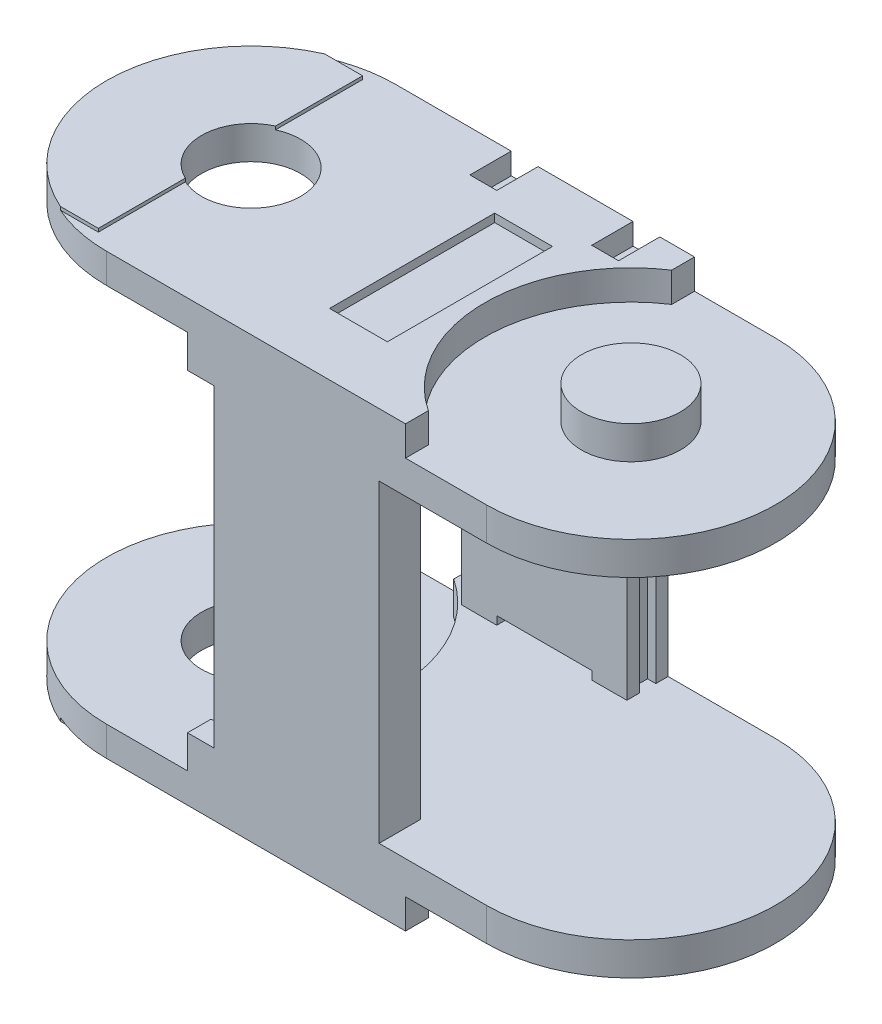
ISO-10303-21;
HEADER;
FILE_DESCRIPTION(('STEP AP214'),'2;1');
FILE_NAME('part.step','',(''),(''),'','','');
FILE_SCHEMA(('AUTOMOTIVE_DESIGN { 1 0 10303 214 1 1 1 1 }'));
ENDSEC;
DATA;
#1=APPLICATION_CONTEXT('core data for automotive mechanical design processes');
#2=APPLICATION_PROTOCOL_DEFINITION('international standard','automotive_design',2000,#1);
#3=PRODUCT_CONTEXT('',#1,'mechanical');
#4=PRODUCT('Part','Part','',(#3));
#5=PRODUCT_RELATED_PRODUCT_CATEGORY('part','',(#4));
#6=PRODUCT_DEFINITION_FORMATION('','',#4);
#7=PRODUCT_DEFINITION_CONTEXT('part definition',#1,'design');
#8=PRODUCT_DEFINITION('design','',#6,#7);
#9=PRODUCT_DEFINITION_SHAPE('','',#8);
#10=(LENGTH_UNIT() NAMED_UNIT(*) SI_UNIT(.MILLI.,.METRE.));
#11=(NAMED_UNIT(*) PLANE_ANGLE_UNIT() SI_UNIT($,.RADIAN.));
#12=(NAMED_UNIT(*) SI_UNIT($,.STERADIAN.) SOLID_ANGLE_UNIT());
#13=UNCERTAINTY_MEASURE_WITH_UNIT(LENGTH_MEASURE(1.E-05),#10,'distance_accuracy_value','');
#14=(GEOMETRIC_REPRESENTATION_CONTEXT(3) GLOBAL_UNCERTAINTY_ASSIGNED_CONTEXT((#13)) GLOBAL_UNIT_ASSIGNED_CONTEXT((#10,
#11,#12)) REPRESENTATION_CONTEXT('',''));
#15=CARTESIAN_POINT('',(0.,0.,0.));
#16=DIRECTION('',(0.,0.,1.));
#17=DIRECTION('',(1.,0.,0.));
#18=AXIS2_PLACEMENT_3D('',#15,#16,#17);
#19=CARTESIAN_POINT('',(-92.,-7.99999999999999,150.));
#20=DIRECTION('',(0.,-1.,0.));
#21=DIRECTION('',(0.,0.,-1.));
#22=AXIS2_PLACEMENT_3D('',#19,#20,#21);
#23=PLANE('',#22);
#24=CARTESIAN_POINT('',(-92.,-7.99999999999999,150.));
#25=DIRECTION('',(0.,1.,0.));
#26=DIRECTION('',(0.,0.,1.));
#27=AXIS2_PLACEMENT_3D('',#24,#25,#26);
#28=CIRCLE('',#27,6.00000000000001);
#29=CARTESIAN_POINT('',(-92.,-7.99999999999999,156.));
#30=VERTEX_POINT('',#29);
#31=EDGE_CURVE('E19',#30,#30,#28,.T.);
#32=ORIENTED_EDGE('',*,*,#31,.F.);
#33=EDGE_LOOP('',(#32));
#34=FACE_BOUND('',#33,.T.);
#35=ADVANCED_FACE('F16',(#34),#23,.T.);
#36=CARTESIAN_POINT('',(-115.,-6.59999999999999,150.));
#37=DIRECTION('',(0.,1.,0.));
#38=DIRECTION('',(0.,0.,1.));
#39=AXIS2_PLACEMENT_3D('',#36,#37,#38);
#40=PLANE('',#39);
#41=DIRECTION('',(0.,0.,-1.));
#42=VECTOR('',#41,1.);
#43=CARTESIAN_POINT('',(-118.5,-6.59999999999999,150.));
#44=LINE('',#43,#42);
#45=CARTESIAN_POINT('',(-118.5,-6.59999999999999,140.));
#46=VERTEX_POINT('',#45);
#47=CARTESIAN_POINT('',(-118.5,-6.59999999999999,160.));
#48=VERTEX_POINT('',#47);
#49=EDGE_CURVE('E1227',#46,#48,#44,.F.);
#50=ORIENTED_EDGE('',*,*,#49,.F.);
#51=DIRECTION('',(1.,0.,0.));
#52=VECTOR('',#51,1.);
#53=CARTESIAN_POINT('',(-115.,-6.59999999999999,140.));
#54=LINE('',#53,#52);
#55=CARTESIAN_POINT('',(-111.5,-6.59999999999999,140.));
#56=VERTEX_POINT('',#55);
#57=EDGE_CURVE('E1232',#56,#46,#54,.F.);
#58=ORIENTED_EDGE('',*,*,#57,.F.);
#59=DIRECTION('',(0.,0.,1.));
#60=VECTOR('',#59,1.);
#61=CARTESIAN_POINT('',(-111.5,-6.59999999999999,150.));
#62=LINE('',#61,#60);
#63=CARTESIAN_POINT('',(-111.5,-6.59999999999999,160.));
#64=VERTEX_POINT('',#63);
#65=EDGE_CURVE('E1211',#64,#56,#62,.F.);
#66=ORIENTED_EDGE('',*,*,#65,.F.);
#67=DIRECTION('',(-1.,0.,0.));
#68=VECTOR('',#67,1.);
#69=CARTESIAN_POINT('',(-115.,-6.59999999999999,160.));
#70=LINE('',#69,#68);
#71=EDGE_CURVE('E1222',#48,#64,#70,.F.);
#72=ORIENTED_EDGE('',*,*,#71,.F.);
#73=EDGE_LOOP('',(#50,#58,#66,#72));
#74=FACE_BOUND('',#73,.T.);
#75=ADVANCED_FACE('F1867',(#74),#40,.F.);
#76=CARTESIAN_POINT('',(-115.,44.6,150.));
#77=DIRECTION('',(0.,-1.,0.));
#78=DIRECTION('',(0.,0.,-1.));
#79=AXIS2_PLACEMENT_3D('',#76,#77,#78);
#80=PLANE('',#79);
#81=DIRECTION('',(0.,0.,-1.));
#82=VECTOR('',#81,1.);
#83=CARTESIAN_POINT('',(-118.5,44.6,150.));
#84=LINE('',#83,#82);
#85=CARTESIAN_POINT('',(-118.5,44.6,160.));
#86=VERTEX_POINT('',#85);
#87=CARTESIAN_POINT('',(-118.5,44.6,140.));
#88=VERTEX_POINT('',#87);
#89=EDGE_CURVE('E1487',#86,#88,#84,.T.);
#90=ORIENTED_EDGE('',*,*,#89,.F.);
#91=DIRECTION('',(-1.,0.,0.));
#92=VECTOR('',#91,1.);
#93=CARTESIAN_POINT('',(-115.,44.6,160.));
#94=LINE('',#93,#92);
#95=CARTESIAN_POINT('',(-111.5,44.6,160.));
#96=VERTEX_POINT('',#95);
#97=EDGE_CURVE('E1481',#96,#86,#94,.T.);
#98=ORIENTED_EDGE('',*,*,#97,.F.);
#99=DIRECTION('',(0.,0.,1.));
#100=VECTOR('',#99,1.);
#101=CARTESIAN_POINT('',(-111.5,44.6,150.));
#102=LINE('',#101,#100);
#103=CARTESIAN_POINT('',(-111.5,44.6,140.));
#104=VERTEX_POINT('',#103);
#105=EDGE_CURVE('E1472',#104,#96,#102,.T.);
#106=ORIENTED_EDGE('',*,*,#105,.F.);
#107=DIRECTION('',(1.,0.,0.));
#108=VECTOR('',#107,1.);
#109=CARTESIAN_POINT('',(-115.,44.6,140.));
#110=LINE('',#109,#108);
#111=EDGE_CURVE('E850',#88,#104,#110,.T.);
#112=ORIENTED_EDGE('',*,*,#111,.F.);
#113=EDGE_LOOP('',(#90,#98,#106,#112));
#114=FACE_BOUND('',#113,.T.);
#115=ADVANCED_FACE('F1864',(#114),#80,.F.);
#116=CARTESIAN_POINT('',(-92.,46.,150.));
#117=DIRECTION('',(0.,1.,0.));
#118=DIRECTION('',(0.,0.,1.));
#119=AXIS2_PLACEMENT_3D('',#116,#117,#118);
#120=PLANE('',#119);
#121=CARTESIAN_POINT('',(-92.,46.,150.));
#122=DIRECTION('',(0.,-1.,0.));
#123=DIRECTION('',(0.,0.,-1.));
#124=AXIS2_PLACEMENT_3D('',#121,#122,#123);
#125=CIRCLE('',#124,6.00000000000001);
#126=CARTESIAN_POINT('',(-92.,46.,144.));
#127=VERTEX_POINT('',#126);
#128=EDGE_CURVE('E1169',#127,#127,#125,.T.);
#129=ORIENTED_EDGE('',*,*,#128,.F.);
#130=EDGE_LOOP('',(#129));
#131=FACE_BOUND('',#130,.T.);
#132=ADVANCED_FACE('F1866',(#131),#120,.T.);
#133=CARTESIAN_POINT('',(-105.,38.,137.49));
#134=DIRECTION('',(1.,0.,0.));
#135=DIRECTION('',(0.,0.,-1.));
#136=AXIS2_PLACEMENT_3D('',#133,#134,#135);
#137=PLANE('',#136);
#138=DIRECTION('',(0.,0.,-1.));
#139=VECTOR('',#138,1.);
#140=CARTESIAN_POINT('',(-105.,0.,137.49));
#141=LINE('',#140,#139);
#142=CARTESIAN_POINT('',(-105.,0.,137.49));
#143=VERTEX_POINT('',#142);
#144=CARTESIAN_POINT('',(-105.,0.,135.99));
#145=VERTEX_POINT('',#144);
#146=EDGE_CURVE('E667',#143,#145,#141,.T.);
#147=ORIENTED_EDGE('',*,*,#146,.T.);
#148=DIRECTION('',(0.,1.,0.));
#149=VECTOR('',#148,1.);
#150=CARTESIAN_POINT('',(-105.,38.,135.99));
#151=LINE('',#150,#149);
#152=CARTESIAN_POINT('',(-105.,38.,135.99));
#153=VERTEX_POINT('',#152);
#154=EDGE_CURVE('E1030',#153,#145,#151,.F.);
#155=ORIENTED_EDGE('',*,*,#154,.F.);
#156=DIRECTION('',(0.,0.,-1.));
#157=VECTOR('',#156,1.);
#158=CARTESIAN_POINT('',(-105.,38.,137.49));
#159=LINE('',#158,#157);
#160=CARTESIAN_POINT('',(-105.,38.,137.49));
#161=VERTEX_POINT('',#160);
#162=EDGE_CURVE('E942',#153,#161,#159,.F.);
#163=ORIENTED_EDGE('',*,*,#162,.T.);
#164=DIRECTION('',(0.,1.,0.));
#165=VECTOR('',#164,1.);
#166=CARTESIAN_POINT('',(-105.,38.,137.49));
#167=LINE('',#166,#165);
#168=EDGE_CURVE('E706',#143,#161,#167,.T.);
#169=ORIENTED_EDGE('',*,*,#168,.F.);
#170=EDGE_LOOP('',(#147,#155,#163,#169));
#171=FACE_BOUND('',#170,.T.);
#172=ADVANCED_FACE('F1874',(#171),#137,.T.);
#173=CARTESIAN_POINT('',(-115.,38.,134.99));
#174=DIRECTION('',(0.,-1.,0.));
#175=DIRECTION('',(0.,0.,-1.));
#176=AXIS2_PLACEMENT_3D('',#173,#174,#175);
#177=PLANE('',#176);
#178=DIRECTION('',(-1.,0.,0.));
#179=VECTOR('',#178,1.);
#180=CARTESIAN_POINT('',(-105.,38.,132.49));
#181=LINE('',#180,#179);
#182=CARTESIAN_POINT('',(-125.,38.,132.49));
#183=VERTEX_POINT('',#182);
#184=CARTESIAN_POINT('',(-124.,38.,132.49));
#185=VERTEX_POINT('',#184);
#186=EDGE_CURVE('E652',#183,#185,#181,.F.);
#187=ORIENTED_EDGE('',*,*,#186,.F.);
#188=DIRECTION('',(0.,0.,1.));
#189=VECTOR('',#188,1.);
#190=CARTESIAN_POINT('',(-125.,38.,132.49));
#191=LINE('',#190,#189);
#192=CARTESIAN_POINT('',(-125.,38.,132.5));
#193=VERTEX_POINT('',#192);
#194=EDGE_CURVE('E657',#193,#183,#191,.F.);
#195=ORIENTED_EDGE('',*,*,#194,.F.);
#196=DIRECTION('',(-1.,0.,0.));
#197=VECTOR('',#196,1.);
#198=CARTESIAN_POINT('',(-92.,38.,132.5));
#199=LINE('',#198,#197);
#200=CARTESIAN_POINT('',(-124.,38.,132.5));
#201=VERTEX_POINT('',#200);
#202=EDGE_CURVE('E995',#201,#193,#199,.T.);
#203=ORIENTED_EDGE('',*,*,#202,.F.);
#204=DIRECTION('',(0.,0.,1.));
#205=VECTOR('',#204,1.);
#206=CARTESIAN_POINT('',(-124.,38.,133.99));
#207=LINE('',#206,#205);
#208=EDGE_CURVE('E663',#185,#201,#207,.T.);
#209=ORIENTED_EDGE('',*,*,#208,.F.);
#210=EDGE_LOOP('',(#187,#195,#203,#209));
#211=FACE_BOUND('',#210,.T.);
#212=ADVANCED_FACE('F2217',(#211),#177,.F.);
#213=CARTESIAN_POINT('',(-124.,38.,133.99));
#214=DIRECTION('',(-1.,0.,0.));
#215=DIRECTION('',(0.,0.,1.));
#216=AXIS2_PLACEMENT_3D('',#213,#214,#215);
#217=PLANE('',#216);
#218=DIRECTION('',(0.,1.,0.));
#219=VECTOR('',#218,1.);
#220=CARTESIAN_POINT('',(-124.,46.,132.5));
#221=LINE('',#220,#219);
#222=CARTESIAN_POINT('',(-124.,43.,132.5));
#223=VERTEX_POINT('',#222);
#224=EDGE_CURVE('E820',#223,#201,#221,.F.);
#225=ORIENTED_EDGE('',*,*,#224,.F.);
#226=DIRECTION('',(0.,0.,-1.));
#227=VECTOR('',#226,1.);
#228=CARTESIAN_POINT('',(-124.,43.,134.99));
#229=LINE('',#228,#227);
#230=CARTESIAN_POINT('',(-124.,43.,132.49));
#231=VERTEX_POINT('',#230);
#232=EDGE_CURVE('E666',#223,#231,#229,.T.);
#233=ORIENTED_EDGE('',*,*,#232,.T.);
#234=DIRECTION('',(0.,1.,0.));
#235=VECTOR('',#234,1.);
#236=CARTESIAN_POINT('',(-124.,38.,132.49));
#237=LINE('',#236,#235);
#238=EDGE_CURVE('E679',#185,#231,#237,.T.);
#239=ORIENTED_EDGE('',*,*,#238,.F.);
#240=ORIENTED_EDGE('',*,*,#208,.T.);
#241=EDGE_LOOP('',(#225,#233,#239,#240));
#242=FACE_BOUND('',#241,.T.);
#243=ADVANCED_FACE('F1825',(#242),#217,.T.);
#244=CARTESIAN_POINT('',(-122.375,43.,134.99));
#245=DIRECTION('',(0.,-1.,0.));
#246=DIRECTION('',(0.,0.,-1.));
#247=AXIS2_PLACEMENT_3D('',#244,#245,#246);
#248=PLANE('',#247);
#249=DIRECTION('',(-1.,0.,0.));
#250=VECTOR('',#249,1.);
#251=CARTESIAN_POINT('',(-105.,43.,132.49));
#252=LINE('',#251,#250);
#253=CARTESIAN_POINT('',(-120.75,43.,132.49));
#254=VERTEX_POINT('',#253);
#255=EDGE_CURVE('E790',#231,#254,#252,.F.);
#256=ORIENTED_EDGE('',*,*,#255,.F.);
#257=ORIENTED_EDGE('',*,*,#232,.F.);
#258=DIRECTION('',(0.,0.,-1.));
#259=VECTOR('',#258,1.);
#260=CARTESIAN_POINT('',(-124.,43.,135.));
#261=LINE('',#260,#259);
#262=CARTESIAN_POINT('',(-124.,43.,137.49));
#263=VERTEX_POINT('',#262);
#264=EDGE_CURVE('E772',#263,#223,#261,.T.);
#265=ORIENTED_EDGE('',*,*,#264,.F.);
#266=DIRECTION('',(1.,0.,0.));
#267=VECTOR('',#266,1.);
#268=CARTESIAN_POINT('',(-125.,43.,137.49));
#269=LINE('',#268,#267);
#270=CARTESIAN_POINT('',(-120.75,43.,137.49));
#271=VERTEX_POINT('',#270);
#272=EDGE_CURVE('E612',#271,#263,#269,.F.);
#273=ORIENTED_EDGE('',*,*,#272,.F.);
#274=DIRECTION('',(0.,0.,1.));
#275=VECTOR('',#274,1.);
#276=CARTESIAN_POINT('',(-120.75,43.,135.));
#277=LINE('',#276,#275);
#278=CARTESIAN_POINT('',(-120.75,43.,132.5));
#279=VERTEX_POINT('',#278);
#280=EDGE_CURVE('E768',#279,#271,#277,.T.);
#281=ORIENTED_EDGE('',*,*,#280,.F.);
#282=DIRECTION('',(0.,0.,1.));
#283=VECTOR('',#282,1.);
#284=CARTESIAN_POINT('',(-120.75,43.,134.99));
#285=LINE('',#284,#283);
#286=EDGE_CURVE('E775',#279,#254,#285,.F.);
#287=ORIENTED_EDGE('',*,*,#286,.T.);
#288=EDGE_LOOP('',(#256,#257,#265,#273,#281,#287));
#289=FACE_BOUND('',#288,.T.);
#290=ADVANCED_FACE('F1822',(#289),#248,.F.);
#291=CARTESIAN_POINT('',(-115.,37.,134.99));
#292=DIRECTION('',(0.,-1.,0.));
#293=DIRECTION('',(0.,0.,-1.));
#294=AXIS2_PLACEMENT_3D('',#291,#292,#293);
#295=PLANE('',#294);
#296=DIRECTION('',(0.,0.,1.));
#297=VECTOR('',#296,1.);
#298=CARTESIAN_POINT('',(-120.75,37.,134.99));
#299=LINE('',#298,#297);
#300=CARTESIAN_POINT('',(-120.75,37.,132.49));
#301=VERTEX_POINT('',#300);
#302=CARTESIAN_POINT('',(-120.75,37.,137.49));
#303=VERTEX_POINT('',#302);
#304=EDGE_CURVE('E777',#301,#303,#299,.T.);
#305=ORIENTED_EDGE('',*,*,#304,.T.);
#306=DIRECTION('',(1.,0.,0.));
#307=VECTOR('',#306,1.);
#308=CARTESIAN_POINT('',(-125.,37.,137.49));
#309=LINE('',#308,#307);
#310=CARTESIAN_POINT('',(-109.25,37.,137.49));
#311=VERTEX_POINT('',#310);
#312=EDGE_CURVE('E609',#311,#303,#309,.F.);
#313=ORIENTED_EDGE('',*,*,#312,.F.);
#314=DIRECTION('',(0.,0.,-1.));
#315=VECTOR('',#314,1.);
#316=CARTESIAN_POINT('',(-109.25,37.,134.99));
#317=LINE('',#316,#315);
#318=CARTESIAN_POINT('',(-109.25,37.,132.49));
#319=VERTEX_POINT('',#318);
#320=EDGE_CURVE('E758',#311,#319,#317,.T.);
#321=ORIENTED_EDGE('',*,*,#320,.T.);
#322=DIRECTION('',(-1.,0.,0.));
#323=VECTOR('',#322,1.);
#324=CARTESIAN_POINT('',(-105.,37.,132.49));
#325=LINE('',#324,#323);
#326=EDGE_CURVE('E789',#301,#319,#325,.F.);
#327=ORIENTED_EDGE('',*,*,#326,.F.);
#328=EDGE_LOOP('',(#305,#313,#321,#327));
#329=FACE_BOUND('',#328,.T.);
#330=ADVANCED_FACE('F2208',(#329),#295,.F.);
#331=CARTESIAN_POINT('',(-107.625,43.,134.99));
#332=DIRECTION('',(0.,-1.,0.));
#333=DIRECTION('',(0.,0.,-1.));
#334=AXIS2_PLACEMENT_3D('',#331,#332,#333);
#335=PLANE('',#334);
#336=DIRECTION('',(-1.,0.,0.));
#337=VECTOR('',#336,1.);
#338=CARTESIAN_POINT('',(-105.,43.,132.49));
#339=LINE('',#338,#337);
#340=CARTESIAN_POINT('',(-109.25,43.,132.49));
#341=VERTEX_POINT('',#340);
#342=CARTESIAN_POINT('',(-106.,43.,132.49));
#343=VERTEX_POINT('',#342);
#344=EDGE_CURVE('E1047',#341,#343,#339,.F.);
#345=ORIENTED_EDGE('',*,*,#344,.F.);
#346=DIRECTION('',(0.,0.,-1.));
#347=VECTOR('',#346,1.);
#348=CARTESIAN_POINT('',(-109.25,43.,134.99));
#349=LINE('',#348,#347);
#350=CARTESIAN_POINT('',(-109.25,43.,132.5));
#351=VERTEX_POINT('',#350);
#352=EDGE_CURVE('E754',#341,#351,#349,.F.);
#353=ORIENTED_EDGE('',*,*,#352,.T.);
#354=DIRECTION('',(0.,0.,-1.));
#355=VECTOR('',#354,1.);
#356=CARTESIAN_POINT('',(-109.25,43.,135.));
#357=LINE('',#356,#355);
#358=CARTESIAN_POINT('',(-109.25,43.,137.49));
#359=VERTEX_POINT('',#358);
#360=EDGE_CURVE('E748',#359,#351,#357,.T.);
#361=ORIENTED_EDGE('',*,*,#360,.F.);
#362=DIRECTION('',(1.,0.,0.));
#363=VECTOR('',#362,1.);
#364=CARTESIAN_POINT('',(-125.,43.,137.49));
#365=LINE('',#364,#363);
#366=CARTESIAN_POINT('',(-106.,43.,137.49));
#367=VERTEX_POINT('',#366);
#368=EDGE_CURVE('E613',#367,#359,#365,.F.);
#369=ORIENTED_EDGE('',*,*,#368,.F.);
#370=DIRECTION('',(0.,0.,1.));
#371=VECTOR('',#370,1.);
#372=CARTESIAN_POINT('',(-106.,43.,135.));
#373=LINE('',#372,#371);
#374=CARTESIAN_POINT('',(-106.,43.,132.5));
#375=VERTEX_POINT('',#374);
#376=EDGE_CURVE('E750',#375,#367,#373,.T.);
#377=ORIENTED_EDGE('',*,*,#376,.F.);
#378=DIRECTION('',(0.,0.,-1.));
#379=VECTOR('',#378,1.);
#380=CARTESIAN_POINT('',(-106.,43.,135.99));
#381=LINE('',#380,#379);
#382=EDGE_CURVE('E839',#343,#375,#381,.F.);
#383=ORIENTED_EDGE('',*,*,#382,.F.);
#384=EDGE_LOOP('',(#345,#353,#361,#369,#377,#383));
#385=FACE_BOUND('',#384,.T.);
#386=ADVANCED_FACE('F2204',(#385),#335,.F.);
#387=CARTESIAN_POINT('',(-106.,38.,135.99));
#388=DIRECTION('',(1.,0.,0.));
#389=DIRECTION('',(0.,0.,-1.));
#390=AXIS2_PLACEMENT_3D('',#387,#388,#389);
#391=PLANE('',#390);
#392=DIRECTION('',(0.,1.,0.));
#393=VECTOR('',#392,1.);
#394=CARTESIAN_POINT('',(-106.,46.,132.5));
#395=LINE('',#394,#393);
#396=CARTESIAN_POINT('',(-106.,38.,132.5));
#397=VERTEX_POINT('',#396);
#398=EDGE_CURVE('E832',#397,#375,#395,.T.);
#399=ORIENTED_EDGE('',*,*,#398,.F.);
#400=DIRECTION('',(0.,0.,-1.));
#401=VECTOR('',#400,1.);
#402=CARTESIAN_POINT('',(-106.,38.,134.99));
#403=LINE('',#402,#401);
#404=CARTESIAN_POINT('',(-106.,38.,132.49));
#405=VERTEX_POINT('',#404);
#406=EDGE_CURVE('E842',#397,#405,#403,.T.);
#407=ORIENTED_EDGE('',*,*,#406,.T.);
#408=DIRECTION('',(0.,1.,0.));
#409=VECTOR('',#408,1.);
#410=CARTESIAN_POINT('',(-106.,38.,132.49));
#411=LINE('',#410,#409);
#412=EDGE_CURVE('E1024',#343,#405,#411,.F.);
#413=ORIENTED_EDGE('',*,*,#412,.F.);
#414=ORIENTED_EDGE('',*,*,#382,.T.);
#415=EDGE_LOOP('',(#399,#407,#413,#414));
#416=FACE_BOUND('',#415,.T.);
#417=ADVANCED_FACE('F2200',(#416),#391,.T.);
#418=CARTESIAN_POINT('',(-115.,38.,134.99));
#419=DIRECTION('',(0.,-1.,0.));
#420=DIRECTION('',(0.,0.,-1.));
#421=AXIS2_PLACEMENT_3D('',#418,#419,#420);
#422=PLANE('',#421);
#423=DIRECTION('',(-1.,0.,0.));
#424=VECTOR('',#423,1.);
#425=CARTESIAN_POINT('',(-105.,38.,132.49));
#426=LINE('',#425,#424);
#427=CARTESIAN_POINT('',(-105.,38.,132.49));
#428=VERTEX_POINT('',#427);
#429=EDGE_CURVE('E740',#405,#428,#426,.F.);
#430=ORIENTED_EDGE('',*,*,#429,.F.);
#431=ORIENTED_EDGE('',*,*,#406,.F.);
#432=DIRECTION('',(-1.,0.,0.));
#433=VECTOR('',#432,1.);
#434=CARTESIAN_POINT('',(-92.,38.,132.5));
#435=LINE('',#434,#433);
#436=CARTESIAN_POINT('',(-105.,38.,132.5));
#437=VERTEX_POINT('',#436);
#438=EDGE_CURVE('E836',#437,#397,#435,.T.);
#439=ORIENTED_EDGE('',*,*,#438,.F.);
#440=DIRECTION('',(0.,0.,-1.));
#441=VECTOR('',#440,1.);
#442=CARTESIAN_POINT('',(-105.,38.,133.99));
#443=LINE('',#442,#441);
#444=EDGE_CURVE('E662',#428,#437,#443,.F.);
#445=ORIENTED_EDGE('',*,*,#444,.F.);
#446=EDGE_LOOP('',(#430,#431,#439,#445));
#447=FACE_BOUND('',#446,.T.);
#448=ADVANCED_FACE('F2196',(#447),#422,.F.);
#449=CARTESIAN_POINT('',(-105.,38.,133.99));
#450=DIRECTION('',(1.,0.,0.));
#451=DIRECTION('',(0.,0.,-1.));
#452=AXIS2_PLACEMENT_3D('',#449,#450,#451);
#453=PLANE('',#452);
#454=DIRECTION('',(0.,1.,0.));
#455=VECTOR('',#454,1.);
#456=CARTESIAN_POINT('',(-105.,38.,132.49));
#457=LINE('',#456,#455);
#458=CARTESIAN_POINT('',(-105.,0.,132.49));
#459=VERTEX_POINT('',#458);
#460=EDGE_CURVE('E730',#428,#459,#457,.F.);
#461=ORIENTED_EDGE('',*,*,#460,.F.);
#462=ORIENTED_EDGE('',*,*,#444,.T.);
#463=DIRECTION('',(0.,0.,-1.));
#464=VECTOR('',#463,1.);
#465=CARTESIAN_POINT('',(-105.,38.,133.99));
#466=LINE('',#465,#464);
#467=CARTESIAN_POINT('',(-105.,38.,133.99));
#468=VERTEX_POINT('',#467);
#469=EDGE_CURVE('E735',#437,#468,#466,.F.);
#470=ORIENTED_EDGE('',*,*,#469,.T.);
#471=DIRECTION('',(0.,1.,0.));
#472=VECTOR('',#471,1.);
#473=CARTESIAN_POINT('',(-105.,38.,133.99));
#474=LINE('',#473,#472);
#475=CARTESIAN_POINT('',(-105.,0.,133.99));
#476=VERTEX_POINT('',#475);
#477=EDGE_CURVE('E1027',#476,#468,#474,.T.);
#478=ORIENTED_EDGE('',*,*,#477,.F.);
#479=DIRECTION('',(0.,0.,-1.));
#480=VECTOR('',#479,1.);
#481=CARTESIAN_POINT('',(-105.,0.,133.99));
#482=LINE('',#481,#480);
#483=CARTESIAN_POINT('',(-105.,0.,132.5));
#484=VERTEX_POINT('',#483);
#485=EDGE_CURVE('E733',#476,#484,#482,.T.);
#486=ORIENTED_EDGE('',*,*,#485,.T.);
#487=DIRECTION('',(0.,0.,-1.));
#488=VECTOR('',#487,1.);
#489=CARTESIAN_POINT('',(-105.,0.,134.99));
#490=LINE('',#489,#488);
#491=EDGE_CURVE('E1400',#459,#484,#490,.F.);
#492=ORIENTED_EDGE('',*,*,#491,.F.);
#493=EDGE_LOOP('',(#461,#462,#470,#478,#486,#492));
#494=FACE_BOUND('',#493,.T.);
#495=ADVANCED_FACE('F2192',(#494),#453,.T.);
#496=CARTESIAN_POINT('',(-107.625,-4.99999999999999,134.99));
#497=DIRECTION('',(0.,1.,0.));
#498=DIRECTION('',(0.,0.,1.));
#499=AXIS2_PLACEMENT_3D('',#496,#497,#498);
#500=PLANE('',#499);
#501=DIRECTION('',(-1.,0.,0.));
#502=VECTOR('',#501,1.);
#503=CARTESIAN_POINT('',(-105.,-4.99999999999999,132.49));
#504=LINE('',#503,#502);
#505=CARTESIAN_POINT('',(-106.,-4.99999999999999,132.49));
#506=VERTEX_POINT('',#505);
#507=CARTESIAN_POINT('',(-109.25,-4.99999999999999,132.49));
#508=VERTEX_POINT('',#507);
#509=EDGE_CURVE('E724',#506,#508,#504,.T.);
#510=ORIENTED_EDGE('',*,*,#509,.F.);
#511=DIRECTION('',(0.,0.,-1.));
#512=VECTOR('',#511,1.);
#513=CARTESIAN_POINT('',(-106.,-4.99999999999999,135.99));
#514=LINE('',#513,#512);
#515=CARTESIAN_POINT('',(-106.,-4.99999999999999,132.5));
#516=VERTEX_POINT('',#515);
#517=EDGE_CURVE('E1237',#516,#506,#514,.T.);
#518=ORIENTED_EDGE('',*,*,#517,.F.);
#519=DIRECTION('',(0.,0.,1.));
#520=VECTOR('',#519,1.);
#521=CARTESIAN_POINT('',(-106.,-4.99999999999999,135.));
#522=LINE('',#521,#520);
#523=CARTESIAN_POINT('',(-106.,-4.99999999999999,137.49));
#524=VERTEX_POINT('',#523);
#525=EDGE_CURVE('E696',#524,#516,#522,.F.);
#526=ORIENTED_EDGE('',*,*,#525,.F.);
#527=DIRECTION('',(1.,0.,0.));
#528=VECTOR('',#527,1.);
#529=CARTESIAN_POINT('',(-125.,-4.99999999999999,137.49));
#530=LINE('',#529,#528);
#531=CARTESIAN_POINT('',(-109.25,-4.99999999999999,137.49));
#532=VERTEX_POINT('',#531);
#533=EDGE_CURVE('E616',#532,#524,#530,.T.);
#534=ORIENTED_EDGE('',*,*,#533,.F.);
#535=DIRECTION('',(0.,0.,-1.));
#536=VECTOR('',#535,1.);
#537=CARTESIAN_POINT('',(-109.25,-4.99999999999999,135.));
#538=LINE('',#537,#536);
#539=CARTESIAN_POINT('',(-109.25,-4.99999999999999,132.5));
#540=VERTEX_POINT('',#539);
#541=EDGE_CURVE('E953',#540,#532,#538,.F.);
#542=ORIENTED_EDGE('',*,*,#541,.F.);
#543=DIRECTION('',(0.,0.,1.));
#544=VECTOR('',#543,1.);
#545=CARTESIAN_POINT('',(-109.25,-4.99999999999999,134.99));
#546=LINE('',#545,#544);
#547=EDGE_CURVE('E659',#508,#540,#546,.T.);
#548=ORIENTED_EDGE('',*,*,#547,.F.);
#549=EDGE_LOOP('',(#510,#518,#526,#534,#542,#548));
#550=FACE_BOUND('',#549,.T.);
#551=ADVANCED_FACE('F2188',(#550),#500,.F.);
#552=CARTESIAN_POINT('',(-125.,38.,135.99));
#553=DIRECTION('',(-1.,0.,0.));
#554=DIRECTION('',(0.,0.,1.));
#555=AXIS2_PLACEMENT_3D('',#552,#553,#554);
#556=PLANE('',#555);
#557=DIRECTION('',(0.,0.,1.));
#558=VECTOR('',#557,1.);
#559=CARTESIAN_POINT('',(-125.,0.,135.99));
#560=LINE('',#559,#558);
#561=CARTESIAN_POINT('',(-125.,0.,135.99));
#562=VERTEX_POINT('',#561);
#563=CARTESIAN_POINT('',(-125.,0.,137.49));
#564=VERTEX_POINT('',#563);
#565=EDGE_CURVE('E655',#562,#564,#560,.T.);
#566=ORIENTED_EDGE('',*,*,#565,.T.);
#567=DIRECTION('',(0.,1.,0.));
#568=VECTOR('',#567,1.);
#569=CARTESIAN_POINT('',(-125.,38.,137.49));
#570=LINE('',#569,#568);
#571=CARTESIAN_POINT('',(-125.,38.,137.49));
#572=VERTEX_POINT('',#571);
#573=EDGE_CURVE('E608',#572,#564,#570,.F.);
#574=ORIENTED_EDGE('',*,*,#573,.F.);
#575=DIRECTION('',(0.,0.,1.));
#576=VECTOR('',#575,1.);
#577=CARTESIAN_POINT('',(-125.,38.,135.99));
#578=LINE('',#577,#576);
#579=CARTESIAN_POINT('',(-125.,38.,135.99));
#580=VERTEX_POINT('',#579);
#581=EDGE_CURVE('E658',#572,#580,#578,.F.);
#582=ORIENTED_EDGE('',*,*,#581,.T.);
#583=DIRECTION('',(0.,1.,0.));
#584=VECTOR('',#583,1.);
#585=CARTESIAN_POINT('',(-125.,38.,135.99));
#586=LINE('',#585,#584);
#587=EDGE_CURVE('E992',#562,#580,#586,.T.);
#588=ORIENTED_EDGE('',*,*,#587,.F.);
#589=EDGE_LOOP('',(#566,#574,#582,#588));
#590=FACE_BOUND('',#589,.T.);
#591=ADVANCED_FACE('F2185',(#590),#556,.T.);
#592=CARTESIAN_POINT('',(-125.,38.,132.49));
#593=DIRECTION('',(-1.,0.,0.));
#594=DIRECTION('',(0.,0.,1.));
#595=AXIS2_PLACEMENT_3D('',#592,#593,#594);
#596=PLANE('',#595);
#597=DIRECTION('',(0.,1.,0.));
#598=VECTOR('',#597,1.);
#599=CARTESIAN_POINT('',(-125.,38.,133.99));
#600=LINE('',#599,#598);
#601=CARTESIAN_POINT('',(-125.,38.,133.99));
#602=VERTEX_POINT('',#601);
#603=CARTESIAN_POINT('',(-125.,0.,133.99));
#604=VERTEX_POINT('',#603);
#605=EDGE_CURVE('E987',#602,#604,#600,.F.);
#606=ORIENTED_EDGE('',*,*,#605,.F.);
#607=DIRECTION('',(0.,0.,1.));
#608=VECTOR('',#607,1.);
#609=CARTESIAN_POINT('',(-125.,38.,132.49));
#610=LINE('',#609,#608);
#611=EDGE_CURVE('E683',#602,#193,#610,.F.);
#612=ORIENTED_EDGE('',*,*,#611,.T.);
#613=ORIENTED_EDGE('',*,*,#194,.T.);
#614=DIRECTION('',(0.,1.,0.));
#615=VECTOR('',#614,1.);
#616=CARTESIAN_POINT('',(-125.,38.,132.49));
#617=LINE('',#616,#615);
#618=CARTESIAN_POINT('',(-125.,0.,132.49));
#619=VERTEX_POINT('',#618);
#620=EDGE_CURVE('E646',#619,#183,#617,.T.);
#621=ORIENTED_EDGE('',*,*,#620,.F.);
#622=DIRECTION('',(0.,0.,1.));
#623=VECTOR('',#622,1.);
#624=CARTESIAN_POINT('',(-125.,0.,132.49));
#625=LINE('',#624,#623);
#626=CARTESIAN_POINT('',(-125.,0.,132.5));
#627=VERTEX_POINT('',#626);
#628=EDGE_CURVE('E668',#619,#627,#625,.T.);
#629=ORIENTED_EDGE('',*,*,#628,.T.);
#630=DIRECTION('',(0.,0.,1.));
#631=VECTOR('',#630,1.);
#632=CARTESIAN_POINT('',(-125.,0.,132.49));
#633=LINE('',#632,#631);
#634=EDGE_CURVE('E671',#627,#604,#633,.T.);
#635=ORIENTED_EDGE('',*,*,#634,.T.);
#636=EDGE_LOOP('',(#606,#612,#613,#621,#629,#635));
#637=FACE_BOUND('',#636,.T.);
#638=ADVANCED_FACE('F1831',(#637),#596,.T.);
#639=CARTESIAN_POINT('',(-122.375,-4.99999999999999,134.99));
#640=DIRECTION('',(0.,1.,0.));
#641=DIRECTION('',(0.,0.,1.));
#642=AXIS2_PLACEMENT_3D('',#639,#640,#641);
#643=PLANE('',#642);
#644=DIRECTION('',(-1.,0.,0.));
#645=VECTOR('',#644,1.);
#646=CARTESIAN_POINT('',(-105.,-4.99999999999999,132.49));
#647=LINE('',#646,#645);
#648=CARTESIAN_POINT('',(-120.75,-4.99999999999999,132.49));
#649=VERTEX_POINT('',#648);
#650=CARTESIAN_POINT('',(-124.,-4.99999999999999,132.49));
#651=VERTEX_POINT('',#650);
#652=EDGE_CURVE('E644',#649,#651,#647,.T.);
#653=ORIENTED_EDGE('',*,*,#652,.F.);
#654=DIRECTION('',(0.,0.,1.));
#655=VECTOR('',#654,1.);
#656=CARTESIAN_POINT('',(-120.75,-4.99999999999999,134.99));
#657=LINE('',#656,#655);
#658=CARTESIAN_POINT('',(-120.75,-4.99999999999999,132.5));
#659=VERTEX_POINT('',#658);
#660=EDGE_CURVE('E629',#659,#649,#657,.F.);
#661=ORIENTED_EDGE('',*,*,#660,.F.);
#662=DIRECTION('',(0.,0.,1.));
#663=VECTOR('',#662,1.);
#664=CARTESIAN_POINT('',(-120.75,-4.99999999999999,135.));
#665=LINE('',#664,#663);
#666=CARTESIAN_POINT('',(-120.75,-4.99999999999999,137.49));
#667=VERTEX_POINT('',#666);
#668=EDGE_CURVE('E960',#667,#659,#665,.F.);
#669=ORIENTED_EDGE('',*,*,#668,.F.);
#670=DIRECTION('',(1.,0.,0.));
#671=VECTOR('',#670,1.);
#672=CARTESIAN_POINT('',(-125.,-4.99999999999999,137.49));
#673=LINE('',#672,#671);
#674=CARTESIAN_POINT('',(-124.,-4.99999999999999,137.49));
#675=VERTEX_POINT('',#674);
#676=EDGE_CURVE('E620',#675,#667,#673,.T.);
#677=ORIENTED_EDGE('',*,*,#676,.F.);
#678=DIRECTION('',(0.,0.,-1.));
#679=VECTOR('',#678,1.);
#680=CARTESIAN_POINT('',(-124.,-4.99999999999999,135.));
#681=LINE('',#680,#679);
#682=CARTESIAN_POINT('',(-124.,-4.99999999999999,132.5));
#683=VERTEX_POINT('',#682);
#684=EDGE_CURVE('E625',#683,#675,#681,.F.);
#685=ORIENTED_EDGE('',*,*,#684,.F.);
#686=DIRECTION('',(0.,0.,1.));
#687=VECTOR('',#686,1.);
#688=CARTESIAN_POINT('',(-124.,-4.99999999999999,133.99));
#689=LINE('',#688,#687);
#690=EDGE_CURVE('E641',#651,#683,#689,.T.);
#691=ORIENTED_EDGE('',*,*,#690,.F.);
#692=EDGE_LOOP('',(#653,#661,#669,#677,#685,#691));
#693=FACE_BOUND('',#692,.T.);
#694=ADVANCED_FACE('F2179',(#693),#643,.F.);
#695=CARTESIAN_POINT('',(-125.,38.,137.49));
#696=DIRECTION('',(0.,0.,1.));
#697=DIRECTION('',(1.,0.,0.));
#698=AXIS2_PLACEMENT_3D('',#695,#696,#697);
#699=PLANE('',#698);
#700=ORIENTED_EDGE('',*,*,#573,.T.);
#701=DIRECTION('',(1.,0.,0.));
#702=VECTOR('',#701,1.);
#703=CARTESIAN_POINT('',(-125.,0.,137.49));
#704=LINE('',#703,#702);
#705=CARTESIAN_POINT('',(-124.,0.,137.49));
#706=VERTEX_POINT('',#705);
#707=EDGE_CURVE('E606',#564,#706,#704,.T.);
#708=ORIENTED_EDGE('',*,*,#707,.T.);
#709=DIRECTION('',(0.,1.,0.));
#710=VECTOR('',#709,1.);
#711=CARTESIAN_POINT('',(-124.,-4.,137.49));
#712=LINE('',#711,#710);
#713=EDGE_CURVE('E621',#675,#706,#712,.T.);
#714=ORIENTED_EDGE('',*,*,#713,.F.);
#715=ORIENTED_EDGE('',*,*,#676,.T.);
#716=DIRECTION('',(0.,1.,0.));
#717=VECTOR('',#716,1.);
#718=CARTESIAN_POINT('',(-120.75,-4.,137.49));
#719=LINE('',#718,#717);
#720=CARTESIAN_POINT('',(-120.75,0.,137.49));
#721=VERTEX_POINT('',#720);
#722=EDGE_CURVE('E964',#721,#667,#719,.F.);
#723=ORIENTED_EDGE('',*,*,#722,.F.);
#724=DIRECTION('',(0.,1.,0.));
#725=VECTOR('',#724,1.);
#726=CARTESIAN_POINT('',(-120.75,38.,137.49));
#727=LINE('',#726,#725);
#728=CARTESIAN_POINT('',(-120.75,1.00000000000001,137.49));
#729=VERTEX_POINT('',#728);
#730=EDGE_CURVE('E617',#721,#729,#727,.T.);
#731=ORIENTED_EDGE('',*,*,#730,.T.);
#732=DIRECTION('',(1.,0.,0.));
#733=VECTOR('',#732,1.);
#734=CARTESIAN_POINT('',(-115.,1.00000000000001,137.49));
#735=LINE('',#734,#733);
#736=CARTESIAN_POINT('',(-109.25,1.00000000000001,137.49));
#737=VERTEX_POINT('',#736);
#738=EDGE_CURVE('E1383',#737,#729,#735,.F.);
#739=ORIENTED_EDGE('',*,*,#738,.F.);
#740=DIRECTION('',(0.,1.,0.));
#741=VECTOR('',#740,1.);
#742=CARTESIAN_POINT('',(-109.25,38.,137.49));
#743=LINE('',#742,#741);
#744=CARTESIAN_POINT('',(-109.25,0.,137.49));
#745=VERTEX_POINT('',#744);
#746=EDGE_CURVE('E614',#737,#745,#743,.F.);
#747=ORIENTED_EDGE('',*,*,#746,.T.);
#748=DIRECTION('',(0.,1.,0.));
#749=VECTOR('',#748,1.);
#750=CARTESIAN_POINT('',(-109.25,-4.,137.49));
#751=LINE('',#750,#749);
#752=EDGE_CURVE('E949',#532,#745,#751,.T.);
#753=ORIENTED_EDGE('',*,*,#752,.F.);
#754=ORIENTED_EDGE('',*,*,#533,.T.);
#755=DIRECTION('',(0.,1.,0.));
#756=VECTOR('',#755,1.);
#757=CARTESIAN_POINT('',(-106.,-4.,137.49));
#758=LINE('',#757,#756);
#759=CARTESIAN_POINT('',(-106.,0.,137.49));
#760=VERTEX_POINT('',#759);
#761=EDGE_CURVE('E693',#760,#524,#758,.F.);
#762=ORIENTED_EDGE('',*,*,#761,.F.);
#763=DIRECTION('',(1.,0.,0.));
#764=VECTOR('',#763,1.);
#765=CARTESIAN_POINT('',(-125.,0.,137.49));
#766=LINE('',#765,#764);
#767=EDGE_CURVE('E701',#760,#143,#766,.T.);
#768=ORIENTED_EDGE('',*,*,#767,.T.);
#769=ORIENTED_EDGE('',*,*,#168,.T.);
#770=DIRECTION('',(1.,0.,0.));
#771=VECTOR('',#770,1.);
#772=CARTESIAN_POINT('',(-125.,38.,137.49));
#773=LINE('',#772,#771);
#774=CARTESIAN_POINT('',(-106.,38.,137.49));
#775=VERTEX_POINT('',#774);
#776=EDGE_CURVE('E868',#161,#775,#773,.F.);
#777=ORIENTED_EDGE('',*,*,#776,.T.);
#778=DIRECTION('',(0.,1.,0.));
#779=VECTOR('',#778,1.);
#780=CARTESIAN_POINT('',(-106.,42.,137.49));
#781=LINE('',#780,#779);
#782=EDGE_CURVE('E829',#367,#775,#781,.F.);
#783=ORIENTED_EDGE('',*,*,#782,.F.);
#784=ORIENTED_EDGE('',*,*,#368,.T.);
#785=DIRECTION('',(0.,1.,0.));
#786=VECTOR('',#785,1.);
#787=CARTESIAN_POINT('',(-109.25,42.,137.49));
#788=LINE('',#787,#786);
#789=CARTESIAN_POINT('',(-109.25,38.,137.49));
#790=VERTEX_POINT('',#789);
#791=EDGE_CURVE('E751',#790,#359,#788,.T.);
#792=ORIENTED_EDGE('',*,*,#791,.F.);
#793=DIRECTION('',(0.,1.,0.));
#794=VECTOR('',#793,1.);
#795=CARTESIAN_POINT('',(-109.25,40.5,137.49));
#796=LINE('',#795,#794);
#797=EDGE_CURVE('E764',#790,#311,#796,.F.);
#798=ORIENTED_EDGE('',*,*,#797,.T.);
#799=ORIENTED_EDGE('',*,*,#312,.T.);
#800=DIRECTION('',(0.,1.,0.));
#801=VECTOR('',#800,1.);
#802=CARTESIAN_POINT('',(-120.75,40.5,137.49));
#803=LINE('',#802,#801);
#804=CARTESIAN_POINT('',(-120.75,38.,137.49));
#805=VERTEX_POINT('',#804);
#806=EDGE_CURVE('E894',#303,#805,#803,.T.);
#807=ORIENTED_EDGE('',*,*,#806,.T.);
#808=DIRECTION('',(0.,1.,0.));
#809=VECTOR('',#808,1.);
#810=CARTESIAN_POINT('',(-120.75,42.,137.49));
#811=LINE('',#810,#809);
#812=EDGE_CURVE('E771',#271,#805,#811,.F.);
#813=ORIENTED_EDGE('',*,*,#812,.F.);
#814=ORIENTED_EDGE('',*,*,#272,.T.);
#815=DIRECTION('',(0.,1.,0.));
#816=VECTOR('',#815,1.);
#817=CARTESIAN_POINT('',(-124.,42.,137.49));
#818=LINE('',#817,#816);
#819=CARTESIAN_POINT('',(-124.,38.,137.49));
#820=VERTEX_POINT('',#819);
#821=EDGE_CURVE('E812',#820,#263,#818,.T.);
#822=ORIENTED_EDGE('',*,*,#821,.F.);
#823=DIRECTION('',(1.,0.,0.));
#824=VECTOR('',#823,1.);
#825=CARTESIAN_POINT('',(-125.,38.,137.49));
#826=LINE('',#825,#824);
#827=EDGE_CURVE('E905',#820,#572,#826,.F.);
#828=ORIENTED_EDGE('',*,*,#827,.T.);
#829=EDGE_LOOP('',(#700,#708,#714,#715,#723,#731,#739,#747,#753,#754,#762,#768,#769,#777,#783,
#784,#792,#798,#799,#807,#813,#814,#822,#828));
#830=FACE_BOUND('',#829,.T.);
#831=ADVANCED_FACE('F1818',(#830),#699,.T.);
#832=CARTESIAN_POINT('',(-92.,-5.99999999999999,150.));
#833=DIRECTION('',(0.,1.,0.));
#834=DIRECTION('',(0.,0.,1.));
#835=AXIS2_PLACEMENT_3D('',#832,#833,#834);
#836=CYLINDRICAL_SURFACE('',#835,6.00000000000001);
#837=ORIENTED_EDGE('',*,*,#31,.T.);
#838=EDGE_LOOP('',(#837));
#839=FACE_BOUND('',#838,.T.);
#840=CARTESIAN_POINT('',(-92.,-3.99999999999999,150.));
#841=DIRECTION('',(0.,1.,0.));
#842=DIRECTION('',(0.,0.,1.));
#843=AXIS2_PLACEMENT_3D('',#840,#841,#842);
#844=CIRCLE('',#843,6.00000000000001);
#845=CARTESIAN_POINT('',(-92.,-3.99999999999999,156.));
#846=VERTEX_POINT('',#845);
#847=EDGE_CURVE('E1163',#846,#846,#844,.F.);
#848=ORIENTED_EDGE('',*,*,#847,.T.);
#849=EDGE_LOOP('',(#848));
#850=FACE_BOUND('',#849,.T.);
#851=ADVANCED_FACE('F2172',(#839,#850),#836,.T.);
#852=CARTESIAN_POINT('',(-92.,-5.99999999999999,150.));
#853=DIRECTION('',(0.,1.,0.));
#854=DIRECTION('',(0.,0.,1.));
#855=AXIS2_PLACEMENT_3D('',#852,#853,#854);
#856=CYLINDRICAL_SURFACE('',#855,17.7);
#857=DIRECTION('',(0.,1.,0.));
#858=VECTOR('',#857,1.);
#859=CARTESIAN_POINT('',(-101.8,-5.99999999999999,164.739402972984));
#860=LINE('',#859,#858);
#861=CARTESIAN_POINT('',(-101.8,-7.59999999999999,164.739402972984));
#862=VERTEX_POINT('',#861);
#863=CARTESIAN_POINT('',(-101.8,-3.99999999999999,164.739402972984));
#864=VERTEX_POINT('',#863);
#865=EDGE_CURVE('E601',#862,#864,#860,.T.);
#866=ORIENTED_EDGE('',*,*,#865,.F.);
#867=CARTESIAN_POINT('',(-92.,-7.59999999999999,150.));
#868=DIRECTION('',(0.,1.,0.));
#869=DIRECTION('',(0.,0.,1.));
#870=AXIS2_PLACEMENT_3D('',#867,#868,#869);
#871=CIRCLE('',#870,17.7);
#872=CARTESIAN_POINT('',(-101.8,-7.59999999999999,135.260597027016));
#873=VERTEX_POINT('',#872);
#874=EDGE_CURVE('E604',#873,#862,#871,.T.);
#875=ORIENTED_EDGE('',*,*,#874,.F.);
#876=DIRECTION('',(0.,1.,0.));
#877=VECTOR('',#876,1.);
#878=CARTESIAN_POINT('',(-101.8,-5.99999999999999,135.260597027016));
#879=LINE('',#878,#877);
#880=CARTESIAN_POINT('',(-101.8,-3.99999999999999,135.260597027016));
#881=VERTEX_POINT('',#880);
#882=EDGE_CURVE('E757',#881,#873,#879,.F.);
#883=ORIENTED_EDGE('',*,*,#882,.F.);
#884=CARTESIAN_POINT('',(-92.,-3.99999999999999,150.));
#885=DIRECTION('',(0.,1.,0.));
#886=DIRECTION('',(0.,0.,1.));
#887=AXIS2_PLACEMENT_3D('',#884,#885,#886);
#888=CIRCLE('',#887,17.7);
#889=EDGE_CURVE('E1167',#881,#864,#888,.T.);
#890=ORIENTED_EDGE('',*,*,#889,.T.);
#891=EDGE_LOOP('',(#866,#875,#883,#890));
#892=FACE_BOUND('',#891,.T.);
#893=ADVANCED_FACE('F2168',(#892),#856,.F.);
#894=CARTESIAN_POINT('',(-135.25,-7.79999999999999,166.));
#895=DIRECTION('',(0.,0.,1.));
#896=DIRECTION('',(1.,0.,0.));
#897=AXIS2_PLACEMENT_3D('',#894,#895,#896);
#898=PLANE('',#897);
#899=DIRECTION('',(0.,1.,0.));
#900=VECTOR('',#899,1.);
#901=CARTESIAN_POINT('',(-145.088723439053,-7.79999999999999,166.));
#902=LINE('',#901,#900);
#903=CARTESIAN_POINT('',(-145.088723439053,-7.59999999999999,166.));
#904=VERTEX_POINT('',#903);
#905=CARTESIAN_POINT('',(-145.088723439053,-7.99999999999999,166.));
#906=VERTEX_POINT('',#905);
#907=EDGE_CURVE('E597',#904,#906,#902,.F.);
#908=ORIENTED_EDGE('',*,*,#907,.T.);
#909=DIRECTION('',(1.,0.,0.));
#910=VECTOR('',#909,1.);
#911=CARTESIAN_POINT('',(-114.999999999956,-7.99999999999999,166.));
#912=LINE('',#911,#910);
#913=CARTESIAN_POINT('',(-140.5,-7.99999999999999,166.));
#914=VERTEX_POINT('',#913);
#915=EDGE_CURVE('E577',#906,#914,#912,.T.);
#916=ORIENTED_EDGE('',*,*,#915,.T.);
#917=DIRECTION('',(0.,1.,0.));
#918=VECTOR('',#917,1.);
#919=CARTESIAN_POINT('',(-140.5,-7.79999999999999,166.));
#920=LINE('',#919,#918);
#921=CARTESIAN_POINT('',(-140.5,-7.59999999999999,166.));
#922=VERTEX_POINT('',#921);
#923=EDGE_CURVE('E573',#922,#914,#920,.F.);
#924=ORIENTED_EDGE('',*,*,#923,.F.);
#925=DIRECTION('',(1.,0.,0.));
#926=VECTOR('',#925,1.);
#927=CARTESIAN_POINT('',(-115.,-7.59999999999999,166.));
#928=LINE('',#927,#926);
#929=EDGE_CURVE('E1292',#904,#922,#928,.T.);
#930=ORIENTED_EDGE('',*,*,#929,.F.);
#931=EDGE_LOOP('',(#908,#916,#924,#930));
#932=FACE_BOUND('',#931,.T.);
#933=ADVANCED_FACE('F2165',(#932),#898,.T.);
#934=CARTESIAN_POINT('',(-140.5,-7.79999999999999,150.));
#935=DIRECTION('',(1.,0.,0.));
#936=DIRECTION('',(0.,0.,-1.));
#937=AXIS2_PLACEMENT_3D('',#934,#935,#936);
#938=PLANE('',#937);
#939=ORIENTED_EDGE('',*,*,#923,.T.);
#940=DIRECTION('',(0.,0.,1.));
#941=VECTOR('',#940,1.);
#942=CARTESIAN_POINT('',(-140.5,-7.99999999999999,149.999999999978));
#943=LINE('',#942,#941);
#944=CARTESIAN_POINT('',(-140.5,-7.99999999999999,155.454356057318));
#945=VERTEX_POINT('',#944);
#946=EDGE_CURVE('E566',#914,#945,#943,.F.);
#947=ORIENTED_EDGE('',*,*,#946,.T.);
#948=DIRECTION('',(0.,-1.,0.));
#949=VECTOR('',#948,1.);
#950=CARTESIAN_POINT('',(-140.5,-3.99999999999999,155.454356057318));
#951=LINE('',#950,#949);
#952=CARTESIAN_POINT('',(-140.5,-7.59999999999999,155.454356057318));
#953=VERTEX_POINT('',#952);
#954=EDGE_CURVE('E571',#945,#953,#951,.F.);
#955=ORIENTED_EDGE('',*,*,#954,.T.);
#956=DIRECTION('',(0.,0.,-1.));
#957=VECTOR('',#956,1.);
#958=CARTESIAN_POINT('',(-140.5,-7.59999999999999,165.));
#959=LINE('',#958,#957);
#960=EDGE_CURVE('E1159',#922,#953,#959,.T.);
#961=ORIENTED_EDGE('',*,*,#960,.F.);
#962=EDGE_LOOP('',(#939,#947,#955,#961));
#963=FACE_BOUND('',#962,.T.);
#964=ADVANCED_FACE('F568',(#963),#938,.T.);
#965=CARTESIAN_POINT('',(-140.5,-7.79999999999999,150.));
#966=DIRECTION('',(1.,0.,0.));
#967=DIRECTION('',(0.,0.,-1.));
#968=AXIS2_PLACEMENT_3D('',#965,#966,#967);
#969=PLANE('',#968);
#970=DIRECTION('',(0.,1.,0.));
#971=VECTOR('',#970,1.);
#972=CARTESIAN_POINT('',(-140.5,-7.8,134.));
#973=LINE('',#972,#971);
#974=CARTESIAN_POINT('',(-140.5,-7.59999999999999,134.));
#975=VERTEX_POINT('',#974);
#976=CARTESIAN_POINT('',(-140.5,-7.99999999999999,134.));
#977=VERTEX_POINT('',#976);
#978=EDGE_CURVE('E596',#975,#977,#973,.F.);
#979=ORIENTED_EDGE('',*,*,#978,.F.);
#980=DIRECTION('',(0.,0.,-1.));
#981=VECTOR('',#980,1.);
#982=CARTESIAN_POINT('',(-140.5,-7.59999999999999,165.));
#983=LINE('',#982,#981);
#984=CARTESIAN_POINT('',(-140.5,-7.59999999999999,144.545643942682));
#985=VERTEX_POINT('',#984);
#986=EDGE_CURVE('E1158',#985,#975,#983,.T.);
#987=ORIENTED_EDGE('',*,*,#986,.F.);
#988=DIRECTION('',(0.,-1.,0.));
#989=VECTOR('',#988,1.);
#990=CARTESIAN_POINT('',(-140.5,-3.99999999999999,144.545643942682));
#991=LINE('',#990,#989);
#992=CARTESIAN_POINT('',(-140.5,-7.99999999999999,144.545643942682));
#993=VERTEX_POINT('',#992);
#994=EDGE_CURVE('E559',#985,#993,#991,.T.);
#995=ORIENTED_EDGE('',*,*,#994,.T.);
#996=DIRECTION('',(0.,0.,1.));
#997=VECTOR('',#996,1.);
#998=CARTESIAN_POINT('',(-140.5,-7.99999999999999,149.999999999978));
#999=LINE('',#998,#997);
#1000=EDGE_CURVE('E576',#993,#977,#999,.F.);
#1001=ORIENTED_EDGE('',*,*,#1000,.T.);
#1002=EDGE_LOOP('',(#979,#987,#995,#1001));
#1003=FACE_BOUND('',#1002,.T.);
#1004=ADVANCED_FACE('F1270',(#1003),#969,.T.);
#1005=CARTESIAN_POINT('',(-135.25,-7.8,134.));
#1006=DIRECTION('',(0.,0.,-1.));
#1007=DIRECTION('',(-1.,0.,0.));
#1008=AXIS2_PLACEMENT_3D('',#1005,#1006,#1007);
#1009=PLANE('',#1008);
#1010=DIRECTION('',(0.,1.,0.));
#1011=VECTOR('',#1010,1.);
#1012=CARTESIAN_POINT('',(-145.088723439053,-7.8,134.));
#1013=LINE('',#1012,#1011);
#1014=CARTESIAN_POINT('',(-145.088723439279,-7.99999999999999,134.));
#1015=VERTEX_POINT('',#1014);
#1016=CARTESIAN_POINT('',(-145.088723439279,-7.59999999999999,134.));
#1017=VERTEX_POINT('',#1016);
#1018=EDGE_CURVE('E1234',#1015,#1017,#1013,.T.);
#1019=ORIENTED_EDGE('',*,*,#1018,.T.);
#1020=DIRECTION('',(1.,0.,0.));
#1021=VECTOR('',#1020,1.);
#1022=CARTESIAN_POINT('',(-115.,-7.59999999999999,134.));
#1023=LINE('',#1022,#1021);
#1024=EDGE_CURVE('E1268',#975,#1017,#1023,.F.);
#1025=ORIENTED_EDGE('',*,*,#1024,.F.);
#1026=ORIENTED_EDGE('',*,*,#978,.T.);
#1027=DIRECTION('',(1.,0.,0.));
#1028=VECTOR('',#1027,1.);
#1029=CARTESIAN_POINT('',(-114.999999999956,-7.99999999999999,134.));
#1030=LINE('',#1029,#1028);
#1031=EDGE_CURVE('E1206',#977,#1015,#1030,.F.);
#1032=ORIENTED_EDGE('',*,*,#1031,.T.);
#1033=EDGE_LOOP('',(#1019,#1025,#1026,#1032));
#1034=FACE_BOUND('',#1033,.T.);
#1035=ADVANCED_FACE('F1265',(#1034),#1009,.T.);
#1036=CARTESIAN_POINT('',(-115.,-7.09999999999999,140.));
#1037=DIRECTION('',(0.,0.,1.));
#1038=DIRECTION('',(1.,0.,0.));
#1039=AXIS2_PLACEMENT_3D('',#1036,#1037,#1038);
#1040=PLANE('',#1039);
#1041=DIRECTION('',(0.,1.,0.));
#1042=VECTOR('',#1041,1.);
#1043=CARTESIAN_POINT('',(-111.5,-7.09999999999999,140.));
#1044=LINE('',#1043,#1042);
#1045=CARTESIAN_POINT('',(-111.5,-7.59999999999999,140.));
#1046=VERTEX_POINT('',#1045);
#1047=EDGE_CURVE('E1219',#56,#1046,#1044,.F.);
#1048=ORIENTED_EDGE('',*,*,#1047,.F.);
#1049=ORIENTED_EDGE('',*,*,#57,.T.);
#1050=DIRECTION('',(0.,1.,0.));
#1051=VECTOR('',#1050,1.);
#1052=CARTESIAN_POINT('',(-118.5,-7.09999999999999,140.));
#1053=LINE('',#1052,#1051);
#1054=CARTESIAN_POINT('',(-118.5,-7.59999999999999,140.));
#1055=VERTEX_POINT('',#1054);
#1056=EDGE_CURVE('E1229',#1055,#46,#1053,.T.);
#1057=ORIENTED_EDGE('',*,*,#1056,.F.);
#1058=DIRECTION('',(1.,0.,0.));
#1059=VECTOR('',#1058,1.);
#1060=CARTESIAN_POINT('',(-115.,-7.59999999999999,140.));
#1061=LINE('',#1060,#1059);
#1062=EDGE_CURVE('E1648',#1046,#1055,#1061,.F.);
#1063=ORIENTED_EDGE('',*,*,#1062,.F.);
#1064=EDGE_LOOP('',(#1048,#1049,#1057,#1063));
#1065=FACE_BOUND('',#1064,.T.);
#1066=ADVANCED_FACE('F2154',(#1065),#1040,.T.);
#1067=CARTESIAN_POINT('',(-118.5,-7.09999999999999,150.));
#1068=DIRECTION('',(1.,0.,0.));
#1069=DIRECTION('',(0.,0.,-1.));
#1070=AXIS2_PLACEMENT_3D('',#1067,#1068,#1069);
#1071=PLANE('',#1070);
#1072=ORIENTED_EDGE('',*,*,#1056,.T.);
#1073=ORIENTED_EDGE('',*,*,#49,.T.);
#1074=DIRECTION('',(0.,1.,0.));
#1075=VECTOR('',#1074,1.);
#1076=CARTESIAN_POINT('',(-118.5,-7.09999999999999,160.));
#1077=LINE('',#1076,#1075);
#1078=CARTESIAN_POINT('',(-118.5,-7.59999999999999,160.));
#1079=VERTEX_POINT('',#1078);
#1080=EDGE_CURVE('E1224',#1079,#48,#1077,.T.);
#1081=ORIENTED_EDGE('',*,*,#1080,.F.);
#1082=DIRECTION('',(0.,0.,-1.));
#1083=VECTOR('',#1082,1.);
#1084=CARTESIAN_POINT('',(-118.5,-7.59999999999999,165.));
#1085=LINE('',#1084,#1083);
#1086=EDGE_CURVE('E1645',#1055,#1079,#1085,.F.);
#1087=ORIENTED_EDGE('',*,*,#1086,.F.);
#1088=EDGE_LOOP('',(#1072,#1073,#1081,#1087));
#1089=FACE_BOUND('',#1088,.T.);
#1090=ADVANCED_FACE('F2150',(#1089),#1071,.T.);
#1091=CARTESIAN_POINT('',(-115.,-7.09999999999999,160.));
#1092=DIRECTION('',(0.,0.,-1.));
#1093=DIRECTION('',(-1.,0.,0.));
#1094=AXIS2_PLACEMENT_3D('',#1091,#1092,#1093);
#1095=PLANE('',#1094);
#1096=ORIENTED_EDGE('',*,*,#1080,.T.);
#1097=ORIENTED_EDGE('',*,*,#71,.T.);
#1098=DIRECTION('',(0.,1.,0.));
#1099=VECTOR('',#1098,1.);
#1100=CARTESIAN_POINT('',(-111.5,-7.09999999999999,160.));
#1101=LINE('',#1100,#1099);
#1102=CARTESIAN_POINT('',(-111.5,-7.59999999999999,160.));
#1103=VERTEX_POINT('',#1102);
#1104=EDGE_CURVE('E1216',#1103,#64,#1101,.T.);
#1105=ORIENTED_EDGE('',*,*,#1104,.F.);
#1106=DIRECTION('',(1.,0.,0.));
#1107=VECTOR('',#1106,1.);
#1108=CARTESIAN_POINT('',(-115.,-7.59999999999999,160.));
#1109=LINE('',#1108,#1107);
#1110=EDGE_CURVE('E1642',#1079,#1103,#1109,.T.);
#1111=ORIENTED_EDGE('',*,*,#1110,.F.);
#1112=EDGE_LOOP('',(#1096,#1097,#1105,#1111));
#1113=FACE_BOUND('',#1112,.T.);
#1114=ADVANCED_FACE('F2146',(#1113),#1095,.T.);
#1115=CARTESIAN_POINT('',(-111.5,-7.09999999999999,150.));
#1116=DIRECTION('',(-1.,0.,0.));
#1117=DIRECTION('',(0.,0.,1.));
#1118=AXIS2_PLACEMENT_3D('',#1115,#1116,#1117);
#1119=PLANE('',#1118);
#1120=ORIENTED_EDGE('',*,*,#1104,.T.);
#1121=ORIENTED_EDGE('',*,*,#65,.T.);
#1122=ORIENTED_EDGE('',*,*,#1047,.T.);
#1123=DIRECTION('',(0.,0.,-1.));
#1124=VECTOR('',#1123,1.);
#1125=CARTESIAN_POINT('',(-111.5,-7.59999999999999,165.));
#1126=LINE('',#1125,#1124);
#1127=EDGE_CURVE('E1156',#1103,#1046,#1126,.T.);
#1128=ORIENTED_EDGE('',*,*,#1127,.F.);
#1129=EDGE_LOOP('',(#1120,#1121,#1122,#1128));
#1130=FACE_BOUND('',#1129,.T.);
#1131=ADVANCED_FACE('F2143',(#1130),#1119,.T.);
#1132=CARTESIAN_POINT('',(-114.999999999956,-7.99999999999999,149.999999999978));
#1133=DIRECTION('',(0.,1.,0.));
#1134=DIRECTION('',(0.,0.,1.));
#1135=AXIS2_PLACEMENT_3D('',#1132,#1133,#1134);
#1136=PLANE('',#1135);
#1137=CARTESIAN_POINT('',(-138.,-7.99999999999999,150.));
#1138=DIRECTION('',(0.,-1.,0.));
#1139=DIRECTION('',(0.,0.,-1.));
#1140=AXIS2_PLACEMENT_3D('',#1137,#1138,#1139);
#1141=CIRCLE('',#1140,6.00000000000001);
#1142=EDGE_CURVE('E580',#993,#945,#1141,.F.);
#1143=ORIENTED_EDGE('',*,*,#1142,.T.);
#1144=ORIENTED_EDGE('',*,*,#946,.F.);
#1145=ORIENTED_EDGE('',*,*,#915,.F.);
#1146=CARTESIAN_POINT('',(-137.9999999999,-8.,149.9999999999));
#1147=DIRECTION('',(0.,-1.,0.));
#1148=DIRECTION('',(0.,0.,-1.));
#1149=AXIS2_PLACEMENT_3D('',#1146,#1147,#1148);
#1150=CIRCLE('',#1149,17.5);
#1151=EDGE_CURVE('E1147',#1015,#906,#1150,.F.);
#1152=ORIENTED_EDGE('',*,*,#1151,.F.);
#1153=ORIENTED_EDGE('',*,*,#1031,.F.);
#1154=ORIENTED_EDGE('',*,*,#1000,.F.);
#1155=EDGE_LOOP('',(#1143,#1144,#1145,#1152,#1153,#1154));
#1156=FACE_BOUND('',#1155,.T.);
#1157=ADVANCED_FACE('F581',(#1156),#1136,.F.);
#1158=CARTESIAN_POINT('',(-138.,-3.99999999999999,150.));
#1159=DIRECTION('',(0.,-1.,0.));
#1160=DIRECTION('',(0.,0.,-1.));
#1161=AXIS2_PLACEMENT_3D('',#1158,#1159,#1160);
#1162=CYLINDRICAL_SURFACE('',#1161,6.00000000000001);
#1163=CARTESIAN_POINT('',(-138.,-7.59999999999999,150.));
#1164=DIRECTION('',(0.,-1.,0.));
#1165=DIRECTION('',(0.,0.,-1.));
#1166=AXIS2_PLACEMENT_3D('',#1163,#1164,#1165);
#1167=CIRCLE('',#1166,6.00000000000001);
#1168=EDGE_CURVE('E587',#953,#985,#1167,.F.);
#1169=ORIENTED_EDGE('',*,*,#1168,.F.);
#1170=ORIENTED_EDGE('',*,*,#954,.F.);
#1171=ORIENTED_EDGE('',*,*,#1142,.F.);
#1172=ORIENTED_EDGE('',*,*,#994,.F.);
#1173=EDGE_LOOP('',(#1169,#1170,#1171,#1172));
#1174=FACE_BOUND('',#1173,.T.);
#1175=CARTESIAN_POINT('',(-138.,-3.99899999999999,150.));
#1176=DIRECTION('',(0.,-1.,0.));
#1177=DIRECTION('',(0.,0.,-1.));
#1178=AXIS2_PLACEMENT_3D('',#1175,#1176,#1177);
#1179=CIRCLE('',#1178,6.00000000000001);
#1180=CARTESIAN_POINT('',(-138.,-3.99899999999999,144.));
#1181=VERTEX_POINT('',#1180);
#1182=EDGE_CURVE('E1142',#1181,#1181,#1179,.F.);
#1183=ORIENTED_EDGE('',*,*,#1182,.T.);
#1184=EDGE_LOOP('',(#1183));
#1185=FACE_BOUND('',#1184,.T.);
#1186=ADVANCED_FACE('F584',(#1174,#1185),#1162,.F.);
#1187=CARTESIAN_POINT('',(-114.999999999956,46.,150.000000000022));
#1188=DIRECTION('',(0.,-1.,0.));
#1189=DIRECTION('',(0.,0.,-1.));
#1190=AXIS2_PLACEMENT_3D('',#1187,#1188,#1189);
#1191=PLANE('',#1190);
#1192=CARTESIAN_POINT('',(-138.,46.,150.));
#1193=DIRECTION('',(0.,1.,0.));
#1194=DIRECTION('',(0.,0.,1.));
#1195=AXIS2_PLACEMENT_3D('',#1192,#1193,#1194);
#1196=CIRCLE('',#1195,6.00000000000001);
#1197=CARTESIAN_POINT('',(-140.5,46.,155.454356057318));
#1198=VERTEX_POINT('',#1197);
#1199=CARTESIAN_POINT('',(-140.5,46.,144.545643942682));
#1200=VERTEX_POINT('',#1199);
#1201=EDGE_CURVE('E1174',#1198,#1200,#1196,.F.);
#1202=ORIENTED_EDGE('',*,*,#1201,.T.);
#1203=DIRECTION('',(0.,0.,-1.));
#1204=VECTOR('',#1203,1.);
#1205=CARTESIAN_POINT('',(-140.5,46.,150.));
#1206=LINE('',#1205,#1204);
#1207=CARTESIAN_POINT('',(-140.5,46.,134.));
#1208=VERTEX_POINT('',#1207);
#1209=EDGE_CURVE('E919',#1208,#1200,#1206,.F.);
#1210=ORIENTED_EDGE('',*,*,#1209,.F.);
#1211=DIRECTION('',(-1.,0.,0.));
#1212=VECTOR('',#1211,1.);
#1213=CARTESIAN_POINT('',(-135.25,46.,134.));
#1214=LINE('',#1213,#1212);
#1215=CARTESIAN_POINT('',(-145.088723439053,46.,134.));
#1216=VERTEX_POINT('',#1215);
#1217=EDGE_CURVE('E813',#1216,#1208,#1214,.F.);
#1218=ORIENTED_EDGE('',*,*,#1217,.F.);
#1219=CARTESIAN_POINT('',(-137.9999999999,46.,150.0000000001));
#1220=DIRECTION('',(0.,1.,0.));
#1221=DIRECTION('',(0.,0.,1.));
#1222=AXIS2_PLACEMENT_3D('',#1219,#1220,#1221);
#1223=CIRCLE('',#1222,17.5);
#1224=CARTESIAN_POINT('',(-145.088723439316,46.,166.000000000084));
#1225=VERTEX_POINT('',#1224);
#1226=EDGE_CURVE('E1126',#1225,#1216,#1223,.F.);
#1227=ORIENTED_EDGE('',*,*,#1226,.F.);
#1228=DIRECTION('',(1.,0.,0.));
#1229=VECTOR('',#1228,1.);
#1230=CARTESIAN_POINT('',(-135.25,46.,166.));
#1231=LINE('',#1230,#1229);
#1232=CARTESIAN_POINT('',(-140.5,46.,166.));
#1233=VERTEX_POINT('',#1232);
#1234=EDGE_CURVE('E588',#1233,#1225,#1231,.F.);
#1235=ORIENTED_EDGE('',*,*,#1234,.F.);
#1236=DIRECTION('',(0.,0.,-1.));
#1237=VECTOR('',#1236,1.);
#1238=CARTESIAN_POINT('',(-140.5,46.,150.));
#1239=LINE('',#1238,#1237);
#1240=EDGE_CURVE('E590',#1198,#1233,#1239,.F.);
#1241=ORIENTED_EDGE('',*,*,#1240,.F.);
#1242=EDGE_LOOP('',(#1202,#1210,#1218,#1227,#1235,#1241));
#1243=FACE_BOUND('',#1242,.T.);
#1244=ADVANCED_FACE('F2135',(#1243),#1191,.F.);
#1245=CARTESIAN_POINT('',(-135.25,45.8,166.));
#1246=DIRECTION('',(0.,0.,1.));
#1247=DIRECTION('',(1.,0.,0.));
#1248=AXIS2_PLACEMENT_3D('',#1245,#1246,#1247);
#1249=PLANE('',#1248);
#1250=DIRECTION('',(0.,1.,0.));
#1251=VECTOR('',#1250,1.);
#1252=CARTESIAN_POINT('',(-145.088723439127,46.,166.000000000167));
#1253=LINE('',#1252,#1251);
#1254=CARTESIAN_POINT('',(-145.088723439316,45.6,166.000000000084));
#1255=VERTEX_POINT('',#1254);
#1256=EDGE_CURVE('E1129',#1255,#1225,#1253,.T.);
#1257=ORIENTED_EDGE('',*,*,#1256,.F.);
#1258=DIRECTION('',(1.,0.,0.));
#1259=VECTOR('',#1258,1.);
#1260=CARTESIAN_POINT('',(-115.,45.6,166.));
#1261=LINE('',#1260,#1259);
#1262=CARTESIAN_POINT('',(-140.5,45.6,166.));
#1263=VERTEX_POINT('',#1262);
#1264=EDGE_CURVE('E1124',#1255,#1263,#1261,.T.);
#1265=ORIENTED_EDGE('',*,*,#1264,.T.);
#1266=DIRECTION('',(0.,1.,0.));
#1267=VECTOR('',#1266,1.);
#1268=CARTESIAN_POINT('',(-140.5,45.8,166.));
#1269=LINE('',#1268,#1267);
#1270=EDGE_CURVE('E928',#1233,#1263,#1269,.F.);
#1271=ORIENTED_EDGE('',*,*,#1270,.F.);
#1272=ORIENTED_EDGE('',*,*,#1234,.T.);
#1273=EDGE_LOOP('',(#1257,#1265,#1271,#1272));
#1274=FACE_BOUND('',#1273,.T.);
#1275=ADVANCED_FACE('F2132',(#1274),#1249,.T.);
#1276=CARTESIAN_POINT('',(-140.5,45.8,150.));
#1277=DIRECTION('',(1.,0.,0.));
#1278=DIRECTION('',(0.,0.,-1.));
#1279=AXIS2_PLACEMENT_3D('',#1276,#1277,#1278);
#1280=PLANE('',#1279);
#1281=ORIENTED_EDGE('',*,*,#1270,.T.);
#1282=DIRECTION('',(0.,0.,-1.));
#1283=VECTOR('',#1282,1.);
#1284=CARTESIAN_POINT('',(-140.5,45.6,165.));
#1285=LINE('',#1284,#1283);
#1286=CARTESIAN_POINT('',(-140.5,45.6,155.454356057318));
#1287=VERTEX_POINT('',#1286);
#1288=EDGE_CURVE('E1120',#1263,#1287,#1285,.T.);
#1289=ORIENTED_EDGE('',*,*,#1288,.T.);
#1290=DIRECTION('',(0.,1.,0.));
#1291=VECTOR('',#1290,1.);
#1292=CARTESIAN_POINT('',(-140.5,42.,155.454356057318));
#1293=LINE('',#1292,#1291);
#1294=EDGE_CURVE('E1175',#1287,#1198,#1293,.T.);
#1295=ORIENTED_EDGE('',*,*,#1294,.T.);
#1296=ORIENTED_EDGE('',*,*,#1240,.T.);
#1297=EDGE_LOOP('',(#1281,#1289,#1295,#1296));
#1298=FACE_BOUND('',#1297,.T.);
#1299=ADVANCED_FACE('F2128',(#1298),#1280,.T.);
#1300=CARTESIAN_POINT('',(-138.,42.,150.));
#1301=DIRECTION('',(0.,1.,0.));
#1302=DIRECTION('',(0.,0.,1.));
#1303=AXIS2_PLACEMENT_3D('',#1300,#1301,#1302);
#1304=CYLINDRICAL_SURFACE('',#1303,6.00000000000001);
#1305=ORIENTED_EDGE('',*,*,#1294,.F.);
#1306=CARTESIAN_POINT('',(-138.,45.6,150.));
#1307=DIRECTION('',(0.,1.,0.));
#1308=DIRECTION('',(0.,0.,1.));
#1309=AXIS2_PLACEMENT_3D('',#1306,#1307,#1308);
#1310=CIRCLE('',#1309,6.00000000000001);
#1311=CARTESIAN_POINT('',(-140.5,45.6,144.545643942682));
#1312=VERTEX_POINT('',#1311);
#1313=EDGE_CURVE('E1117',#1287,#1312,#1310,.T.);
#1314=ORIENTED_EDGE('',*,*,#1313,.T.);
#1315=DIRECTION('',(0.,1.,0.));
#1316=VECTOR('',#1315,1.);
#1317=CARTESIAN_POINT('',(-140.5,45.8,144.545643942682));
#1318=LINE('',#1317,#1316);
#1319=EDGE_CURVE('E923',#1200,#1312,#1318,.F.);
#1320=ORIENTED_EDGE('',*,*,#1319,.F.);
#1321=ORIENTED_EDGE('',*,*,#1201,.F.);
#1322=EDGE_LOOP('',(#1305,#1314,#1320,#1321));
#1323=FACE_BOUND('',#1322,.T.);
#1324=CARTESIAN_POINT('',(-138.,41.999,150.));
#1325=DIRECTION('',(0.,1.,0.));
#1326=DIRECTION('',(0.,0.,1.));
#1327=AXIS2_PLACEMENT_3D('',#1324,#1325,#1326);
#1328=CIRCLE('',#1327,6.00000000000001);
#1329=CARTESIAN_POINT('',(-138.,41.999,156.));
#1330=VERTEX_POINT('',#1329);
#1331=EDGE_CURVE('E1134',#1330,#1330,#1328,.F.);
#1332=ORIENTED_EDGE('',*,*,#1331,.T.);
#1333=EDGE_LOOP('',(#1332));
#1334=FACE_BOUND('',#1333,.T.);
#1335=ADVANCED_FACE('F2125',(#1323,#1334),#1304,.F.);
#1336=CARTESIAN_POINT('',(-140.5,45.8,150.));
#1337=DIRECTION('',(1.,0.,0.));
#1338=DIRECTION('',(0.,0.,-1.));
#1339=AXIS2_PLACEMENT_3D('',#1336,#1337,#1338);
#1340=PLANE('',#1339);
#1341=DIRECTION('',(0.,1.,0.));
#1342=VECTOR('',#1341,1.);
#1343=CARTESIAN_POINT('',(-140.5,45.8,134.));
#1344=LINE('',#1343,#1342);
#1345=CARTESIAN_POINT('',(-140.5,45.6,134.));
#1346=VERTEX_POINT('',#1345);
#1347=EDGE_CURVE('E922',#1208,#1346,#1344,.F.);
#1348=ORIENTED_EDGE('',*,*,#1347,.F.);
#1349=ORIENTED_EDGE('',*,*,#1209,.T.);
#1350=ORIENTED_EDGE('',*,*,#1319,.T.);
#1351=DIRECTION('',(0.,0.,-1.));
#1352=VECTOR('',#1351,1.);
#1353=CARTESIAN_POINT('',(-140.5,45.6,165.));
#1354=LINE('',#1353,#1352);
#1355=EDGE_CURVE('E1119',#1312,#1346,#1354,.T.);
#1356=ORIENTED_EDGE('',*,*,#1355,.T.);
#1357=EDGE_LOOP('',(#1348,#1349,#1350,#1356));
#1358=FACE_BOUND('',#1357,.T.);
#1359=ADVANCED_FACE('F2122',(#1358),#1340,.T.);
#1360=CARTESIAN_POINT('',(-135.25,45.8,134.));
#1361=DIRECTION('',(0.,0.,-1.));
#1362=DIRECTION('',(-1.,0.,0.));
#1363=AXIS2_PLACEMENT_3D('',#1360,#1361,#1362);
#1364=PLANE('',#1363);
#1365=DIRECTION('',(0.,1.,0.));
#1366=VECTOR('',#1365,1.);
#1367=CARTESIAN_POINT('',(-145.088723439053,46.,134.));
#1368=LINE('',#1367,#1366);
#1369=CARTESIAN_POINT('',(-145.088723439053,45.6,134.));
#1370=VERTEX_POINT('',#1369);
#1371=EDGE_CURVE('E1125',#1216,#1370,#1368,.F.);
#1372=ORIENTED_EDGE('',*,*,#1371,.F.);
#1373=ORIENTED_EDGE('',*,*,#1217,.T.);
#1374=ORIENTED_EDGE('',*,*,#1347,.T.);
#1375=DIRECTION('',(1.,0.,0.));
#1376=VECTOR('',#1375,1.);
#1377=CARTESIAN_POINT('',(-115.,45.6,134.));
#1378=LINE('',#1377,#1376);
#1379=EDGE_CURVE('E1116',#1346,#1370,#1378,.F.);
#1380=ORIENTED_EDGE('',*,*,#1379,.T.);
#1381=EDGE_LOOP('',(#1372,#1373,#1374,#1380));
#1382=FACE_BOUND('',#1381,.T.);
#1383=ADVANCED_FACE('F1572',(#1382),#1364,.T.);
#1384=CARTESIAN_POINT('',(-124.,42.,135.));
#1385=DIRECTION('',(1.,0.,0.));
#1386=DIRECTION('',(0.,0.,-1.));
#1387=AXIS2_PLACEMENT_3D('',#1384,#1385,#1386);
#1388=PLANE('',#1387);
#1389=DIRECTION('',(0.,0.,-1.));
#1390=VECTOR('',#1389,1.);
#1391=CARTESIAN_POINT('',(-124.,45.6,165.));
#1392=LINE('',#1391,#1390);
#1393=CARTESIAN_POINT('',(-124.,45.6,132.5));
#1394=VERTEX_POINT('',#1393);
#1395=CARTESIAN_POINT('',(-124.,45.6,137.5));
#1396=VERTEX_POINT('',#1395);
#1397=EDGE_CURVE('E1544',#1394,#1396,#1392,.F.);
#1398=ORIENTED_EDGE('',*,*,#1397,.T.);
#1399=DIRECTION('',(0.,1.,0.));
#1400=VECTOR('',#1399,1.);
#1401=CARTESIAN_POINT('',(-124.,42.,137.5));
#1402=LINE('',#1401,#1400);
#1403=CARTESIAN_POINT('',(-124.,38.,137.5));
#1404=VERTEX_POINT('',#1403);
#1405=EDGE_CURVE('E823',#1404,#1396,#1402,.T.);
#1406=ORIENTED_EDGE('',*,*,#1405,.F.);
#1407=DIRECTION('',(0.,0.,-1.));
#1408=VECTOR('',#1407,1.);
#1409=CARTESIAN_POINT('',(-124.,38.,135.));
#1410=LINE('',#1409,#1408);
#1411=EDGE_CURVE('E809',#1404,#820,#1410,.T.);
#1412=ORIENTED_EDGE('',*,*,#1411,.T.);
#1413=ORIENTED_EDGE('',*,*,#821,.T.);
#1414=ORIENTED_EDGE('',*,*,#264,.T.);
#1415=DIRECTION('',(0.,1.,0.));
#1416=VECTOR('',#1415,1.);
#1417=CARTESIAN_POINT('',(-124.,46.,132.5));
#1418=LINE('',#1417,#1416);
#1419=EDGE_CURVE('E824',#1394,#223,#1418,.F.);
#1420=ORIENTED_EDGE('',*,*,#1419,.F.);
#1421=EDGE_LOOP('',(#1398,#1406,#1412,#1413,#1414,#1420));
#1422=FACE_BOUND('',#1421,.T.);
#1423=ADVANCED_FACE('F1807',(#1422),#1388,.T.);
#1424=CARTESIAN_POINT('',(-120.75,42.,135.));
#1425=DIRECTION('',(-1.,0.,0.));
#1426=DIRECTION('',(0.,0.,1.));
#1427=AXIS2_PLACEMENT_3D('',#1424,#1425,#1426);
#1428=PLANE('',#1427);
#1429=DIRECTION('',(0.,1.,0.));
#1430=VECTOR('',#1429,1.);
#1431=CARTESIAN_POINT('',(-120.75,42.,137.5));
#1432=LINE('',#1431,#1430);
#1433=CARTESIAN_POINT('',(-120.75,45.6,137.5));
#1434=VERTEX_POINT('',#1433);
#1435=CARTESIAN_POINT('',(-120.75,38.,137.5));
#1436=VERTEX_POINT('',#1435);
#1437=EDGE_CURVE('E778',#1434,#1436,#1432,.F.);
#1438=ORIENTED_EDGE('',*,*,#1437,.F.);
#1439=DIRECTION('',(0.,0.,-1.));
#1440=VECTOR('',#1439,1.);
#1441=CARTESIAN_POINT('',(-120.75,45.6,165.));
#1442=LINE('',#1441,#1440);
#1443=CARTESIAN_POINT('',(-120.75,45.6,132.5));
#1444=VERTEX_POINT('',#1443);
#1445=EDGE_CURVE('E1527',#1434,#1444,#1442,.T.);
#1446=ORIENTED_EDGE('',*,*,#1445,.T.);
#1447=DIRECTION('',(0.,1.,0.));
#1448=VECTOR('',#1447,1.);
#1449=CARTESIAN_POINT('',(-120.75,46.,132.5));
#1450=LINE('',#1449,#1448);
#1451=EDGE_CURVE('E897',#279,#1444,#1450,.T.);
#1452=ORIENTED_EDGE('',*,*,#1451,.F.);
#1453=ORIENTED_EDGE('',*,*,#280,.T.);
#1454=ORIENTED_EDGE('',*,*,#812,.T.);
#1455=DIRECTION('',(0.,0.,1.));
#1456=VECTOR('',#1455,1.);
#1457=CARTESIAN_POINT('',(-120.75,38.,135.));
#1458=LINE('',#1457,#1456);
#1459=EDGE_CURVE('E797',#805,#1436,#1458,.T.);
#1460=ORIENTED_EDGE('',*,*,#1459,.T.);
#1461=EDGE_LOOP('',(#1438,#1446,#1452,#1453,#1454,#1460));
#1462=FACE_BOUND('',#1461,.T.);
#1463=ADVANCED_FACE('F2113',(#1462),#1428,.T.);
#1464=CARTESIAN_POINT('',(-109.25,42.,135.));
#1465=DIRECTION('',(1.,0.,0.));
#1466=DIRECTION('',(0.,0.,-1.));
#1467=AXIS2_PLACEMENT_3D('',#1464,#1465,#1466);
#1468=PLANE('',#1467);
#1469=DIRECTION('',(0.,0.,-1.));
#1470=VECTOR('',#1469,1.);
#1471=CARTESIAN_POINT('',(-109.25,45.6,165.));
#1472=LINE('',#1471,#1470);
#1473=CARTESIAN_POINT('',(-109.25,45.6,132.5));
#1474=VERTEX_POINT('',#1473);
#1475=CARTESIAN_POINT('',(-109.25,45.6,137.5));
#1476=VERTEX_POINT('',#1475);
#1477=EDGE_CURVE('E1510',#1474,#1476,#1472,.F.);
#1478=ORIENTED_EDGE('',*,*,#1477,.T.);
#1479=DIRECTION('',(0.,1.,0.));
#1480=VECTOR('',#1479,1.);
#1481=CARTESIAN_POINT('',(-109.25,42.,137.5));
#1482=LINE('',#1481,#1480);
#1483=CARTESIAN_POINT('',(-109.25,38.,137.5));
#1484=VERTEX_POINT('',#1483);
#1485=EDGE_CURVE('E1172',#1484,#1476,#1482,.T.);
#1486=ORIENTED_EDGE('',*,*,#1485,.F.);
#1487=DIRECTION('',(0.,0.,-1.));
#1488=VECTOR('',#1487,1.);
#1489=CARTESIAN_POINT('',(-109.25,38.,135.));
#1490=LINE('',#1489,#1488);
#1491=EDGE_CURVE('E799',#1484,#790,#1490,.T.);
#1492=ORIENTED_EDGE('',*,*,#1491,.T.);
#1493=ORIENTED_EDGE('',*,*,#791,.T.);
#1494=ORIENTED_EDGE('',*,*,#360,.T.);
#1495=DIRECTION('',(0.,1.,0.));
#1496=VECTOR('',#1495,1.);
#1497=CARTESIAN_POINT('',(-109.25,46.,132.5));
#1498=LINE('',#1497,#1496);
#1499=EDGE_CURVE('E783',#1474,#351,#1498,.F.);
#1500=ORIENTED_EDGE('',*,*,#1499,.F.);
#1501=EDGE_LOOP('',(#1478,#1486,#1492,#1493,#1494,#1500));
#1502=FACE_BOUND('',#1501,.T.);
#1503=ADVANCED_FACE('F2109',(#1502),#1468,.T.);
#1504=CARTESIAN_POINT('',(-106.,42.,135.));
#1505=DIRECTION('',(-1.,0.,0.));
#1506=DIRECTION('',(0.,0.,1.));
#1507=AXIS2_PLACEMENT_3D('',#1504,#1505,#1506);
#1508=PLANE('',#1507);
#1509=DIRECTION('',(0.,1.,0.));
#1510=VECTOR('',#1509,1.);
#1511=CARTESIAN_POINT('',(-106.,42.,137.5));
#1512=LINE('',#1511,#1510);
#1513=CARTESIAN_POINT('',(-106.,45.6,137.5));
#1514=VERTEX_POINT('',#1513);
#1515=CARTESIAN_POINT('',(-106.,38.,137.5));
#1516=VERTEX_POINT('',#1515);
#1517=EDGE_CURVE('E1459',#1514,#1516,#1512,.F.);
#1518=ORIENTED_EDGE('',*,*,#1517,.F.);
#1519=DIRECTION('',(0.,0.,-1.));
#1520=VECTOR('',#1519,1.);
#1521=CARTESIAN_POINT('',(-106.,45.6,165.));
#1522=LINE('',#1521,#1520);
#1523=CARTESIAN_POINT('',(-106.,45.6,132.5));
#1524=VERTEX_POINT('',#1523);
#1525=EDGE_CURVE('E1497',#1514,#1524,#1522,.T.);
#1526=ORIENTED_EDGE('',*,*,#1525,.T.);
#1527=DIRECTION('',(0.,1.,0.));
#1528=VECTOR('',#1527,1.);
#1529=CARTESIAN_POINT('',(-106.,46.,132.5));
#1530=LINE('',#1529,#1528);
#1531=EDGE_CURVE('E835',#375,#1524,#1530,.T.);
#1532=ORIENTED_EDGE('',*,*,#1531,.F.);
#1533=ORIENTED_EDGE('',*,*,#376,.T.);
#1534=ORIENTED_EDGE('',*,*,#782,.T.);
#1535=DIRECTION('',(0.,0.,1.));
#1536=VECTOR('',#1535,1.);
#1537=CARTESIAN_POINT('',(-106.,38.,135.));
#1538=LINE('',#1537,#1536);
#1539=EDGE_CURVE('E848',#775,#1516,#1538,.T.);
#1540=ORIENTED_EDGE('',*,*,#1539,.T.);
#1541=EDGE_LOOP('',(#1518,#1526,#1532,#1533,#1534,#1540));
#1542=FACE_BOUND('',#1541,.T.);
#1543=ADVANCED_FACE('F2106',(#1542),#1508,.T.);
#1544=CARTESIAN_POINT('',(-115.,45.1,140.));
#1545=DIRECTION('',(0.,0.,1.));
#1546=DIRECTION('',(1.,0.,0.));
#1547=AXIS2_PLACEMENT_3D('',#1544,#1545,#1546);
#1548=PLANE('',#1547);
#1549=DIRECTION('',(0.,1.,0.));
#1550=VECTOR('',#1549,1.);
#1551=CARTESIAN_POINT('',(-118.5,45.1,140.));
#1552=LINE('',#1551,#1550);
#1553=CARTESIAN_POINT('',(-118.5,45.6,140.));
#1554=VERTEX_POINT('',#1553);
#1555=EDGE_CURVE('E1490',#88,#1554,#1552,.T.);
#1556=ORIENTED_EDGE('',*,*,#1555,.F.);
#1557=ORIENTED_EDGE('',*,*,#111,.T.);
#1558=DIRECTION('',(0.,1.,0.));
#1559=VECTOR('',#1558,1.);
#1560=CARTESIAN_POINT('',(-111.5,45.1,140.));
#1561=LINE('',#1560,#1559);
#1562=CARTESIAN_POINT('',(-111.5,45.6,140.));
#1563=VERTEX_POINT('',#1562);
#1564=EDGE_CURVE('E1475',#1563,#104,#1561,.F.);
#1565=ORIENTED_EDGE('',*,*,#1564,.F.);
#1566=DIRECTION('',(1.,0.,0.));
#1567=VECTOR('',#1566,1.);
#1568=CARTESIAN_POINT('',(-115.,45.6,140.));
#1569=LINE('',#1568,#1567);
#1570=EDGE_CURVE('E1110',#1563,#1554,#1569,.F.);
#1571=ORIENTED_EDGE('',*,*,#1570,.T.);
#1572=EDGE_LOOP('',(#1556,#1557,#1565,#1571));
#1573=FACE_BOUND('',#1572,.T.);
#1574=ADVANCED_FACE('F1849',(#1573),#1548,.T.);
#1575=CARTESIAN_POINT('',(-118.5,45.1,150.));
#1576=DIRECTION('',(1.,0.,0.));
#1577=DIRECTION('',(0.,0.,-1.));
#1578=AXIS2_PLACEMENT_3D('',#1575,#1576,#1577);
#1579=PLANE('',#1578);
#1580=DIRECTION('',(0.,1.,0.));
#1581=VECTOR('',#1580,1.);
#1582=CARTESIAN_POINT('',(-118.5,45.1,160.));
#1583=LINE('',#1582,#1581);
#1584=CARTESIAN_POINT('',(-118.5,45.6,160.));
#1585=VERTEX_POINT('',#1584);
#1586=EDGE_CURVE('E1484',#86,#1585,#1583,.T.);
#1587=ORIENTED_EDGE('',*,*,#1586,.F.);
#1588=ORIENTED_EDGE('',*,*,#89,.T.);
#1589=ORIENTED_EDGE('',*,*,#1555,.T.);
#1590=DIRECTION('',(0.,0.,-1.));
#1591=VECTOR('',#1590,1.);
#1592=CARTESIAN_POINT('',(-118.5,45.6,165.));
#1593=LINE('',#1592,#1591);
#1594=EDGE_CURVE('E1791',#1554,#1585,#1593,.F.);
#1595=ORIENTED_EDGE('',*,*,#1594,.T.);
#1596=EDGE_LOOP('',(#1587,#1588,#1589,#1595));
#1597=FACE_BOUND('',#1596,.T.);
#1598=ADVANCED_FACE('F1855',(#1597),#1579,.T.);
#1599=CARTESIAN_POINT('',(-115.,45.1,160.));
#1600=DIRECTION('',(0.,0.,-1.));
#1601=DIRECTION('',(-1.,0.,0.));
#1602=AXIS2_PLACEMENT_3D('',#1599,#1600,#1601);
#1603=PLANE('',#1602);
#1604=DIRECTION('',(0.,1.,0.));
#1605=VECTOR('',#1604,1.);
#1606=CARTESIAN_POINT('',(-111.5,45.1,160.));
#1607=LINE('',#1606,#1605);
#1608=CARTESIAN_POINT('',(-111.5,45.6,160.));
#1609=VERTEX_POINT('',#1608);
#1610=EDGE_CURVE('E1478',#96,#1609,#1607,.T.);
#1611=ORIENTED_EDGE('',*,*,#1610,.F.);
#1612=ORIENTED_EDGE('',*,*,#97,.T.);
#1613=ORIENTED_EDGE('',*,*,#1586,.T.);
#1614=DIRECTION('',(1.,0.,0.));
#1615=VECTOR('',#1614,1.);
#1616=CARTESIAN_POINT('',(-115.,45.6,160.));
#1617=LINE('',#1616,#1615);
#1618=EDGE_CURVE('E1788',#1585,#1609,#1617,.T.);
#1619=ORIENTED_EDGE('',*,*,#1618,.T.);
#1620=EDGE_LOOP('',(#1611,#1612,#1613,#1619));
#1621=FACE_BOUND('',#1620,.T.);
#1622=ADVANCED_FACE('F1859',(#1621),#1603,.T.);
#1623=CARTESIAN_POINT('',(-111.5,45.1,150.));
#1624=DIRECTION('',(-1.,0.,0.));
#1625=DIRECTION('',(0.,0.,1.));
#1626=AXIS2_PLACEMENT_3D('',#1623,#1624,#1625);
#1627=PLANE('',#1626);
#1628=ORIENTED_EDGE('',*,*,#1564,.T.);
#1629=ORIENTED_EDGE('',*,*,#105,.T.);
#1630=ORIENTED_EDGE('',*,*,#1610,.T.);
#1631=DIRECTION('',(0.,0.,-1.));
#1632=VECTOR('',#1631,1.);
#1633=CARTESIAN_POINT('',(-111.5,45.6,165.));
#1634=LINE('',#1633,#1632);
#1635=EDGE_CURVE('E1465',#1609,#1563,#1634,.T.);
#1636=ORIENTED_EDGE('',*,*,#1635,.T.);
#1637=EDGE_LOOP('',(#1628,#1629,#1630,#1636));
#1638=FACE_BOUND('',#1637,.T.);
#1639=ADVANCED_FACE('F1861',(#1638),#1627,.T.);
#1640=CARTESIAN_POINT('',(-92.,44.,150.));
#1641=DIRECTION('',(0.,-1.,0.));
#1642=DIRECTION('',(0.,0.,-1.));
#1643=AXIS2_PLACEMENT_3D('',#1640,#1641,#1642);
#1644=CYLINDRICAL_SURFACE('',#1643,17.7);
#1645=DIRECTION('',(0.,1.,0.));
#1646=VECTOR('',#1645,1.);
#1647=CARTESIAN_POINT('',(-101.8,44.,164.739402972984));
#1648=LINE('',#1647,#1646);
#1649=CARTESIAN_POINT('',(-101.8,42.,164.739402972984));
#1650=VERTEX_POINT('',#1649);
#1651=CARTESIAN_POINT('',(-101.8,45.6,164.739402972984));
#1652=VERTEX_POINT('',#1651);
#1653=EDGE_CURVE('E1462',#1650,#1652,#1648,.T.);
#1654=ORIENTED_EDGE('',*,*,#1653,.F.);
#1655=CARTESIAN_POINT('',(-92.,42.,150.));
#1656=DIRECTION('',(0.,-1.,0.));
#1657=DIRECTION('',(0.,0.,-1.));
#1658=AXIS2_PLACEMENT_3D('',#1655,#1656,#1657);
#1659=CIRCLE('',#1658,17.7);
#1660=CARTESIAN_POINT('',(-101.8,42.,135.260597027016));
#1661=VERTEX_POINT('',#1660);
#1662=EDGE_CURVE('E1104',#1650,#1661,#1659,.T.);
#1663=ORIENTED_EDGE('',*,*,#1662,.T.);
#1664=DIRECTION('',(0.,1.,0.));
#1665=VECTOR('',#1664,1.);
#1666=CARTESIAN_POINT('',(-101.8,44.,135.260597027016));
#1667=LINE('',#1666,#1665);
#1668=CARTESIAN_POINT('',(-101.8,45.6,135.260597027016));
#1669=VERTEX_POINT('',#1668);
#1670=EDGE_CURVE('E1173',#1669,#1661,#1667,.F.);
#1671=ORIENTED_EDGE('',*,*,#1670,.F.);
#1672=CARTESIAN_POINT('',(-92.,45.6,150.));
#1673=DIRECTION('',(0.,-1.,0.));
#1674=DIRECTION('',(0.,0.,-1.));
#1675=AXIS2_PLACEMENT_3D('',#1672,#1673,#1674);
#1676=CIRCLE('',#1675,17.7);
#1677=EDGE_CURVE('E1108',#1669,#1652,#1676,.F.);
#1678=ORIENTED_EDGE('',*,*,#1677,.T.);
#1679=EDGE_LOOP('',(#1654,#1663,#1671,#1678));
#1680=FACE_BOUND('',#1679,.T.);
#1681=ADVANCED_FACE('F2093',(#1680),#1644,.F.);
#1682=CARTESIAN_POINT('',(-101.8,44.,150.));
#1683=DIRECTION('',(1.,0.,0.));
#1684=DIRECTION('',(0.,0.,-1.));
#1685=AXIS2_PLACEMENT_3D('',#1682,#1683,#1684);
#1686=PLANE('',#1685);
#1687=DIRECTION('',(0.,0.,-1.));
#1688=VECTOR('',#1687,1.);
#1689=CARTESIAN_POINT('',(-101.8,45.6,165.));
#1690=LINE('',#1689,#1688);
#1691=CARTESIAN_POINT('',(-101.8,45.6,132.5));
#1692=VERTEX_POINT('',#1691);
#1693=EDGE_CURVE('E1111',#1692,#1669,#1690,.F.);
#1694=ORIENTED_EDGE('',*,*,#1693,.T.);
#1695=ORIENTED_EDGE('',*,*,#1670,.T.);
#1696=DIRECTION('',(0.,0.,-1.));
#1697=VECTOR('',#1696,1.);
#1698=CARTESIAN_POINT('',(-101.8,42.,150.));
#1699=LINE('',#1698,#1697);
#1700=CARTESIAN_POINT('',(-101.8,42.,132.5));
#1701=VERTEX_POINT('',#1700);
#1702=EDGE_CURVE('E1106',#1661,#1701,#1699,.T.);
#1703=ORIENTED_EDGE('',*,*,#1702,.T.);
#1704=DIRECTION('',(0.,1.,0.));
#1705=VECTOR('',#1704,1.);
#1706=CARTESIAN_POINT('',(-101.8,46.,132.5));
#1707=LINE('',#1706,#1705);
#1708=EDGE_CURVE('E1444',#1692,#1701,#1707,.F.);
#1709=ORIENTED_EDGE('',*,*,#1708,.F.);
#1710=EDGE_LOOP('',(#1694,#1695,#1703,#1709));
#1711=FACE_BOUND('',#1710,.T.);
#1712=ADVANCED_FACE('F2089',(#1711),#1686,.T.);
#1713=CARTESIAN_POINT('',(-92.,44.,150.));
#1714=DIRECTION('',(0.,-1.,0.));
#1715=DIRECTION('',(0.,0.,-1.));
#1716=AXIS2_PLACEMENT_3D('',#1713,#1714,#1715);
#1717=CYLINDRICAL_SURFACE('',#1716,6.00000000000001);
#1718=ORIENTED_EDGE('',*,*,#128,.T.);
#1719=EDGE_LOOP('',(#1718));
#1720=FACE_BOUND('',#1719,.T.);
#1721=CARTESIAN_POINT('',(-92.,42.,150.));
#1722=DIRECTION('',(0.,-1.,0.));
#1723=DIRECTION('',(0.,0.,-1.));
#1724=AXIS2_PLACEMENT_3D('',#1721,#1722,#1723);
#1725=CIRCLE('',#1724,6.00000000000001);
#1726=CARTESIAN_POINT('',(-92.,42.,144.));
#1727=VERTEX_POINT('',#1726);
#1728=EDGE_CURVE('E1100',#1727,#1727,#1725,.F.);
#1729=ORIENTED_EDGE('',*,*,#1728,.T.);
#1730=EDGE_LOOP('',(#1729));
#1731=FACE_BOUND('',#1730,.T.);
#1732=ADVANCED_FACE('F2085',(#1720,#1731),#1717,.T.);
#1733=CARTESIAN_POINT('',(-107.625,42.,137.5));
#1734=DIRECTION('',(0.,0.,-1.));
#1735=DIRECTION('',(-1.,0.,0.));
#1736=AXIS2_PLACEMENT_3D('',#1733,#1734,#1735);
#1737=PLANE('',#1736);
#1738=DIRECTION('',(1.,0.,0.));
#1739=VECTOR('',#1738,1.);
#1740=CARTESIAN_POINT('',(-115.,45.6,137.5));
#1741=LINE('',#1740,#1739);
#1742=EDGE_CURVE('E1505',#1476,#1514,#1741,.T.);
#1743=ORIENTED_EDGE('',*,*,#1742,.T.);
#1744=ORIENTED_EDGE('',*,*,#1517,.T.);
#1745=DIRECTION('',(1.,0.,0.));
#1746=VECTOR('',#1745,1.);
#1747=CARTESIAN_POINT('',(-114.999999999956,38.,137.5));
#1748=LINE('',#1747,#1746);
#1749=EDGE_CURVE('E853',#1484,#1516,#1748,.T.);
#1750=ORIENTED_EDGE('',*,*,#1749,.F.);
#1751=ORIENTED_EDGE('',*,*,#1485,.T.);
#1752=EDGE_LOOP('',(#1743,#1744,#1750,#1751));
#1753=FACE_BOUND('',#1752,.T.);
#1754=ADVANCED_FACE('F2081',(#1753),#1737,.T.);
#1755=CARTESIAN_POINT('',(-92.,46.,132.5));
#1756=DIRECTION('',(0.,0.,-1.));
#1757=DIRECTION('',(-1.,0.,0.));
#1758=AXIS2_PLACEMENT_3D('',#1755,#1756,#1757);
#1759=PLANE('',#1758);
#1760=DIRECTION('',(1.,0.,0.));
#1761=VECTOR('',#1760,1.);
#1762=CARTESIAN_POINT('',(-92.,42.,132.5));
#1763=LINE('',#1762,#1761);
#1764=CARTESIAN_POINT('',(-92.000000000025,42.,132.5));
#1765=VERTEX_POINT('',#1764);
#1766=EDGE_CURVE('E1767',#1701,#1765,#1763,.T.);
#1767=ORIENTED_EDGE('',*,*,#1766,.T.);
#1768=DIRECTION('',(0.,1.,0.));
#1769=VECTOR('',#1768,1.);
#1770=CARTESIAN_POINT('',(-92.00000000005,46.,132.5));
#1771=LINE('',#1770,#1769);
#1772=CARTESIAN_POINT('',(-92.000000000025,38.,132.5));
#1773=VERTEX_POINT('',#1772);
#1774=EDGE_CURVE('E1099',#1773,#1765,#1771,.T.);
#1775=ORIENTED_EDGE('',*,*,#1774,.F.);
#1776=DIRECTION('',(1.,0.,0.));
#1777=VECTOR('',#1776,1.);
#1778=CARTESIAN_POINT('',(-114.999999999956,38.,132.5));
#1779=LINE('',#1778,#1777);
#1780=EDGE_CURVE('E1042',#437,#1773,#1779,.T.);
#1781=ORIENTED_EDGE('',*,*,#1780,.F.);
#1782=ORIENTED_EDGE('',*,*,#438,.T.);
#1783=ORIENTED_EDGE('',*,*,#398,.T.);
#1784=ORIENTED_EDGE('',*,*,#1531,.T.);
#1785=DIRECTION('',(1.,0.,0.));
#1786=VECTOR('',#1785,1.);
#1787=CARTESIAN_POINT('',(-115.,45.6,132.5));
#1788=LINE('',#1787,#1786);
#1789=EDGE_CURVE('E1494',#1524,#1692,#1788,.T.);
#1790=ORIENTED_EDGE('',*,*,#1789,.T.);
#1791=ORIENTED_EDGE('',*,*,#1708,.T.);
#1792=EDGE_LOOP('',(#1767,#1775,#1781,#1782,#1783,#1784,#1790,#1791));
#1793=FACE_BOUND('',#1792,.T.);
#1794=ADVANCED_FACE('F2077',(#1793),#1759,.T.);
#1795=CARTESIAN_POINT('',(-138.,37.999,150.));
#1796=DIRECTION('',(0.,1.,0.));
#1797=DIRECTION('',(0.,0.,1.));
#1798=AXIS2_PLACEMENT_3D('',#1795,#1796,#1797);
#1799=CYLINDRICAL_SURFACE('',#1798,17.7);
#1800=DIRECTION('',(0.,1.,0.));
#1801=VECTOR('',#1800,1.);
#1802=CARTESIAN_POINT('',(-128.2,37.999,135.260597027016));
#1803=LINE('',#1802,#1801);
#1804=CARTESIAN_POINT('',(-128.2,38.,135.260597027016));
#1805=VERTEX_POINT('',#1804);
#1806=CARTESIAN_POINT('',(-128.2,41.999,135.260597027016));
#1807=VERTEX_POINT('',#1806);
#1808=EDGE_CURVE('E999',#1805,#1807,#1803,.T.);
#1809=ORIENTED_EDGE('',*,*,#1808,.F.);
#1810=CARTESIAN_POINT('',(-138.,38.,150.));
#1811=DIRECTION('',(0.,1.,0.));
#1812=DIRECTION('',(0.,0.,1.));
#1813=AXIS2_PLACEMENT_3D('',#1810,#1811,#1812);
#1814=CIRCLE('',#1813,17.7);
#1815=CARTESIAN_POINT('',(-128.2,38.,164.739402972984));
#1816=VERTEX_POINT('',#1815);
#1817=EDGE_CURVE('E1089',#1816,#1805,#1814,.T.);
#1818=ORIENTED_EDGE('',*,*,#1817,.F.);
#1819=DIRECTION('',(0.,1.,0.));
#1820=VECTOR('',#1819,1.);
#1821=CARTESIAN_POINT('',(-128.2,37.999,164.739402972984));
#1822=LINE('',#1821,#1820);
#1823=CARTESIAN_POINT('',(-128.2,41.999,164.739402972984));
#1824=VERTEX_POINT('',#1823);
#1825=EDGE_CURVE('E1141',#1824,#1816,#1822,.F.);
#1826=ORIENTED_EDGE('',*,*,#1825,.F.);
#1827=CARTESIAN_POINT('',(-138.,41.999,150.));
#1828=DIRECTION('',(0.,1.,0.));
#1829=DIRECTION('',(0.,0.,1.));
#1830=AXIS2_PLACEMENT_3D('',#1827,#1828,#1829);
#1831=CIRCLE('',#1830,17.7);
#1832=EDGE_CURVE('E1138',#1824,#1807,#1831,.T.);
#1833=ORIENTED_EDGE('',*,*,#1832,.T.);
#1834=EDGE_LOOP('',(#1809,#1818,#1826,#1833));
#1835=FACE_BOUND('',#1834,.T.);
#1836=ADVANCED_FACE('F2073',(#1835),#1799,.F.);
#1837=CARTESIAN_POINT('',(-128.2,37.999,150.));
#1838=DIRECTION('',(-1.,0.,0.));
#1839=DIRECTION('',(0.,0.,1.));
#1840=AXIS2_PLACEMENT_3D('',#1837,#1838,#1839);
#1841=PLANE('',#1840);
#1842=DIRECTION('',(0.,0.,-1.));
#1843=VECTOR('',#1842,1.);
#1844=CARTESIAN_POINT('',(-128.2,38.,150.000000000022));
#1845=LINE('',#1844,#1843);
#1846=CARTESIAN_POINT('',(-128.2,38.,132.5));
#1847=VERTEX_POINT('',#1846);
#1848=EDGE_CURVE('E1092',#1805,#1847,#1845,.T.);
#1849=ORIENTED_EDGE('',*,*,#1848,.F.);
#1850=ORIENTED_EDGE('',*,*,#1808,.T.);
#1851=DIRECTION('',(0.,0.,1.));
#1852=VECTOR('',#1851,1.);
#1853=CARTESIAN_POINT('',(-128.2,41.999,150.));
#1854=LINE('',#1853,#1852);
#1855=CARTESIAN_POINT('',(-128.2,41.999,132.5));
#1856=VERTEX_POINT('',#1855);
#1857=EDGE_CURVE('E1140',#1807,#1856,#1854,.F.);
#1858=ORIENTED_EDGE('',*,*,#1857,.T.);
#1859=DIRECTION('',(0.,1.,0.));
#1860=VECTOR('',#1859,1.);
#1861=CARTESIAN_POINT('',(-128.2,46.,132.5));
#1862=LINE('',#1861,#1860);
#1863=EDGE_CURVE('E998',#1847,#1856,#1862,.T.);
#1864=ORIENTED_EDGE('',*,*,#1863,.F.);
#1865=EDGE_LOOP('',(#1849,#1850,#1858,#1864));
#1866=FACE_BOUND('',#1865,.T.);
#1867=ADVANCED_FACE('F2070',(#1866),#1841,.T.);
#1868=CARTESIAN_POINT('',(-92.,46.,132.5));
#1869=DIRECTION('',(0.,0.,-1.));
#1870=DIRECTION('',(-1.,0.,0.));
#1871=AXIS2_PLACEMENT_3D('',#1868,#1869,#1870);
#1872=PLANE('',#1871);
#1873=ORIENTED_EDGE('',*,*,#1419,.T.);
#1874=ORIENTED_EDGE('',*,*,#224,.T.);
#1875=ORIENTED_EDGE('',*,*,#202,.T.);
#1876=DIRECTION('',(1.,0.,0.));
#1877=VECTOR('',#1876,1.);
#1878=CARTESIAN_POINT('',(-114.999999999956,38.,132.5));
#1879=LINE('',#1878,#1877);
#1880=EDGE_CURVE('E1445',#1847,#193,#1879,.T.);
#1881=ORIENTED_EDGE('',*,*,#1880,.F.);
#1882=ORIENTED_EDGE('',*,*,#1863,.T.);
#1883=DIRECTION('',(1.,0.,0.));
#1884=VECTOR('',#1883,1.);
#1885=CARTESIAN_POINT('',(-138.,41.999,132.5));
#1886=LINE('',#1885,#1884);
#1887=CARTESIAN_POINT('',(-137.999999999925,41.999,132.50000000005));
#1888=VERTEX_POINT('',#1887);
#1889=EDGE_CURVE('E1606',#1856,#1888,#1886,.F.);
#1890=ORIENTED_EDGE('',*,*,#1889,.T.);
#1891=DIRECTION('',(0.,1.,0.));
#1892=VECTOR('',#1891,1.);
#1893=CARTESIAN_POINT('',(-137.99999999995,46.,132.5000000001));
#1894=LINE('',#1893,#1892);
#1895=CARTESIAN_POINT('',(-137.999999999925,45.6,132.50000000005));
#1896=VERTEX_POINT('',#1895);
#1897=EDGE_CURVE('E1133',#1896,#1888,#1894,.F.);
#1898=ORIENTED_EDGE('',*,*,#1897,.F.);
#1899=DIRECTION('',(1.,0.,0.));
#1900=VECTOR('',#1899,1.);
#1901=CARTESIAN_POINT('',(-115.,45.6,132.5));
#1902=LINE('',#1901,#1900);
#1903=EDGE_CURVE('E1115',#1896,#1394,#1902,.T.);
#1904=ORIENTED_EDGE('',*,*,#1903,.T.);
#1905=EDGE_LOOP('',(#1873,#1874,#1875,#1881,#1882,#1890,#1898,#1904));
#1906=FACE_BOUND('',#1905,.T.);
#1907=ADVANCED_FACE('F1802',(#1906),#1872,.T.);
#1908=CARTESIAN_POINT('',(-122.375,42.,137.5));
#1909=DIRECTION('',(0.,0.,-1.));
#1910=DIRECTION('',(-1.,0.,0.));
#1911=AXIS2_PLACEMENT_3D('',#1908,#1909,#1910);
#1912=PLANE('',#1911);
#1913=DIRECTION('',(1.,0.,0.));
#1914=VECTOR('',#1913,1.);
#1915=CARTESIAN_POINT('',(-115.,45.6,137.5));
#1916=LINE('',#1915,#1914);
#1917=EDGE_CURVE('E1539',#1396,#1434,#1916,.T.);
#1918=ORIENTED_EDGE('',*,*,#1917,.T.);
#1919=ORIENTED_EDGE('',*,*,#1437,.T.);
#1920=DIRECTION('',(1.,0.,0.));
#1921=VECTOR('',#1920,1.);
#1922=CARTESIAN_POINT('',(-114.999999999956,38.,137.5));
#1923=LINE('',#1922,#1921);
#1924=EDGE_CURVE('E802',#1404,#1436,#1923,.T.);
#1925=ORIENTED_EDGE('',*,*,#1924,.F.);
#1926=ORIENTED_EDGE('',*,*,#1405,.T.);
#1927=EDGE_LOOP('',(#1918,#1919,#1925,#1926));
#1928=FACE_BOUND('',#1927,.T.);
#1929=ADVANCED_FACE('F1810',(#1928),#1912,.T.);
#1930=CARTESIAN_POINT('',(-120.75,40.5,134.99));
#1931=DIRECTION('',(-1.,0.,0.));
#1932=DIRECTION('',(0.,0.,1.));
#1933=AXIS2_PLACEMENT_3D('',#1930,#1931,#1932);
#1934=PLANE('',#1933);
#1935=ORIENTED_EDGE('',*,*,#304,.F.);
#1936=DIRECTION('',(0.,1.,0.));
#1937=VECTOR('',#1936,1.);
#1938=CARTESIAN_POINT('',(-120.75,38.,132.49));
#1939=LINE('',#1938,#1937);
#1940=EDGE_CURVE('E786',#254,#301,#1939,.F.);
#1941=ORIENTED_EDGE('',*,*,#1940,.F.);
#1942=ORIENTED_EDGE('',*,*,#286,.F.);
#1943=DIRECTION('',(0.,1.,0.));
#1944=VECTOR('',#1943,1.);
#1945=CARTESIAN_POINT('',(-120.75,46.,132.5));
#1946=LINE('',#1945,#1944);
#1947=CARTESIAN_POINT('',(-120.75,38.,132.5));
#1948=VERTEX_POINT('',#1947);
#1949=EDGE_CURVE('E765',#1948,#279,#1946,.T.);
#1950=ORIENTED_EDGE('',*,*,#1949,.F.);
#1951=DIRECTION('',(0.,0.,-1.));
#1952=VECTOR('',#1951,1.);
#1953=CARTESIAN_POINT('',(-120.75,38.,150.000000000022));
#1954=LINE('',#1953,#1952);
#1955=EDGE_CURVE('E805',#805,#1948,#1954,.T.);
#1956=ORIENTED_EDGE('',*,*,#1955,.F.);
#1957=ORIENTED_EDGE('',*,*,#806,.F.);
#1958=EDGE_LOOP('',(#1935,#1941,#1942,#1950,#1956,#1957));
#1959=FACE_BOUND('',#1958,.T.);
#1960=ADVANCED_FACE('F2061',(#1959),#1934,.F.);
#1961=CARTESIAN_POINT('',(-92.,46.,132.5));
#1962=DIRECTION('',(0.,0.,-1.));
#1963=DIRECTION('',(-1.,0.,0.));
#1964=AXIS2_PLACEMENT_3D('',#1961,#1962,#1963);
#1965=PLANE('',#1964);
#1966=DIRECTION('',(1.,0.,0.));
#1967=VECTOR('',#1966,1.);
#1968=CARTESIAN_POINT('',(-114.999999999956,38.,132.5));
#1969=LINE('',#1968,#1967);
#1970=CARTESIAN_POINT('',(-109.25,38.,132.5));
#1971=VERTEX_POINT('',#1970);
#1972=EDGE_CURVE('E883',#1948,#1971,#1969,.T.);
#1973=ORIENTED_EDGE('',*,*,#1972,.F.);
#1974=ORIENTED_EDGE('',*,*,#1949,.T.);
#1975=ORIENTED_EDGE('',*,*,#1451,.T.);
#1976=DIRECTION('',(1.,0.,0.));
#1977=VECTOR('',#1976,1.);
#1978=CARTESIAN_POINT('',(-115.,45.6,132.5));
#1979=LINE('',#1978,#1977);
#1980=EDGE_CURVE('E1522',#1444,#1474,#1979,.T.);
#1981=ORIENTED_EDGE('',*,*,#1980,.T.);
#1982=ORIENTED_EDGE('',*,*,#1499,.T.);
#1983=DIRECTION('',(0.,1.,0.));
#1984=VECTOR('',#1983,1.);
#1985=CARTESIAN_POINT('',(-109.25,40.5,132.5));
#1986=LINE('',#1985,#1984);
#1987=EDGE_CURVE('E761',#351,#1971,#1986,.F.);
#1988=ORIENTED_EDGE('',*,*,#1987,.T.);
#1989=EDGE_LOOP('',(#1973,#1974,#1975,#1981,#1982,#1988));
#1990=FACE_BOUND('',#1989,.T.);
#1991=ADVANCED_FACE('F2057',(#1990),#1965,.T.);
#1992=CARTESIAN_POINT('',(-109.25,40.5,134.99));
#1993=DIRECTION('',(1.,0.,0.));
#1994=DIRECTION('',(0.,0.,-1.));
#1995=AXIS2_PLACEMENT_3D('',#1992,#1993,#1994);
#1996=PLANE('',#1995);
#1997=DIRECTION('',(0.,1.,0.));
#1998=VECTOR('',#1997,1.);
#1999=CARTESIAN_POINT('',(-109.25,38.,132.49));
#2000=LINE('',#1999,#1998);
#2001=EDGE_CURVE('E1052',#319,#341,#2000,.T.);
#2002=ORIENTED_EDGE('',*,*,#2001,.F.);
#2003=ORIENTED_EDGE('',*,*,#320,.F.);
#2004=ORIENTED_EDGE('',*,*,#797,.F.);
#2005=DIRECTION('',(0.,0.,-1.));
#2006=VECTOR('',#2005,1.);
#2007=CARTESIAN_POINT('',(-109.25,38.,150.000000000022));
#2008=LINE('',#2007,#2006);
#2009=EDGE_CURVE('E879',#1971,#790,#2008,.F.);
#2010=ORIENTED_EDGE('',*,*,#2009,.F.);
#2011=ORIENTED_EDGE('',*,*,#1987,.F.);
#2012=ORIENTED_EDGE('',*,*,#352,.F.);
#2013=EDGE_LOOP('',(#2002,#2003,#2004,#2010,#2011,#2012));
#2014=FACE_BOUND('',#2013,.T.);
#2015=ADVANCED_FACE('F2053',(#2014),#1996,.F.);
#2016=CARTESIAN_POINT('',(-101.8,-5.99999999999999,150.));
#2017=DIRECTION('',(1.,0.,0.));
#2018=DIRECTION('',(0.,0.,-1.));
#2019=AXIS2_PLACEMENT_3D('',#2016,#2017,#2018);
#2020=PLANE('',#2019);
#2021=DIRECTION('',(0.,0.,-1.));
#2022=VECTOR('',#2021,1.);
#2023=CARTESIAN_POINT('',(-101.8,-7.59999999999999,165.));
#2024=LINE('',#2023,#2022);
#2025=CARTESIAN_POINT('',(-101.8,-7.59999999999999,132.5));
#2026=VERTEX_POINT('',#2025);
#2027=EDGE_CURVE('E1432',#2026,#873,#2024,.F.);
#2028=ORIENTED_EDGE('',*,*,#2027,.F.);
#2029=DIRECTION('',(0.,1.,0.));
#2030=VECTOR('',#2029,1.);
#2031=CARTESIAN_POINT('',(-101.8,-7.99999999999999,132.5));
#2032=LINE('',#2031,#2030);
#2033=CARTESIAN_POINT('',(-101.8,-3.99999999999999,132.5));
#2034=VERTEX_POINT('',#2033);
#2035=EDGE_CURVE('E1087',#2034,#2026,#2032,.F.);
#2036=ORIENTED_EDGE('',*,*,#2035,.F.);
#2037=DIRECTION('',(0.,0.,1.));
#2038=VECTOR('',#2037,1.);
#2039=CARTESIAN_POINT('',(-101.8,-3.99999999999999,150.));
#2040=LINE('',#2039,#2038);
#2041=EDGE_CURVE('E1166',#2034,#881,#2040,.T.);
#2042=ORIENTED_EDGE('',*,*,#2041,.T.);
#2043=ORIENTED_EDGE('',*,*,#882,.T.);
#2044=EDGE_LOOP('',(#2028,#2036,#2042,#2043));
#2045=FACE_BOUND('',#2044,.T.);
#2046=ADVANCED_FACE('F2049',(#2045),#2020,.T.);
#2047=CARTESIAN_POINT('',(-106.,38.,135.99));
#2048=DIRECTION('',(1.,0.,0.));
#2049=DIRECTION('',(0.,0.,-1.));
#2050=AXIS2_PLACEMENT_3D('',#2047,#2048,#2049);
#2051=PLANE('',#2050);
#2052=DIRECTION('',(0.,1.,0.));
#2053=VECTOR('',#2052,1.);
#2054=CARTESIAN_POINT('',(-106.,-7.99999999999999,132.5));
#2055=LINE('',#2054,#2053);
#2056=CARTESIAN_POINT('',(-106.,0.,132.5));
#2057=VERTEX_POINT('',#2056);
#2058=EDGE_CURVE('E1408',#516,#2057,#2055,.T.);
#2059=ORIENTED_EDGE('',*,*,#2058,.F.);
#2060=ORIENTED_EDGE('',*,*,#517,.T.);
#2061=DIRECTION('',(0.,1.,0.));
#2062=VECTOR('',#2061,1.);
#2063=CARTESIAN_POINT('',(-106.,38.,132.49));
#2064=LINE('',#2063,#2062);
#2065=CARTESIAN_POINT('',(-106.,0.,132.49));
#2066=VERTEX_POINT('',#2065);
#2067=EDGE_CURVE('E721',#2066,#506,#2064,.F.);
#2068=ORIENTED_EDGE('',*,*,#2067,.F.);
#2069=DIRECTION('',(0.,0.,-1.));
#2070=VECTOR('',#2069,1.);
#2071=CARTESIAN_POINT('',(-106.,0.,134.99));
#2072=LINE('',#2071,#2070);
#2073=EDGE_CURVE('E1036',#2057,#2066,#2072,.T.);
#2074=ORIENTED_EDGE('',*,*,#2073,.F.);
#2075=EDGE_LOOP('',(#2059,#2060,#2068,#2074));
#2076=FACE_BOUND('',#2075,.T.);
#2077=ADVANCED_FACE('F2045',(#2076),#2051,.T.);
#2078=CARTESIAN_POINT('',(-115.,0.,134.99));
#2079=DIRECTION('',(0.,-1.,0.));
#2080=DIRECTION('',(0.,0.,-1.));
#2081=AXIS2_PLACEMENT_3D('',#2078,#2079,#2080);
#2082=PLANE('',#2081);
#2083=DIRECTION('',(-1.,0.,0.));
#2084=VECTOR('',#2083,1.);
#2085=CARTESIAN_POINT('',(-138.,0.,132.5));
#2086=LINE('',#2085,#2084);
#2087=EDGE_CURVE('E1411',#2057,#484,#2086,.F.);
#2088=ORIENTED_EDGE('',*,*,#2087,.F.);
#2089=ORIENTED_EDGE('',*,*,#2073,.T.);
#2090=DIRECTION('',(-1.,0.,0.));
#2091=VECTOR('',#2090,1.);
#2092=CARTESIAN_POINT('',(-105.,0.,132.49));
#2093=LINE('',#2092,#2091);
#2094=EDGE_CURVE('E725',#459,#2066,#2093,.T.);
#2095=ORIENTED_EDGE('',*,*,#2094,.F.);
#2096=ORIENTED_EDGE('',*,*,#491,.T.);
#2097=EDGE_LOOP('',(#2088,#2089,#2095,#2096));
#2098=FACE_BOUND('',#2097,.T.);
#2099=ADVANCED_FACE('F2041',(#2098),#2082,.T.);
#2100=CARTESIAN_POINT('',(-106.,38.,133.99));
#2101=DIRECTION('',(0.,0.,1.));
#2102=DIRECTION('',(1.,0.,0.));
#2103=AXIS2_PLACEMENT_3D('',#2100,#2101,#2102);
#2104=PLANE('',#2103);
#2105=DIRECTION('',(1.,0.,0.));
#2106=VECTOR('',#2105,1.);
#2107=CARTESIAN_POINT('',(-106.,0.,133.99));
#2108=LINE('',#2107,#2106);
#2109=CARTESIAN_POINT('',(-106.,0.,133.99));
#2110=VERTEX_POINT('',#2109);
#2111=EDGE_CURVE('E1031',#2110,#476,#2108,.T.);
#2112=ORIENTED_EDGE('',*,*,#2111,.T.);
#2113=ORIENTED_EDGE('',*,*,#477,.T.);
#2114=DIRECTION('',(1.,0.,0.));
#2115=VECTOR('',#2114,1.);
#2116=CARTESIAN_POINT('',(-114.999999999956,38.,133.99));
#2117=LINE('',#2116,#2115);
#2118=CARTESIAN_POINT('',(-106.,38.,133.99));
#2119=VERTEX_POINT('',#2118);
#2120=EDGE_CURVE('E1039',#2119,#468,#2117,.T.);
#2121=ORIENTED_EDGE('',*,*,#2120,.F.);
#2122=DIRECTION('',(0.,1.,0.));
#2123=VECTOR('',#2122,1.);
#2124=CARTESIAN_POINT('',(-106.,38.,133.99));
#2125=LINE('',#2124,#2123);
#2126=EDGE_CURVE('E1391',#2110,#2119,#2125,.T.);
#2127=ORIENTED_EDGE('',*,*,#2126,.F.);
#2128=EDGE_LOOP('',(#2112,#2113,#2121,#2127));
#2129=FACE_BOUND('',#2128,.T.);
#2130=ADVANCED_FACE('F2037',(#2129),#2104,.T.);
#2131=CARTESIAN_POINT('',(-105.,38.,135.99));
#2132=DIRECTION('',(0.,0.,-1.));
#2133=DIRECTION('',(-1.,0.,0.));
#2134=AXIS2_PLACEMENT_3D('',#2131,#2132,#2133);
#2135=PLANE('',#2134);
#2136=DIRECTION('',(-1.,0.,0.));
#2137=VECTOR('',#2136,1.);
#2138=CARTESIAN_POINT('',(-105.,0.,135.99));
#2139=LINE('',#2138,#2137);
#2140=CARTESIAN_POINT('',(-106.,0.,135.99));
#2141=VERTEX_POINT('',#2140);
#2142=EDGE_CURVE('E711',#145,#2141,#2139,.T.);
#2143=ORIENTED_EDGE('',*,*,#2142,.T.);
#2144=DIRECTION('',(0.,1.,0.));
#2145=VECTOR('',#2144,1.);
#2146=CARTESIAN_POINT('',(-106.,38.,135.99));
#2147=LINE('',#2146,#2145);
#2148=CARTESIAN_POINT('',(-106.,38.,135.99));
#2149=VERTEX_POINT('',#2148);
#2150=EDGE_CURVE('E1247',#2149,#2141,#2147,.F.);
#2151=ORIENTED_EDGE('',*,*,#2150,.F.);
#2152=DIRECTION('',(1.,0.,0.));
#2153=VECTOR('',#2152,1.);
#2154=CARTESIAN_POINT('',(-114.999999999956,38.,135.99));
#2155=LINE('',#2154,#2153);
#2156=EDGE_CURVE('E856',#153,#2149,#2155,.F.);
#2157=ORIENTED_EDGE('',*,*,#2156,.F.);
#2158=ORIENTED_EDGE('',*,*,#154,.T.);
#2159=EDGE_LOOP('',(#2143,#2151,#2157,#2158));
#2160=FACE_BOUND('',#2159,.T.);
#2161=ADVANCED_FACE('F2033',(#2160),#2135,.T.);
#2162=CARTESIAN_POINT('',(-106.,-4.,135.));
#2163=DIRECTION('',(-1.,0.,0.));
#2164=DIRECTION('',(0.,0.,1.));
#2165=AXIS2_PLACEMENT_3D('',#2162,#2163,#2164);
#2166=PLANE('',#2165);
#2167=DIRECTION('',(0.,1.,0.));
#2168=VECTOR('',#2167,1.);
#2169=CARTESIAN_POINT('',(-106.,-7.99999999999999,132.5));
#2170=LINE('',#2169,#2168);
#2171=CARTESIAN_POINT('',(-106.,-7.59999999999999,132.5));
#2172=VERTEX_POINT('',#2171);
#2173=EDGE_CURVE('E1412',#2172,#516,#2170,.T.);
#2174=ORIENTED_EDGE('',*,*,#2173,.F.);
#2175=DIRECTION('',(0.,0.,-1.));
#2176=VECTOR('',#2175,1.);
#2177=CARTESIAN_POINT('',(-106.,-7.59999999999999,165.));
#2178=LINE('',#2177,#2176);
#2179=CARTESIAN_POINT('',(-106.,-7.59999999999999,137.5));
#2180=VERTEX_POINT('',#2179);
#2181=EDGE_CURVE('E1430',#2180,#2172,#2178,.T.);
#2182=ORIENTED_EDGE('',*,*,#2181,.F.);
#2183=DIRECTION('',(0.,1.,0.));
#2184=VECTOR('',#2183,1.);
#2185=CARTESIAN_POINT('',(-106.,-4.,137.5));
#2186=LINE('',#2185,#2184);
#2187=CARTESIAN_POINT('',(-106.,0.,137.5));
#2188=VERTEX_POINT('',#2187);
#2189=EDGE_CURVE('E1242',#2188,#2180,#2186,.F.);
#2190=ORIENTED_EDGE('',*,*,#2189,.F.);
#2191=DIRECTION('',(0.,0.,1.));
#2192=VECTOR('',#2191,1.);
#2193=CARTESIAN_POINT('',(-106.,0.,135.));
#2194=LINE('',#2193,#2192);
#2195=EDGE_CURVE('E697',#2188,#760,#2194,.F.);
#2196=ORIENTED_EDGE('',*,*,#2195,.T.);
#2197=ORIENTED_EDGE('',*,*,#761,.T.);
#2198=ORIENTED_EDGE('',*,*,#525,.T.);
#2199=EDGE_LOOP('',(#2174,#2182,#2190,#2196,#2197,#2198));
#2200=FACE_BOUND('',#2199,.T.);
#2201=ADVANCED_FACE('F2029',(#2200),#2166,.T.);
#2202=CARTESIAN_POINT('',(-109.25,-4.,135.));
#2203=DIRECTION('',(1.,0.,0.));
#2204=DIRECTION('',(0.,0.,-1.));
#2205=AXIS2_PLACEMENT_3D('',#2202,#2203,#2204);
#2206=PLANE('',#2205);
#2207=DIRECTION('',(0.,0.,-1.));
#2208=VECTOR('',#2207,1.);
#2209=CARTESIAN_POINT('',(-109.25,0.,135.));
#2210=LINE('',#2209,#2208);
#2211=CARTESIAN_POINT('',(-109.25,0.,137.5));
#2212=VERTEX_POINT('',#2211);
#2213=EDGE_CURVE('E952',#745,#2212,#2210,.F.);
#2214=ORIENTED_EDGE('',*,*,#2213,.T.);
#2215=DIRECTION('',(0.,1.,0.));
#2216=VECTOR('',#2215,1.);
#2217=CARTESIAN_POINT('',(-109.25,-4.,137.5));
#2218=LINE('',#2217,#2216);
#2219=CARTESIAN_POINT('',(-109.25,-7.59999999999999,137.5));
#2220=VERTEX_POINT('',#2219);
#2221=EDGE_CURVE('E1241',#2220,#2212,#2218,.T.);
#2222=ORIENTED_EDGE('',*,*,#2221,.F.);
#2223=DIRECTION('',(0.,0.,-1.));
#2224=VECTOR('',#2223,1.);
#2225=CARTESIAN_POINT('',(-109.25,-7.59999999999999,165.));
#2226=LINE('',#2225,#2224);
#2227=CARTESIAN_POINT('',(-109.25,-7.59999999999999,132.5));
#2228=VERTEX_POINT('',#2227);
#2229=EDGE_CURVE('E1433',#2228,#2220,#2226,.F.);
#2230=ORIENTED_EDGE('',*,*,#2229,.F.);
#2231=DIRECTION('',(0.,1.,0.));
#2232=VECTOR('',#2231,1.);
#2233=CARTESIAN_POINT('',(-109.25,-7.99999999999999,132.5));
#2234=LINE('',#2233,#2232);
#2235=EDGE_CURVE('E1677',#540,#2228,#2234,.F.);
#2236=ORIENTED_EDGE('',*,*,#2235,.F.);
#2237=ORIENTED_EDGE('',*,*,#541,.T.);
#2238=ORIENTED_EDGE('',*,*,#752,.T.);
#2239=EDGE_LOOP('',(#2214,#2222,#2230,#2236,#2237,#2238));
#2240=FACE_BOUND('',#2239,.T.);
#2241=ADVANCED_FACE('F2025',(#2240),#2206,.T.);
#2242=CARTESIAN_POINT('',(-115.,1.00000000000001,134.99));
#2243=DIRECTION('',(0.,-1.,0.));
#2244=DIRECTION('',(0.,0.,-1.));
#2245=AXIS2_PLACEMENT_3D('',#2242,#2243,#2244);
#2246=PLANE('',#2245);
#2247=DIRECTION('',(0.,0.,-1.));
#2248=VECTOR('',#2247,1.);
#2249=CARTESIAN_POINT('',(-109.25,1.00000000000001,134.99));
#2250=LINE('',#2249,#2248);
#2251=CARTESIAN_POINT('',(-109.25,1.00000000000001,132.49));
#2252=VERTEX_POINT('',#2251);
#2253=EDGE_CURVE('E1685',#2252,#737,#2250,.F.);
#2254=ORIENTED_EDGE('',*,*,#2253,.T.);
#2255=ORIENTED_EDGE('',*,*,#738,.T.);
#2256=DIRECTION('',(0.,0.,1.));
#2257=VECTOR('',#2256,1.);
#2258=CARTESIAN_POINT('',(-120.75,1.00000000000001,134.99));
#2259=LINE('',#2258,#2257);
#2260=CARTESIAN_POINT('',(-120.75,1.00000000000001,132.49));
#2261=VERTEX_POINT('',#2260);
#2262=EDGE_CURVE('E690',#729,#2261,#2259,.F.);
#2263=ORIENTED_EDGE('',*,*,#2262,.T.);
#2264=DIRECTION('',(-1.,0.,0.));
#2265=VECTOR('',#2264,1.);
#2266=CARTESIAN_POINT('',(-105.,1.00000000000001,132.49));
#2267=LINE('',#2266,#2265);
#2268=EDGE_CURVE('E647',#2252,#2261,#2267,.T.);
#2269=ORIENTED_EDGE('',*,*,#2268,.F.);
#2270=EDGE_LOOP('',(#2254,#2255,#2263,#2269));
#2271=FACE_BOUND('',#2270,.T.);
#2272=ADVANCED_FACE('F2021',(#2271),#2246,.T.);
#2273=CARTESIAN_POINT('',(-105.,38.,132.49));
#2274=DIRECTION('',(0.,0.,-1.));
#2275=DIRECTION('',(-1.,0.,0.));
#2276=AXIS2_PLACEMENT_3D('',#2273,#2274,#2275);
#2277=PLANE('',#2276);
#2278=ORIENTED_EDGE('',*,*,#2067,.T.);
#2279=ORIENTED_EDGE('',*,*,#509,.T.);
#2280=DIRECTION('',(0.,1.,0.));
#2281=VECTOR('',#2280,1.);
#2282=CARTESIAN_POINT('',(-109.25,-2.49999999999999,132.49));
#2283=LINE('',#2282,#2281);
#2284=EDGE_CURVE('E1688',#508,#2252,#2283,.T.);
#2285=ORIENTED_EDGE('',*,*,#2284,.T.);
#2286=ORIENTED_EDGE('',*,*,#2268,.T.);
#2287=DIRECTION('',(0.,1.,0.));
#2288=VECTOR('',#2287,1.);
#2289=CARTESIAN_POINT('',(-120.75,-2.49999999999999,132.49));
#2290=LINE('',#2289,#2288);
#2291=EDGE_CURVE('E686',#2261,#649,#2290,.F.);
#2292=ORIENTED_EDGE('',*,*,#2291,.T.);
#2293=ORIENTED_EDGE('',*,*,#652,.T.);
#2294=DIRECTION('',(0.,1.,0.));
#2295=VECTOR('',#2294,1.);
#2296=CARTESIAN_POINT('',(-124.,38.,132.49));
#2297=LINE('',#2296,#2295);
#2298=CARTESIAN_POINT('',(-124.,0.,132.49));
#2299=VERTEX_POINT('',#2298);
#2300=EDGE_CURVE('E635',#2299,#651,#2297,.F.);
#2301=ORIENTED_EDGE('',*,*,#2300,.F.);
#2302=DIRECTION('',(1.,0.,0.));
#2303=VECTOR('',#2302,1.);
#2304=CARTESIAN_POINT('',(-115.,0.,132.49));
#2305=LINE('',#2304,#2303);
#2306=EDGE_CURVE('E632',#619,#2299,#2305,.T.);
#2307=ORIENTED_EDGE('',*,*,#2306,.F.);
#2308=ORIENTED_EDGE('',*,*,#620,.T.);
#2309=ORIENTED_EDGE('',*,*,#186,.T.);
#2310=ORIENTED_EDGE('',*,*,#238,.T.);
#2311=ORIENTED_EDGE('',*,*,#255,.T.);
#2312=ORIENTED_EDGE('',*,*,#1940,.T.);
#2313=ORIENTED_EDGE('',*,*,#326,.T.);
#2314=ORIENTED_EDGE('',*,*,#2001,.T.);
#2315=ORIENTED_EDGE('',*,*,#344,.T.);
#2316=ORIENTED_EDGE('',*,*,#412,.T.);
#2317=ORIENTED_EDGE('',*,*,#429,.T.);
#2318=ORIENTED_EDGE('',*,*,#460,.T.);
#2319=ORIENTED_EDGE('',*,*,#2094,.T.);
#2320=EDGE_LOOP('',(#2278,#2279,#2285,#2286,#2292,#2293,#2301,#2307,#2308,#2309,#2310,#2311,
#2312,#2313,#2314,#2315,#2316,#2317,#2318,#2319));
#2321=FACE_BOUND('',#2320,.T.);
#2322=ADVANCED_FACE('F2018',(#2321),#2277,.T.);
#2323=CARTESIAN_POINT('',(-120.75,-4.,135.));
#2324=DIRECTION('',(-1.,0.,0.));
#2325=DIRECTION('',(0.,0.,1.));
#2326=AXIS2_PLACEMENT_3D('',#2323,#2324,#2325);
#2327=PLANE('',#2326);
#2328=DIRECTION('',(0.,0.,-1.));
#2329=VECTOR('',#2328,1.);
#2330=CARTESIAN_POINT('',(-120.75,-7.59999999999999,165.));
#2331=LINE('',#2330,#2329);
#2332=CARTESIAN_POINT('',(-120.75,-7.59999999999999,137.5));
#2333=VERTEX_POINT('',#2332);
#2334=CARTESIAN_POINT('',(-120.75,-7.59999999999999,132.5));
#2335=VERTEX_POINT('',#2334);
#2336=EDGE_CURVE('E1281',#2333,#2335,#2331,.T.);
#2337=ORIENTED_EDGE('',*,*,#2336,.F.);
#2338=DIRECTION('',(0.,1.,0.));
#2339=VECTOR('',#2338,1.);
#2340=CARTESIAN_POINT('',(-120.75,-4.,137.5));
#2341=LINE('',#2340,#2339);
#2342=CARTESIAN_POINT('',(-120.75,0.,137.5));
#2343=VERTEX_POINT('',#2342);
#2344=EDGE_CURVE('E689',#2343,#2333,#2341,.F.);
#2345=ORIENTED_EDGE('',*,*,#2344,.F.);
#2346=DIRECTION('',(0.,0.,1.));
#2347=VECTOR('',#2346,1.);
#2348=CARTESIAN_POINT('',(-120.75,0.,135.));
#2349=LINE('',#2348,#2347);
#2350=EDGE_CURVE('E745',#2343,#721,#2349,.F.);
#2351=ORIENTED_EDGE('',*,*,#2350,.T.);
#2352=ORIENTED_EDGE('',*,*,#722,.T.);
#2353=ORIENTED_EDGE('',*,*,#668,.T.);
#2354=DIRECTION('',(0.,1.,0.));
#2355=VECTOR('',#2354,1.);
#2356=CARTESIAN_POINT('',(-120.75,-7.99999999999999,132.5));
#2357=LINE('',#2356,#2355);
#2358=EDGE_CURVE('E971',#2335,#659,#2357,.T.);
#2359=ORIENTED_EDGE('',*,*,#2358,.F.);
#2360=EDGE_LOOP('',(#2337,#2345,#2351,#2352,#2353,#2359));
#2361=FACE_BOUND('',#2360,.T.);
#2362=ADVANCED_FACE('F1670',(#2361),#2327,.T.);
#2363=CARTESIAN_POINT('',(-124.,38.,135.99));
#2364=DIRECTION('',(0.,0.,-1.));
#2365=DIRECTION('',(-1.,0.,0.));
#2366=AXIS2_PLACEMENT_3D('',#2363,#2364,#2365);
#2367=PLANE('',#2366);
#2368=DIRECTION('',(-1.,0.,0.));
#2369=VECTOR('',#2368,1.);
#2370=CARTESIAN_POINT('',(-124.,0.,135.99));
#2371=LINE('',#2370,#2369);
#2372=CARTESIAN_POINT('',(-124.,0.,135.99));
#2373=VERTEX_POINT('',#2372);
#2374=EDGE_CURVE('E963',#2373,#562,#2371,.T.);
#2375=ORIENTED_EDGE('',*,*,#2374,.T.);
#2376=ORIENTED_EDGE('',*,*,#587,.T.);
#2377=DIRECTION('',(1.,0.,0.));
#2378=VECTOR('',#2377,1.);
#2379=CARTESIAN_POINT('',(-114.999999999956,38.,135.99));
#2380=LINE('',#2379,#2378);
#2381=CARTESIAN_POINT('',(-124.,38.,135.99));
#2382=VERTEX_POINT('',#2381);
#2383=EDGE_CURVE('E806',#2382,#580,#2380,.F.);
#2384=ORIENTED_EDGE('',*,*,#2383,.F.);
#2385=DIRECTION('',(0.,1.,0.));
#2386=VECTOR('',#2385,1.);
#2387=CARTESIAN_POINT('',(-124.,38.,135.99));
#2388=LINE('',#2387,#2386);
#2389=EDGE_CURVE('E1253',#2373,#2382,#2388,.T.);
#2390=ORIENTED_EDGE('',*,*,#2389,.F.);
#2391=EDGE_LOOP('',(#2375,#2376,#2384,#2390));
#2392=FACE_BOUND('',#2391,.T.);
#2393=ADVANCED_FACE('F2011',(#2392),#2367,.T.);
#2394=CARTESIAN_POINT('',(-125.,38.,133.99));
#2395=DIRECTION('',(0.,0.,1.));
#2396=DIRECTION('',(1.,0.,0.));
#2397=AXIS2_PLACEMENT_3D('',#2394,#2395,#2396);
#2398=PLANE('',#2397);
#2399=DIRECTION('',(1.,0.,0.));
#2400=VECTOR('',#2399,1.);
#2401=CARTESIAN_POINT('',(-125.,0.,133.99));
#2402=LINE('',#2401,#2400);
#2403=CARTESIAN_POINT('',(-124.,0.,133.99));
#2404=VERTEX_POINT('',#2403);
#2405=EDGE_CURVE('E636',#604,#2404,#2402,.T.);
#2406=ORIENTED_EDGE('',*,*,#2405,.T.);
#2407=DIRECTION('',(0.,1.,0.));
#2408=VECTOR('',#2407,1.);
#2409=CARTESIAN_POINT('',(-124.,38.,133.99));
#2410=LINE('',#2409,#2408);
#2411=CARTESIAN_POINT('',(-124.,38.,133.99));
#2412=VERTEX_POINT('',#2411);
#2413=EDGE_CURVE('E1341',#2412,#2404,#2410,.F.);
#2414=ORIENTED_EDGE('',*,*,#2413,.F.);
#2415=DIRECTION('',(1.,0.,0.));
#2416=VECTOR('',#2415,1.);
#2417=CARTESIAN_POINT('',(-114.999999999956,38.,133.99));
#2418=LINE('',#2417,#2416);
#2419=EDGE_CURVE('E1012',#602,#2412,#2418,.T.);
#2420=ORIENTED_EDGE('',*,*,#2419,.F.);
#2421=ORIENTED_EDGE('',*,*,#605,.T.);
#2422=EDGE_LOOP('',(#2406,#2414,#2420,#2421));
#2423=FACE_BOUND('',#2422,.T.);
#2424=ADVANCED_FACE('F2007',(#2423),#2398,.T.);
#2425=CARTESIAN_POINT('',(-115.,0.,134.99));
#2426=DIRECTION('',(0.,-1.,0.));
#2427=DIRECTION('',(0.,0.,-1.));
#2428=AXIS2_PLACEMENT_3D('',#2425,#2426,#2427);
#2429=PLANE('',#2428);
#2430=DIRECTION('',(-1.,0.,0.));
#2431=VECTOR('',#2430,1.);
#2432=CARTESIAN_POINT('',(-138.,0.,132.5));
#2433=LINE('',#2432,#2431);
#2434=CARTESIAN_POINT('',(-124.,0.,132.5));
#2435=VERTEX_POINT('',#2434);
#2436=EDGE_CURVE('E1335',#627,#2435,#2433,.F.);
#2437=ORIENTED_EDGE('',*,*,#2436,.F.);
#2438=ORIENTED_EDGE('',*,*,#628,.F.);
#2439=ORIENTED_EDGE('',*,*,#2306,.T.);
#2440=DIRECTION('',(0.,0.,1.));
#2441=VECTOR('',#2440,1.);
#2442=CARTESIAN_POINT('',(-124.,0.,133.99));
#2443=LINE('',#2442,#2441);
#2444=EDGE_CURVE('E1358',#2435,#2299,#2443,.F.);
#2445=ORIENTED_EDGE('',*,*,#2444,.F.);
#2446=EDGE_LOOP('',(#2437,#2438,#2439,#2445));
#2447=FACE_BOUND('',#2446,.T.);
#2448=ADVANCED_FACE('F2003',(#2447),#2429,.T.);
#2449=CARTESIAN_POINT('',(-124.,38.,133.99));
#2450=DIRECTION('',(-1.,0.,0.));
#2451=DIRECTION('',(0.,0.,1.));
#2452=AXIS2_PLACEMENT_3D('',#2449,#2450,#2451);
#2453=PLANE('',#2452);
#2454=DIRECTION('',(0.,1.,0.));
#2455=VECTOR('',#2454,1.);
#2456=CARTESIAN_POINT('',(-124.,-7.99999999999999,132.5));
#2457=LINE('',#2456,#2455);
#2458=EDGE_CURVE('E1351',#2435,#683,#2457,.F.);
#2459=ORIENTED_EDGE('',*,*,#2458,.F.);
#2460=ORIENTED_EDGE('',*,*,#2444,.T.);
#2461=ORIENTED_EDGE('',*,*,#2300,.T.);
#2462=ORIENTED_EDGE('',*,*,#690,.T.);
#2463=EDGE_LOOP('',(#2459,#2460,#2461,#2462));
#2464=FACE_BOUND('',#2463,.T.);
#2465=ADVANCED_FACE('F1999',(#2464),#2453,.T.);
#2466=CARTESIAN_POINT('',(-124.,-4.,135.));
#2467=DIRECTION('',(1.,0.,0.));
#2468=DIRECTION('',(0.,0.,-1.));
#2469=AXIS2_PLACEMENT_3D('',#2466,#2467,#2468);
#2470=PLANE('',#2469);
#2471=DIRECTION('',(0.,1.,0.));
#2472=VECTOR('',#2471,1.);
#2473=CARTESIAN_POINT('',(-124.,-4.,137.5));
#2474=LINE('',#2473,#2472);
#2475=CARTESIAN_POINT('',(-124.,-7.59999999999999,137.5));
#2476=VERTEX_POINT('',#2475);
#2477=CARTESIAN_POINT('',(-124.,0.,137.5));
#2478=VERTEX_POINT('',#2477);
#2479=EDGE_CURVE('E1250',#2476,#2478,#2474,.T.);
#2480=ORIENTED_EDGE('',*,*,#2479,.F.);
#2481=DIRECTION('',(0.,0.,-1.));
#2482=VECTOR('',#2481,1.);
#2483=CARTESIAN_POINT('',(-124.,-7.59999999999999,165.));
#2484=LINE('',#2483,#2482);
#2485=CARTESIAN_POINT('',(-124.,-7.59999999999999,132.5));
#2486=VERTEX_POINT('',#2485);
#2487=EDGE_CURVE('E1279',#2486,#2476,#2484,.F.);
#2488=ORIENTED_EDGE('',*,*,#2487,.F.);
#2489=DIRECTION('',(0.,1.,0.));
#2490=VECTOR('',#2489,1.);
#2491=CARTESIAN_POINT('',(-124.,-7.99999999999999,132.5));
#2492=LINE('',#2491,#2490);
#2493=EDGE_CURVE('E1344',#683,#2486,#2492,.F.);
#2494=ORIENTED_EDGE('',*,*,#2493,.F.);
#2495=ORIENTED_EDGE('',*,*,#684,.T.);
#2496=ORIENTED_EDGE('',*,*,#713,.T.);
#2497=DIRECTION('',(0.,0.,-1.));
#2498=VECTOR('',#2497,1.);
#2499=CARTESIAN_POINT('',(-124.,0.,135.));
#2500=LINE('',#2499,#2498);
#2501=EDGE_CURVE('E624',#706,#2478,#2500,.F.);
#2502=ORIENTED_EDGE('',*,*,#2501,.T.);
#2503=EDGE_LOOP('',(#2480,#2488,#2494,#2495,#2496,#2502));
#2504=FACE_BOUND('',#2503,.T.);
#2505=ADVANCED_FACE('F1995',(#2504),#2470,.T.);
#2506=CARTESIAN_POINT('',(-92.,-3.99999999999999,150.));
#2507=DIRECTION('',(0.,1.,0.));
#2508=DIRECTION('',(0.,0.,1.));
#2509=AXIS2_PLACEMENT_3D('',#2506,#2507,#2508);
#2510=PLANE('',#2509);
#2511=ORIENTED_EDGE('',*,*,#847,.F.);
#2512=EDGE_LOOP('',(#2511));
#2513=FACE_BOUND('',#2512,.T.);
#2514=DIRECTION('',(-1.,0.,0.));
#2515=VECTOR('',#2514,1.);
#2516=CARTESIAN_POINT('',(-138.,-3.99999999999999,132.5));
#2517=LINE('',#2516,#2515);
#2518=CARTESIAN_POINT('',(-92.00000000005,-3.99999999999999,132.5));
#2519=VERTEX_POINT('',#2518);
#2520=EDGE_CURVE('E1388',#2519,#2034,#2517,.T.);
#2521=ORIENTED_EDGE('',*,*,#2520,.F.);
#2522=CARTESIAN_POINT('',(-92.0000000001,-3.99999999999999,149.9999999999));
#2523=DIRECTION('',(0.,-1.,0.));
#2524=DIRECTION('',(0.,0.,-1.));
#2525=AXIS2_PLACEMENT_3D('',#2522,#2523,#2524);
#2526=CIRCLE('',#2525,17.5);
#2527=CARTESIAN_POINT('',(-92.000000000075,-3.99999999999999,167.5));
#2528=VERTEX_POINT('',#2527);
#2529=EDGE_CURVE('E1085',#2528,#2519,#2526,.F.);
#2530=ORIENTED_EDGE('',*,*,#2529,.F.);
#2531=DIRECTION('',(-1.,0.,0.));
#2532=VECTOR('',#2531,1.);
#2533=CARTESIAN_POINT('',(-115.,-3.99999999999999,167.5));
#2534=LINE('',#2533,#2532);
#2535=CARTESIAN_POINT('',(-101.8,-3.99999999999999,167.5));
#2536=VERTEX_POINT('',#2535);
#2537=EDGE_CURVE('E1306',#2528,#2536,#2534,.T.);
#2538=ORIENTED_EDGE('',*,*,#2537,.T.);
#2539=DIRECTION('',(0.,0.,-1.));
#2540=VECTOR('',#2539,1.);
#2541=CARTESIAN_POINT('',(-101.8,-3.99999999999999,150.));
#2542=LINE('',#2541,#2540);
#2543=EDGE_CURVE('E605',#864,#2536,#2542,.F.);
#2544=ORIENTED_EDGE('',*,*,#2543,.F.);
#2545=ORIENTED_EDGE('',*,*,#889,.F.);
#2546=ORIENTED_EDGE('',*,*,#2041,.F.);
#2547=EDGE_LOOP('',(#2521,#2530,#2538,#2544,#2545,#2546));
#2548=FACE_BOUND('',#2547,.T.);
#2549=ADVANCED_FACE('F1991',(#2513,#2548),#2510,.F.);
#2550=CARTESIAN_POINT('',(-101.8,-5.99999999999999,150.));
#2551=DIRECTION('',(1.,0.,0.));
#2552=DIRECTION('',(0.,0.,-1.));
#2553=AXIS2_PLACEMENT_3D('',#2550,#2551,#2552);
#2554=PLANE('',#2553);
#2555=DIRECTION('',(0.,0.,-1.));
#2556=VECTOR('',#2555,1.);
#2557=CARTESIAN_POINT('',(-101.8,-7.59999999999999,165.));
#2558=LINE('',#2557,#2556);
#2559=CARTESIAN_POINT('',(-101.8,-7.59999999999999,167.5));
#2560=VERTEX_POINT('',#2559);
#2561=EDGE_CURVE('E1162',#862,#2560,#2558,.F.);
#2562=ORIENTED_EDGE('',*,*,#2561,.F.);
#2563=ORIENTED_EDGE('',*,*,#865,.T.);
#2564=ORIENTED_EDGE('',*,*,#2543,.T.);
#2565=DIRECTION('',(0.,1.,0.));
#2566=VECTOR('',#2565,1.);
#2567=CARTESIAN_POINT('',(-101.8,19.,167.5));
#2568=LINE('',#2567,#2566);
#2569=EDGE_CURVE('E1303',#2536,#2560,#2568,.F.);
#2570=ORIENTED_EDGE('',*,*,#2569,.T.);
#2571=EDGE_LOOP('',(#2562,#2563,#2564,#2570));
#2572=FACE_BOUND('',#2571,.T.);
#2573=ADVANCED_FACE('F1987',(#2572),#2554,.T.);
#2574=CARTESIAN_POINT('',(-115.,-7.59999999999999,165.));
#2575=DIRECTION('',(0.,-1.,0.));
#2576=DIRECTION('',(0.,0.,-1.));
#2577=AXIS2_PLACEMENT_3D('',#2574,#2575,#2576);
#2578=PLANE('',#2577);
#2579=ORIENTED_EDGE('',*,*,#1110,.T.);
#2580=ORIENTED_EDGE('',*,*,#1127,.T.);
#2581=ORIENTED_EDGE('',*,*,#1062,.T.);
#2582=ORIENTED_EDGE('',*,*,#1086,.T.);
#2583=EDGE_LOOP('',(#2579,#2580,#2581,#2582));
#2584=FACE_BOUND('',#2583,.T.);
#2585=DIRECTION('',(-1.,0.,0.));
#2586=VECTOR('',#2585,1.);
#2587=CARTESIAN_POINT('',(-138.,-7.59999999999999,132.5));
#2588=LINE('',#2587,#2586);
#2589=EDGE_CURVE('E1397',#2026,#2172,#2588,.T.);
#2590=ORIENTED_EDGE('',*,*,#2589,.F.);
#2591=ORIENTED_EDGE('',*,*,#2027,.T.);
#2592=ORIENTED_EDGE('',*,*,#874,.T.);
#2593=ORIENTED_EDGE('',*,*,#2561,.T.);
#2594=DIRECTION('',(-1.,0.,0.));
#2595=VECTOR('',#2594,1.);
#2596=CARTESIAN_POINT('',(-115.,-7.59999999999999,167.5));
#2597=LINE('',#2596,#2595);
#2598=CARTESIAN_POINT('',(-137.999999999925,-7.59999999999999,167.5));
#2599=VERTEX_POINT('',#2598);
#2600=EDGE_CURVE('E1305',#2560,#2599,#2597,.T.);
#2601=ORIENTED_EDGE('',*,*,#2600,.T.);
#2602=CARTESIAN_POINT('',(-137.9999999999,-7.59999999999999,149.9999999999));
#2603=DIRECTION('',(0.,-1.,0.));
#2604=DIRECTION('',(0.,0.,-1.));
#2605=AXIS2_PLACEMENT_3D('',#2602,#2603,#2604);
#2606=CIRCLE('',#2605,17.5);
#2607=EDGE_CURVE('E1153',#904,#2599,#2606,.F.);
#2608=ORIENTED_EDGE('',*,*,#2607,.F.);
#2609=ORIENTED_EDGE('',*,*,#929,.T.);
#2610=ORIENTED_EDGE('',*,*,#960,.T.);
#2611=ORIENTED_EDGE('',*,*,#1168,.T.);
#2612=ORIENTED_EDGE('',*,*,#986,.T.);
#2613=ORIENTED_EDGE('',*,*,#1024,.T.);
#2614=CARTESIAN_POINT('',(-137.9999999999,-7.59999999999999,149.9999999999));
#2615=DIRECTION('',(0.,-1.,0.));
#2616=DIRECTION('',(0.,0.,-1.));
#2617=AXIS2_PLACEMENT_3D('',#2614,#2615,#2616);
#2618=CIRCLE('',#2617,17.5);
#2619=CARTESIAN_POINT('',(-137.999999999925,-7.59999999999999,132.5));
#2620=VERTEX_POINT('',#2619);
#2621=EDGE_CURVE('E1150',#2620,#1017,#2618,.F.);
#2622=ORIENTED_EDGE('',*,*,#2621,.F.);
#2623=DIRECTION('',(-1.,0.,0.));
#2624=VECTOR('',#2623,1.);
#2625=CARTESIAN_POINT('',(-138.,-7.59999999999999,132.5));
#2626=LINE('',#2625,#2624);
#2627=EDGE_CURVE('E1329',#2486,#2620,#2626,.T.);
#2628=ORIENTED_EDGE('',*,*,#2627,.F.);
#2629=ORIENTED_EDGE('',*,*,#2487,.T.);
#2630=DIRECTION('',(-1.,0.,0.));
#2631=VECTOR('',#2630,1.);
#2632=CARTESIAN_POINT('',(-122.375,-7.59999999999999,137.5));
#2633=LINE('',#2632,#2631);
#2634=EDGE_CURVE('E1254',#2333,#2476,#2633,.T.);
#2635=ORIENTED_EDGE('',*,*,#2634,.F.);
#2636=ORIENTED_EDGE('',*,*,#2336,.T.);
#2637=DIRECTION('',(-1.,0.,0.));
#2638=VECTOR('',#2637,1.);
#2639=CARTESIAN_POINT('',(-138.,-7.59999999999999,132.5));
#2640=LINE('',#2639,#2638);
#2641=EDGE_CURVE('E975',#2228,#2335,#2640,.T.);
#2642=ORIENTED_EDGE('',*,*,#2641,.F.);
#2643=ORIENTED_EDGE('',*,*,#2229,.T.);
#2644=DIRECTION('',(-1.,0.,0.));
#2645=VECTOR('',#2644,1.);
#2646=CARTESIAN_POINT('',(-107.625,-7.59999999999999,137.5));
#2647=LINE('',#2646,#2645);
#2648=EDGE_CURVE('E1238',#2180,#2220,#2647,.T.);
#2649=ORIENTED_EDGE('',*,*,#2648,.F.);
#2650=ORIENTED_EDGE('',*,*,#2181,.T.);
#2651=EDGE_LOOP('',(#2590,#2591,#2592,#2593,#2601,#2608,#2609,#2610,#2611,#2612,#2613,#2622,
#2628,#2629,#2635,#2636,#2642,#2643,#2649,#2650));
#2652=FACE_BOUND('',#2651,.T.);
#2653=ADVANCED_FACE('F1277',(#2584,#2652),#2578,.T.);
#2654=CARTESIAN_POINT('',(-137.9999999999,-7.99999999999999,149.9999999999));
#2655=DIRECTION('',(0.,-1.,0.));
#2656=DIRECTION('',(0.,0.,-1.));
#2657=AXIS2_PLACEMENT_3D('',#2654,#2655,#2656);
#2658=CYLINDRICAL_SURFACE('',#2657,17.5);
#2659=ORIENTED_EDGE('',*,*,#1151,.T.);
#2660=ORIENTED_EDGE('',*,*,#907,.F.);
#2661=ORIENTED_EDGE('',*,*,#2607,.T.);
#2662=DIRECTION('',(0.,1.,0.));
#2663=VECTOR('',#2662,1.);
#2664=CARTESIAN_POINT('',(-137.99999999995,19.,167.5));
#2665=LINE('',#2664,#2663);
#2666=CARTESIAN_POINT('',(-137.999999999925,-3.99899999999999,167.5));
#2667=VERTEX_POINT('',#2666);
#2668=EDGE_CURVE('E1633',#2599,#2667,#2665,.T.);
#2669=ORIENTED_EDGE('',*,*,#2668,.T.);
#2670=CARTESIAN_POINT('',(-137.9999999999,-3.99899999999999,149.9999999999));
#2671=DIRECTION('',(0.,-1.,0.));
#2672=DIRECTION('',(0.,0.,-1.));
#2673=AXIS2_PLACEMENT_3D('',#2670,#2671,#2672);
#2674=CIRCLE('',#2673,17.5);
#2675=CARTESIAN_POINT('',(-137.999999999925,-3.99899999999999,132.5));
#2676=VERTEX_POINT('',#2675);
#2677=EDGE_CURVE('E1145',#2667,#2676,#2674,.T.);
#2678=ORIENTED_EDGE('',*,*,#2677,.T.);
#2679=DIRECTION('',(0.,1.,0.));
#2680=VECTOR('',#2679,1.);
#2681=CARTESIAN_POINT('',(-137.99999999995,-7.99999999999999,132.5));
#2682=LINE('',#2681,#2680);
#2683=EDGE_CURVE('E1336',#2620,#2676,#2682,.T.);
#2684=ORIENTED_EDGE('',*,*,#2683,.F.);
#2685=ORIENTED_EDGE('',*,*,#2621,.T.);
#2686=ORIENTED_EDGE('',*,*,#1018,.F.);
#2687=EDGE_LOOP('',(#2659,#2660,#2661,#2669,#2678,#2684,#2685,#2686));
#2688=FACE_BOUND('',#2687,.T.);
#2689=ADVANCED_FACE('F1272',(#2688),#2658,.T.);
#2690=CARTESIAN_POINT('',(-138.,-3.99899999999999,150.));
#2691=DIRECTION('',(0.,-1.,0.));
#2692=DIRECTION('',(0.,0.,-1.));
#2693=AXIS2_PLACEMENT_3D('',#2690,#2691,#2692);
#2694=PLANE('',#2693);
#2695=ORIENTED_EDGE('',*,*,#1182,.F.);
#2696=EDGE_LOOP('',(#2695));
#2697=FACE_BOUND('',#2696,.T.);
#2698=DIRECTION('',(-1.,0.,0.));
#2699=VECTOR('',#2698,1.);
#2700=CARTESIAN_POINT('',(-138.,-3.99899999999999,132.5));
#2701=LINE('',#2700,#2699);
#2702=CARTESIAN_POINT('',(-128.2,-3.99899999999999,132.5));
#2703=VERTEX_POINT('',#2702);
#2704=EDGE_CURVE('E1332',#2676,#2703,#2701,.F.);
#2705=ORIENTED_EDGE('',*,*,#2704,.F.);
#2706=ORIENTED_EDGE('',*,*,#2677,.F.);
#2707=DIRECTION('',(-1.,0.,0.));
#2708=VECTOR('',#2707,1.);
#2709=CARTESIAN_POINT('',(-115.,-3.99899999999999,167.5));
#2710=LINE('',#2709,#2708);
#2711=CARTESIAN_POINT('',(-128.2,-3.99899999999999,167.5));
#2712=VERTEX_POINT('',#2711);
#2713=EDGE_CURVE('E1631',#2667,#2712,#2710,.F.);
#2714=ORIENTED_EDGE('',*,*,#2713,.T.);
#2715=DIRECTION('',(0.,0.,1.));
#2716=VECTOR('',#2715,1.);
#2717=CARTESIAN_POINT('',(-128.2,-3.99899999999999,150.));
#2718=LINE('',#2717,#2716);
#2719=CARTESIAN_POINT('',(-128.2,-3.99899999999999,164.739402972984));
#2720=VERTEX_POINT('',#2719);
#2721=EDGE_CURVE('E1083',#2720,#2712,#2718,.T.);
#2722=ORIENTED_EDGE('',*,*,#2721,.F.);
#2723=CARTESIAN_POINT('',(-138.,-3.99899999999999,150.));
#2724=DIRECTION('',(0.,-1.,0.));
#2725=DIRECTION('',(0.,0.,-1.));
#2726=AXIS2_PLACEMENT_3D('',#2723,#2724,#2725);
#2727=CIRCLE('',#2726,17.7);
#2728=CARTESIAN_POINT('',(-128.2,-3.99899999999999,135.260597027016));
#2729=VERTEX_POINT('',#2728);
#2730=EDGE_CURVE('E1080',#2720,#2729,#2727,.F.);
#2731=ORIENTED_EDGE('',*,*,#2730,.T.);
#2732=DIRECTION('',(0.,0.,1.));
#2733=VECTOR('',#2732,1.);
#2734=CARTESIAN_POINT('',(-128.2,-3.99899999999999,150.));
#2735=LINE('',#2734,#2733);
#2736=EDGE_CURVE('E1326',#2703,#2729,#2735,.T.);
#2737=ORIENTED_EDGE('',*,*,#2736,.F.);
#2738=EDGE_LOOP('',(#2705,#2706,#2714,#2722,#2731,#2737));
#2739=FACE_BOUND('',#2738,.T.);
#2740=ADVANCED_FACE('F1978',(#2697,#2739),#2694,.F.);
#2741=CARTESIAN_POINT('',(-128.2,37.999,150.));
#2742=DIRECTION('',(-1.,0.,0.));
#2743=DIRECTION('',(0.,0.,1.));
#2744=AXIS2_PLACEMENT_3D('',#2741,#2742,#2743);
#2745=PLANE('',#2744);
#2746=DIRECTION('',(0.,0.,-1.));
#2747=VECTOR('',#2746,1.);
#2748=CARTESIAN_POINT('',(-128.2,38.,150.000000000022));
#2749=LINE('',#2748,#2747);
#2750=CARTESIAN_POINT('',(-128.2,38.,167.5));
#2751=VERTEX_POINT('',#2750);
#2752=EDGE_CURVE('E1093',#2751,#1816,#2749,.T.);
#2753=ORIENTED_EDGE('',*,*,#2752,.F.);
#2754=DIRECTION('',(0.,1.,0.));
#2755=VECTOR('',#2754,1.);
#2756=CARTESIAN_POINT('',(-128.2,19.,167.5));
#2757=LINE('',#2756,#2755);
#2758=CARTESIAN_POINT('',(-128.2,41.999,167.5));
#2759=VERTEX_POINT('',#2758);
#2760=EDGE_CURVE('E1601',#2751,#2759,#2757,.T.);
#2761=ORIENTED_EDGE('',*,*,#2760,.T.);
#2762=DIRECTION('',(0.,0.,1.));
#2763=VECTOR('',#2762,1.);
#2764=CARTESIAN_POINT('',(-128.2,41.999,150.));
#2765=LINE('',#2764,#2763);
#2766=EDGE_CURVE('E1137',#2759,#1824,#2765,.F.);
#2767=ORIENTED_EDGE('',*,*,#2766,.T.);
#2768=ORIENTED_EDGE('',*,*,#1825,.T.);
#2769=EDGE_LOOP('',(#2753,#2761,#2767,#2768));
#2770=FACE_BOUND('',#2769,.T.);
#2771=ADVANCED_FACE('F1974',(#2770),#2745,.T.);
#2772=CARTESIAN_POINT('',(-138.,41.999,150.));
#2773=DIRECTION('',(0.,1.,0.));
#2774=DIRECTION('',(0.,0.,1.));
#2775=AXIS2_PLACEMENT_3D('',#2772,#2773,#2774);
#2776=PLANE('',#2775);
#2777=ORIENTED_EDGE('',*,*,#1331,.F.);
#2778=EDGE_LOOP('',(#2777));
#2779=FACE_BOUND('',#2778,.T.);
#2780=DIRECTION('',(-1.,0.,0.));
#2781=VECTOR('',#2780,1.);
#2782=CARTESIAN_POINT('',(-115.,41.999,167.5));
#2783=LINE('',#2782,#2781);
#2784=CARTESIAN_POINT('',(-137.999999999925,41.999,167.5));
#2785=VERTEX_POINT('',#2784);
#2786=EDGE_CURVE('E1599',#2759,#2785,#2783,.T.);
#2787=ORIENTED_EDGE('',*,*,#2786,.T.);
#2788=CARTESIAN_POINT('',(-137.9999999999,41.999,150.0000000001));
#2789=DIRECTION('',(0.,1.,0.));
#2790=DIRECTION('',(0.,0.,1.));
#2791=AXIS2_PLACEMENT_3D('',#2788,#2789,#2790);
#2792=CIRCLE('',#2791,17.5);
#2793=EDGE_CURVE('E1130',#1888,#2785,#2792,.T.);
#2794=ORIENTED_EDGE('',*,*,#2793,.F.);
#2795=ORIENTED_EDGE('',*,*,#1889,.F.);
#2796=ORIENTED_EDGE('',*,*,#1857,.F.);
#2797=ORIENTED_EDGE('',*,*,#1832,.F.);
#2798=ORIENTED_EDGE('',*,*,#2766,.F.);
#2799=EDGE_LOOP('',(#2787,#2794,#2795,#2796,#2797,#2798));
#2800=FACE_BOUND('',#2799,.T.);
#2801=ADVANCED_FACE('F1970',(#2779,#2800),#2776,.F.);
#2802=CARTESIAN_POINT('',(-137.9999999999,46.,150.0000000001));
#2803=DIRECTION('',(0.,1.,0.));
#2804=DIRECTION('',(0.,0.,1.));
#2805=AXIS2_PLACEMENT_3D('',#2802,#2803,#2804);
#2806=CYLINDRICAL_SURFACE('',#2805,17.5);
#2807=ORIENTED_EDGE('',*,*,#1226,.T.);
#2808=ORIENTED_EDGE('',*,*,#1371,.T.);
#2809=CARTESIAN_POINT('',(-137.9999999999,45.6,150.0000000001));
#2810=DIRECTION('',(0.,1.,0.));
#2811=DIRECTION('',(0.,0.,1.));
#2812=AXIS2_PLACEMENT_3D('',#2809,#2810,#2811);
#2813=CIRCLE('',#2812,17.5);
#2814=EDGE_CURVE('E1112',#1370,#1896,#2813,.F.);
#2815=ORIENTED_EDGE('',*,*,#2814,.T.);
#2816=ORIENTED_EDGE('',*,*,#1897,.T.);
#2817=ORIENTED_EDGE('',*,*,#2793,.T.);
#2818=DIRECTION('',(0.,1.,0.));
#2819=VECTOR('',#2818,1.);
#2820=CARTESIAN_POINT('',(-137.99999999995,19.,167.5));
#2821=LINE('',#2820,#2819);
#2822=CARTESIAN_POINT('',(-137.999999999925,45.6,167.5));
#2823=VERTEX_POINT('',#2822);
#2824=EDGE_CURVE('E1596',#2785,#2823,#2821,.T.);
#2825=ORIENTED_EDGE('',*,*,#2824,.T.);
#2826=CARTESIAN_POINT('',(-137.9999999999,45.6,150.0000000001));
#2827=DIRECTION('',(0.,1.,0.));
#2828=DIRECTION('',(0.,0.,1.));
#2829=AXIS2_PLACEMENT_3D('',#2826,#2827,#2828);
#2830=CIRCLE('',#2829,17.5);
#2831=EDGE_CURVE('E1121',#2823,#1255,#2830,.F.);
#2832=ORIENTED_EDGE('',*,*,#2831,.T.);
#2833=ORIENTED_EDGE('',*,*,#1256,.T.);
#2834=EDGE_LOOP('',(#2807,#2808,#2815,#2816,#2817,#2825,#2832,#2833));
#2835=FACE_BOUND('',#2834,.T.);
#2836=ADVANCED_FACE('F1967',(#2835),#2806,.T.);
#2837=CARTESIAN_POINT('',(-115.,45.6,165.));
#2838=DIRECTION('',(0.,-1.,0.));
#2839=DIRECTION('',(0.,0.,-1.));
#2840=AXIS2_PLACEMENT_3D('',#2837,#2838,#2839);
#2841=PLANE('',#2840);
#2842=ORIENTED_EDGE('',*,*,#1618,.F.);
#2843=ORIENTED_EDGE('',*,*,#1594,.F.);
#2844=ORIENTED_EDGE('',*,*,#1570,.F.);
#2845=ORIENTED_EDGE('',*,*,#1635,.F.);
#2846=EDGE_LOOP('',(#2842,#2843,#2844,#2845));
#2847=FACE_BOUND('',#2846,.T.);
#2848=ORIENTED_EDGE('',*,*,#1677,.F.);
#2849=ORIENTED_EDGE('',*,*,#1693,.F.);
#2850=ORIENTED_EDGE('',*,*,#1789,.F.);
#2851=ORIENTED_EDGE('',*,*,#1525,.F.);
#2852=ORIENTED_EDGE('',*,*,#1742,.F.);
#2853=ORIENTED_EDGE('',*,*,#1477,.F.);
#2854=ORIENTED_EDGE('',*,*,#1980,.F.);
#2855=ORIENTED_EDGE('',*,*,#1445,.F.);
#2856=ORIENTED_EDGE('',*,*,#1917,.F.);
#2857=ORIENTED_EDGE('',*,*,#1397,.F.);
#2858=ORIENTED_EDGE('',*,*,#1903,.F.);
#2859=ORIENTED_EDGE('',*,*,#2814,.F.);
#2860=ORIENTED_EDGE('',*,*,#1379,.F.);
#2861=ORIENTED_EDGE('',*,*,#1355,.F.);
#2862=ORIENTED_EDGE('',*,*,#1313,.F.);
#2863=ORIENTED_EDGE('',*,*,#1288,.F.);
#2864=ORIENTED_EDGE('',*,*,#1264,.F.);
#2865=ORIENTED_EDGE('',*,*,#2831,.F.);
#2866=DIRECTION('',(-1.,0.,0.));
#2867=VECTOR('',#2866,1.);
#2868=CARTESIAN_POINT('',(-115.,45.6,167.5));
#2869=LINE('',#2868,#2867);
#2870=CARTESIAN_POINT('',(-101.8,45.6,167.5));
#2871=VERTEX_POINT('',#2870);
#2872=EDGE_CURVE('E1598',#2823,#2871,#2869,.F.);
#2873=ORIENTED_EDGE('',*,*,#2872,.T.);
#2874=DIRECTION('',(0.,0.,-1.));
#2875=VECTOR('',#2874,1.);
#2876=CARTESIAN_POINT('',(-101.8,45.6,150.));
#2877=LINE('',#2876,#2875);
#2878=EDGE_CURVE('E1107',#1652,#2871,#2877,.F.);
#2879=ORIENTED_EDGE('',*,*,#2878,.F.);
#2880=EDGE_LOOP('',(#2848,#2849,#2850,#2851,#2852,#2853,#2854,#2855,#2856,#2857,#2858,#2859,
#2860,#2861,#2862,#2863,#2864,#2865,#2873,#2879));
#2881=FACE_BOUND('',#2880,.T.);
#2882=ADVANCED_FACE('F1578',(#2847,#2881),#2841,.F.);
#2883=CARTESIAN_POINT('',(-101.8,44.,150.));
#2884=DIRECTION('',(1.,0.,0.));
#2885=DIRECTION('',(0.,0.,-1.));
#2886=AXIS2_PLACEMENT_3D('',#2883,#2884,#2885);
#2887=PLANE('',#2886);
#2888=ORIENTED_EDGE('',*,*,#2878,.T.);
#2889=DIRECTION('',(0.,1.,0.));
#2890=VECTOR('',#2889,1.);
#2891=CARTESIAN_POINT('',(-101.8,19.,167.5));
#2892=LINE('',#2891,#2890);
#2893=CARTESIAN_POINT('',(-101.8,42.,167.5));
#2894=VERTEX_POINT('',#2893);
#2895=EDGE_CURVE('E1762',#2871,#2894,#2892,.F.);
#2896=ORIENTED_EDGE('',*,*,#2895,.T.);
#2897=DIRECTION('',(0.,0.,-1.));
#2898=VECTOR('',#2897,1.);
#2899=CARTESIAN_POINT('',(-101.8,42.,150.));
#2900=LINE('',#2899,#2898);
#2901=EDGE_CURVE('E1103',#2894,#1650,#2900,.T.);
#2902=ORIENTED_EDGE('',*,*,#2901,.T.);
#2903=ORIENTED_EDGE('',*,*,#1653,.T.);
#2904=EDGE_LOOP('',(#2888,#2896,#2902,#2903));
#2905=FACE_BOUND('',#2904,.T.);
#2906=ADVANCED_FACE('F1960',(#2905),#2887,.T.);
#2907=CARTESIAN_POINT('',(-92.,42.,150.));
#2908=DIRECTION('',(0.,-1.,0.));
#2909=DIRECTION('',(0.,0.,-1.));
#2910=AXIS2_PLACEMENT_3D('',#2907,#2908,#2909);
#2911=PLANE('',#2910);
#2912=ORIENTED_EDGE('',*,*,#1728,.F.);
#2913=EDGE_LOOP('',(#2912));
#2914=FACE_BOUND('',#2913,.T.);
#2915=DIRECTION('',(-1.,0.,0.));
#2916=VECTOR('',#2915,1.);
#2917=CARTESIAN_POINT('',(-115.,42.,167.5));
#2918=LINE('',#2917,#2916);
#2919=CARTESIAN_POINT('',(-92.,42.,167.5));
#2920=VERTEX_POINT('',#2919);
#2921=EDGE_CURVE('E1756',#2894,#2920,#2918,.F.);
#2922=ORIENTED_EDGE('',*,*,#2921,.T.);
#2923=CARTESIAN_POINT('',(-92.,42.,150.));
#2924=DIRECTION('',(0.,1.,0.));
#2925=DIRECTION('',(0.,0.,1.));
#2926=AXIS2_PLACEMENT_3D('',#2923,#2924,#2925);
#2927=CIRCLE('',#2926,17.5);
#2928=EDGE_CURVE('E857',#1765,#2920,#2927,.F.);
#2929=ORIENTED_EDGE('',*,*,#2928,.F.);
#2930=ORIENTED_EDGE('',*,*,#1766,.F.);
#2931=ORIENTED_EDGE('',*,*,#1702,.F.);
#2932=ORIENTED_EDGE('',*,*,#1662,.F.);
#2933=ORIENTED_EDGE('',*,*,#2901,.F.);
#2934=EDGE_LOOP('',(#2922,#2929,#2930,#2931,#2932,#2933));
#2935=FACE_BOUND('',#2934,.T.);
#2936=ADVANCED_FACE('F1956',(#2914,#2935),#2911,.F.);
#2937=CARTESIAN_POINT('',(-92.,46.,150.));
#2938=DIRECTION('',(0.,1.,0.));
#2939=DIRECTION('',(0.,0.,1.));
#2940=AXIS2_PLACEMENT_3D('',#2937,#2938,#2939);
#2941=CYLINDRICAL_SURFACE('',#2940,17.5);
#2942=ORIENTED_EDGE('',*,*,#1774,.T.);
#2943=ORIENTED_EDGE('',*,*,#2928,.T.);
#2944=DIRECTION('',(0.,1.,0.));
#2945=VECTOR('',#2944,1.);
#2946=CARTESIAN_POINT('',(-92.,19.,167.5));
#2947=LINE('',#2946,#2945);
#2948=CARTESIAN_POINT('',(-92.,38.,167.5));
#2949=VERTEX_POINT('',#2948);
#2950=EDGE_CURVE('E1754',#2920,#2949,#2947,.F.);
#2951=ORIENTED_EDGE('',*,*,#2950,.T.);
#2952=CARTESIAN_POINT('',(-92.,38.,150.));
#2953=DIRECTION('',(0.,1.,0.));
#2954=DIRECTION('',(0.,0.,1.));
#2955=AXIS2_PLACEMENT_3D('',#2952,#2953,#2954);
#2956=CIRCLE('',#2955,17.5);
#2957=EDGE_CURVE('E1094',#1773,#2949,#2956,.F.);
#2958=ORIENTED_EDGE('',*,*,#2957,.F.);
#2959=EDGE_LOOP('',(#2942,#2943,#2951,#2958));
#2960=FACE_BOUND('',#2959,.T.);
#2961=ADVANCED_FACE('F1953',(#2960),#2941,.T.);
#2962=CARTESIAN_POINT('',(-114.999999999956,38.,150.000000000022));
#2963=DIRECTION('',(0.,-1.,0.));
#2964=DIRECTION('',(0.,0.,-1.));
#2965=AXIS2_PLACEMENT_3D('',#2962,#2963,#2964);
#2966=PLANE('',#2965);
#2967=ORIENTED_EDGE('',*,*,#2009,.T.);
#2968=ORIENTED_EDGE('',*,*,#1491,.F.);
#2969=ORIENTED_EDGE('',*,*,#1749,.T.);
#2970=ORIENTED_EDGE('',*,*,#1539,.F.);
#2971=ORIENTED_EDGE('',*,*,#776,.F.);
#2972=ORIENTED_EDGE('',*,*,#162,.F.);
#2973=ORIENTED_EDGE('',*,*,#2156,.T.);
#2974=DIRECTION('',(0.,0.,-1.));
#2975=VECTOR('',#2974,1.);
#2976=CARTESIAN_POINT('',(-106.,38.,135.99));
#2977=LINE('',#2976,#2975);
#2978=EDGE_CURVE('E1695',#2119,#2149,#2977,.F.);
#2979=ORIENTED_EDGE('',*,*,#2978,.F.);
#2980=ORIENTED_EDGE('',*,*,#2120,.T.);
#2981=ORIENTED_EDGE('',*,*,#469,.F.);
#2982=ORIENTED_EDGE('',*,*,#1780,.T.);
#2983=ORIENTED_EDGE('',*,*,#2957,.T.);
#2984=DIRECTION('',(-1.,0.,0.));
#2985=VECTOR('',#2984,1.);
#2986=CARTESIAN_POINT('',(-115.,38.,167.5));
#2987=LINE('',#2986,#2985);
#2988=CARTESIAN_POINT('',(-105.,38.,167.5));
#2989=VERTEX_POINT('',#2988);
#2990=EDGE_CURVE('E1731',#2949,#2989,#2987,.T.);
#2991=ORIENTED_EDGE('',*,*,#2990,.T.);
#2992=DIRECTION('',(0.,0.,1.));
#2993=VECTOR('',#2992,1.);
#2994=CARTESIAN_POINT('',(-105.,38.,165.));
#2995=LINE('',#2994,#2993);
#2996=CARTESIAN_POINT('',(-105.,38.,162.5));
#2997=VERTEX_POINT('',#2996);
#2998=EDGE_CURVE('E1321',#2989,#2997,#2995,.F.);
#2999=ORIENTED_EDGE('',*,*,#2998,.T.);
#3000=DIRECTION('',(1.,0.,0.));
#3001=VECTOR('',#3000,1.);
#3002=CARTESIAN_POINT('',(-115.,38.,162.5));
#3003=LINE('',#3002,#3001);
#3004=CARTESIAN_POINT('',(-125.,38.,162.5));
#3005=VERTEX_POINT('',#3004);
#3006=EDGE_CURVE('E1436',#2997,#3005,#3003,.F.);
#3007=ORIENTED_EDGE('',*,*,#3006,.T.);
#3008=DIRECTION('',(0.,0.,-1.));
#3009=VECTOR('',#3008,1.);
#3010=CARTESIAN_POINT('',(-125.,38.,165.));
#3011=LINE('',#3010,#3009);
#3012=CARTESIAN_POINT('',(-125.,38.,167.5));
#3013=VERTEX_POINT('',#3012);
#3014=EDGE_CURVE('E882',#3005,#3013,#3011,.F.);
#3015=ORIENTED_EDGE('',*,*,#3014,.T.);
#3016=DIRECTION('',(-1.,0.,0.));
#3017=VECTOR('',#3016,1.);
#3018=CARTESIAN_POINT('',(-115.,38.,167.5));
#3019=LINE('',#3018,#3017);
#3020=EDGE_CURVE('E1616',#3013,#2751,#3019,.T.);
#3021=ORIENTED_EDGE('',*,*,#3020,.T.);
#3022=ORIENTED_EDGE('',*,*,#2752,.T.);
#3023=ORIENTED_EDGE('',*,*,#1817,.T.);
#3024=ORIENTED_EDGE('',*,*,#1848,.T.);
#3025=ORIENTED_EDGE('',*,*,#1880,.T.);
#3026=ORIENTED_EDGE('',*,*,#611,.F.);
#3027=ORIENTED_EDGE('',*,*,#2419,.T.);
#3028=DIRECTION('',(0.,0.,1.));
#3029=VECTOR('',#3028,1.);
#3030=CARTESIAN_POINT('',(-124.,38.,133.99));
#3031=LINE('',#3030,#3029);
#3032=EDGE_CURVE('E2306',#2382,#2412,#3031,.F.);
#3033=ORIENTED_EDGE('',*,*,#3032,.F.);
#3034=ORIENTED_EDGE('',*,*,#2383,.T.);
#3035=ORIENTED_EDGE('',*,*,#581,.F.);
#3036=ORIENTED_EDGE('',*,*,#827,.F.);
#3037=ORIENTED_EDGE('',*,*,#1411,.F.);
#3038=ORIENTED_EDGE('',*,*,#1924,.T.);
#3039=ORIENTED_EDGE('',*,*,#1459,.F.);
#3040=ORIENTED_EDGE('',*,*,#1955,.T.);
#3041=ORIENTED_EDGE('',*,*,#1972,.T.);
#3042=EDGE_LOOP('',(#2967,#2968,#2969,#2970,#2971,#2972,#2973,#2979,#2980,#2981,#2982,#2983,
#2991,#2999,#3007,#3015,#3021,#3022,#3023,#3024,#3025,#3026,#3027,#3033,#3034,#3035,#3036,#3037,
#3038,#3039,#3040,#3041));
#3043=FACE_BOUND('',#3042,.T.);
#3044=ADVANCED_FACE('F1812',(#3043),#2966,.T.);
#3045=CARTESIAN_POINT('',(-125.,19.,165.));
#3046=DIRECTION('',(1.,0.,0.));
#3047=DIRECTION('',(0.,0.,-1.));
#3048=AXIS2_PLACEMENT_3D('',#3045,#3046,#3047);
#3049=PLANE('',#3048);
#3050=DIRECTION('',(0.,0.,1.));
#3051=VECTOR('',#3050,1.);
#3052=CARTESIAN_POINT('',(-125.,0.,149.999999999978));
#3053=LINE('',#3052,#3051);
#3054=CARTESIAN_POINT('',(-125.,0.,167.5));
#3055=VERTEX_POINT('',#3054);
#3056=CARTESIAN_POINT('',(-125.,0.,162.5));
#3057=VERTEX_POINT('',#3056);
#3058=EDGE_CURVE('E1723',#3055,#3057,#3053,.F.);
#3059=ORIENTED_EDGE('',*,*,#3058,.F.);
#3060=DIRECTION('',(0.,1.,0.));
#3061=VECTOR('',#3060,1.);
#3062=CARTESIAN_POINT('',(-125.,19.,167.5));
#3063=LINE('',#3062,#3061);
#3064=EDGE_CURVE('E1621',#3055,#3013,#3063,.T.);
#3065=ORIENTED_EDGE('',*,*,#3064,.T.);
#3066=ORIENTED_EDGE('',*,*,#3014,.F.);
#3067=DIRECTION('',(0.,1.,0.));
#3068=VECTOR('',#3067,1.);
#3069=CARTESIAN_POINT('',(-125.,19.,162.5));
#3070=LINE('',#3069,#3068);
#3071=EDGE_CURVE('E1323',#3005,#3057,#3070,.F.);
#3072=ORIENTED_EDGE('',*,*,#3071,.T.);
#3073=EDGE_LOOP('',(#3059,#3065,#3066,#3072));
#3074=FACE_BOUND('',#3073,.T.);
#3075=ADVANCED_FACE('F1946',(#3074),#3049,.F.);
#3076=CARTESIAN_POINT('',(-115.,19.,162.5));
#3077=DIRECTION('',(0.,0.,1.));
#3078=DIRECTION('',(1.,0.,0.));
#3079=AXIS2_PLACEMENT_3D('',#3076,#3077,#3078);
#3080=PLANE('',#3079);
#3081=DIRECTION('',(1.,0.,0.));
#3082=VECTOR('',#3081,1.);
#3083=CARTESIAN_POINT('',(-114.999999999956,0.,162.5));
#3084=LINE('',#3083,#3082);
#3085=CARTESIAN_POINT('',(-105.,0.,162.5));
#3086=VERTEX_POINT('',#3085);
#3087=EDGE_CURVE('E1715',#3057,#3086,#3084,.T.);
#3088=ORIENTED_EDGE('',*,*,#3087,.F.);
#3089=ORIENTED_EDGE('',*,*,#3071,.F.);
#3090=ORIENTED_EDGE('',*,*,#3006,.F.);
#3091=DIRECTION('',(0.,1.,0.));
#3092=VECTOR('',#3091,1.);
#3093=CARTESIAN_POINT('',(-105.,19.,162.5));
#3094=LINE('',#3093,#3092);
#3095=EDGE_CURVE('E1088',#2997,#3086,#3094,.F.);
#3096=ORIENTED_EDGE('',*,*,#3095,.T.);
#3097=EDGE_LOOP('',(#3088,#3089,#3090,#3096));
#3098=FACE_BOUND('',#3097,.T.);
#3099=ADVANCED_FACE('F1942',(#3098),#3080,.F.);
#3100=CARTESIAN_POINT('',(-105.,19.,165.));
#3101=DIRECTION('',(-1.,0.,0.));
#3102=DIRECTION('',(0.,0.,1.));
#3103=AXIS2_PLACEMENT_3D('',#3100,#3101,#3102);
#3104=PLANE('',#3103);
#3105=DIRECTION('',(0.,0.,1.));
#3106=VECTOR('',#3105,1.);
#3107=CARTESIAN_POINT('',(-105.,0.,149.999999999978));
#3108=LINE('',#3107,#3106);
#3109=CARTESIAN_POINT('',(-105.,0.,167.5));
#3110=VERTEX_POINT('',#3109);
#3111=EDGE_CURVE('E1712',#3086,#3110,#3108,.T.);
#3112=ORIENTED_EDGE('',*,*,#3111,.F.);
#3113=ORIENTED_EDGE('',*,*,#3095,.F.);
#3114=ORIENTED_EDGE('',*,*,#2998,.F.);
#3115=DIRECTION('',(0.,1.,0.));
#3116=VECTOR('',#3115,1.);
#3117=CARTESIAN_POINT('',(-105.,19.,167.5));
#3118=LINE('',#3117,#3116);
#3119=EDGE_CURVE('E1708',#2989,#3110,#3118,.F.);
#3120=ORIENTED_EDGE('',*,*,#3119,.T.);
#3121=EDGE_LOOP('',(#3112,#3113,#3114,#3120));
#3122=FACE_BOUND('',#3121,.T.);
#3123=ADVANCED_FACE('F1938',(#3122),#3104,.F.);
#3124=CARTESIAN_POINT('',(-92.0000000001,-7.99999999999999,149.9999999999));
#3125=DIRECTION('',(0.,-1.,0.));
#3126=DIRECTION('',(0.,0.,-1.));
#3127=AXIS2_PLACEMENT_3D('',#3124,#3125,#3126);
#3128=CYLINDRICAL_SURFACE('',#3127,17.5);
#3129=ORIENTED_EDGE('',*,*,#2529,.T.);
#3130=DIRECTION('',(0.,1.,0.));
#3131=VECTOR('',#3130,1.);
#3132=CARTESIAN_POINT('',(-92.,-7.99999999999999,132.5));
#3133=LINE('',#3132,#3131);
#3134=CARTESIAN_POINT('',(-92.00000000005,0.,132.5));
#3135=VERTEX_POINT('',#3134);
#3136=EDGE_CURVE('E1392',#3135,#2519,#3133,.F.);
#3137=ORIENTED_EDGE('',*,*,#3136,.F.);
#3138=CARTESIAN_POINT('',(-92.0000000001,0.,149.9999999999));
#3139=DIRECTION('',(0.,-1.,0.));
#3140=DIRECTION('',(0.,0.,-1.));
#3141=AXIS2_PLACEMENT_3D('',#3138,#3139,#3140);
#3142=CIRCLE('',#3141,17.5);
#3143=CARTESIAN_POINT('',(-92.000000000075,0.,167.5));
#3144=VERTEX_POINT('',#3143);
#3145=EDGE_CURVE('E1075',#3144,#3135,#3142,.F.);
#3146=ORIENTED_EDGE('',*,*,#3145,.F.);
#3147=DIRECTION('',(0.,1.,0.));
#3148=VECTOR('',#3147,1.);
#3149=CARTESIAN_POINT('',(-92.00000000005,19.,167.5));
#3150=LINE('',#3149,#3148);
#3151=EDGE_CURVE('E1314',#3144,#2528,#3150,.F.);
#3152=ORIENTED_EDGE('',*,*,#3151,.T.);
#3153=EDGE_LOOP('',(#3129,#3137,#3146,#3152));
#3154=FACE_BOUND('',#3153,.T.);
#3155=ADVANCED_FACE('F1934',(#3154),#3128,.T.);
#3156=CARTESIAN_POINT('',(-138.,-7.99999999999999,132.5));
#3157=DIRECTION('',(0.,0.,-1.));
#3158=DIRECTION('',(-1.,0.,0.));
#3159=AXIS2_PLACEMENT_3D('',#3156,#3157,#3158);
#3160=PLANE('',#3159);
#3161=ORIENTED_EDGE('',*,*,#3136,.T.);
#3162=ORIENTED_EDGE('',*,*,#2520,.T.);
#3163=ORIENTED_EDGE('',*,*,#2035,.T.);
#3164=ORIENTED_EDGE('',*,*,#2589,.T.);
#3165=ORIENTED_EDGE('',*,*,#2173,.T.);
#3166=ORIENTED_EDGE('',*,*,#2058,.T.);
#3167=ORIENTED_EDGE('',*,*,#2087,.T.);
#3168=DIRECTION('',(1.,0.,0.));
#3169=VECTOR('',#3168,1.);
#3170=CARTESIAN_POINT('',(-114.999999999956,0.,132.5));
#3171=LINE('',#3170,#3169);
#3172=EDGE_CURVE('E1078',#3135,#484,#3171,.F.);
#3173=ORIENTED_EDGE('',*,*,#3172,.F.);
#3174=EDGE_LOOP('',(#3161,#3162,#3163,#3164,#3165,#3166,#3167,#3173));
#3175=FACE_BOUND('',#3174,.T.);
#3176=ADVANCED_FACE('F1930',(#3175),#3160,.T.);
#3177=CARTESIAN_POINT('',(-106.,38.,135.99));
#3178=DIRECTION('',(1.,0.,0.));
#3179=DIRECTION('',(0.,0.,-1.));
#3180=AXIS2_PLACEMENT_3D('',#3177,#3178,#3179);
#3181=PLANE('',#3180);
#3182=ORIENTED_EDGE('',*,*,#2978,.T.);
#3183=ORIENTED_EDGE('',*,*,#2150,.T.);
#3184=DIRECTION('',(0.,0.,1.));
#3185=VECTOR('',#3184,1.);
#3186=CARTESIAN_POINT('',(-106.,0.,149.999999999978));
#3187=LINE('',#3186,#3185);
#3188=EDGE_CURVE('E718',#2110,#2141,#3187,.T.);
#3189=ORIENTED_EDGE('',*,*,#3188,.F.);
#3190=ORIENTED_EDGE('',*,*,#2126,.T.);
#3191=EDGE_LOOP('',(#3182,#3183,#3189,#3190));
#3192=FACE_BOUND('',#3191,.T.);
#3193=ADVANCED_FACE('F1926',(#3192),#3181,.T.);
#3194=CARTESIAN_POINT('',(-107.625,-4.,137.5));
#3195=DIRECTION('',(0.,0.,-1.));
#3196=DIRECTION('',(-1.,0.,0.));
#3197=AXIS2_PLACEMENT_3D('',#3194,#3195,#3196);
#3198=PLANE('',#3197);
#3199=ORIENTED_EDGE('',*,*,#2648,.T.);
#3200=ORIENTED_EDGE('',*,*,#2221,.T.);
#3201=DIRECTION('',(1.,0.,0.));
#3202=VECTOR('',#3201,1.);
#3203=CARTESIAN_POINT('',(-114.999999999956,0.,137.5));
#3204=LINE('',#3203,#3202);
#3205=EDGE_CURVE('E714',#2188,#2212,#3204,.F.);
#3206=ORIENTED_EDGE('',*,*,#3205,.F.);
#3207=ORIENTED_EDGE('',*,*,#2189,.T.);
#3208=EDGE_LOOP('',(#3199,#3200,#3206,#3207));
#3209=FACE_BOUND('',#3208,.T.);
#3210=ADVANCED_FACE('F1922',(#3209),#3198,.T.);
#3211=CARTESIAN_POINT('',(-109.25,-2.49999999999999,134.99));
#3212=DIRECTION('',(1.,0.,0.));
#3213=DIRECTION('',(0.,0.,-1.));
#3214=AXIS2_PLACEMENT_3D('',#3211,#3212,#3213);
#3215=PLANE('',#3214);
#3216=ORIENTED_EDGE('',*,*,#746,.F.);
#3217=ORIENTED_EDGE('',*,*,#2253,.F.);
#3218=ORIENTED_EDGE('',*,*,#2284,.F.);
#3219=ORIENTED_EDGE('',*,*,#547,.T.);
#3220=DIRECTION('',(0.,1.,0.));
#3221=VECTOR('',#3220,1.);
#3222=CARTESIAN_POINT('',(-109.25,-7.99999999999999,132.5));
#3223=LINE('',#3222,#3221);
#3224=CARTESIAN_POINT('',(-109.25,0.,132.5));
#3225=VERTEX_POINT('',#3224);
#3226=EDGE_CURVE('E1679',#3225,#540,#3223,.F.);
#3227=ORIENTED_EDGE('',*,*,#3226,.F.);
#3228=DIRECTION('',(0.,0.,1.));
#3229=VECTOR('',#3228,1.);
#3230=CARTESIAN_POINT('',(-109.25,0.,149.999999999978));
#3231=LINE('',#3230,#3229);
#3232=EDGE_CURVE('E717',#745,#3225,#3231,.F.);
#3233=ORIENTED_EDGE('',*,*,#3232,.F.);
#3234=EDGE_LOOP('',(#3216,#3217,#3218,#3219,#3227,#3233));
#3235=FACE_BOUND('',#3234,.T.);
#3236=ADVANCED_FACE('F1919',(#3235),#3215,.F.);
#3237=CARTESIAN_POINT('',(-138.,-7.99999999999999,132.5));
#3238=DIRECTION('',(0.,0.,-1.));
#3239=DIRECTION('',(-1.,0.,0.));
#3240=AXIS2_PLACEMENT_3D('',#3237,#3238,#3239);
#3241=PLANE('',#3240);
#3242=ORIENTED_EDGE('',*,*,#2641,.T.);
#3243=ORIENTED_EDGE('',*,*,#2358,.T.);
#3244=DIRECTION('',(0.,1.,0.));
#3245=VECTOR('',#3244,1.);
#3246=CARTESIAN_POINT('',(-120.75,-2.49999999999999,132.5));
#3247=LINE('',#3246,#3245);
#3248=CARTESIAN_POINT('',(-120.75,0.,132.5));
#3249=VERTEX_POINT('',#3248);
#3250=EDGE_CURVE('E974',#659,#3249,#3247,.T.);
#3251=ORIENTED_EDGE('',*,*,#3250,.T.);
#3252=DIRECTION('',(1.,0.,0.));
#3253=VECTOR('',#3252,1.);
#3254=CARTESIAN_POINT('',(-114.999999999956,0.,132.5));
#3255=LINE('',#3254,#3253);
#3256=EDGE_CURVE('E2323',#3225,#3249,#3255,.F.);
#3257=ORIENTED_EDGE('',*,*,#3256,.F.);
#3258=ORIENTED_EDGE('',*,*,#3226,.T.);
#3259=ORIENTED_EDGE('',*,*,#2235,.T.);
#3260=EDGE_LOOP('',(#3242,#3243,#3251,#3257,#3258,#3259));
#3261=FACE_BOUND('',#3260,.T.);
#3262=ADVANCED_FACE('F1674',(#3261),#3241,.T.);
#3263=CARTESIAN_POINT('',(-120.75,-2.49999999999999,134.99));
#3264=DIRECTION('',(-1.,0.,0.));
#3265=DIRECTION('',(0.,0.,1.));
#3266=AXIS2_PLACEMENT_3D('',#3263,#3264,#3265);
#3267=PLANE('',#3266);
#3268=ORIENTED_EDGE('',*,*,#2291,.F.);
#3269=ORIENTED_EDGE('',*,*,#2262,.F.);
#3270=ORIENTED_EDGE('',*,*,#730,.F.);
#3271=DIRECTION('',(0.,0.,1.));
#3272=VECTOR('',#3271,1.);
#3273=CARTESIAN_POINT('',(-120.75,0.,149.999999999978));
#3274=LINE('',#3273,#3272);
#3275=EDGE_CURVE('E2315',#3249,#721,#3274,.T.);
#3276=ORIENTED_EDGE('',*,*,#3275,.F.);
#3277=ORIENTED_EDGE('',*,*,#3250,.F.);
#3278=ORIENTED_EDGE('',*,*,#660,.T.);
#3279=EDGE_LOOP('',(#3268,#3269,#3270,#3276,#3277,#3278));
#3280=FACE_BOUND('',#3279,.T.);
#3281=ADVANCED_FACE('F1912',(#3280),#3267,.F.);
#3282=CARTESIAN_POINT('',(-122.375,-4.,137.5));
#3283=DIRECTION('',(0.,0.,-1.));
#3284=DIRECTION('',(-1.,0.,0.));
#3285=AXIS2_PLACEMENT_3D('',#3282,#3283,#3284);
#3286=PLANE('',#3285);
#3287=ORIENTED_EDGE('',*,*,#2634,.T.);
#3288=ORIENTED_EDGE('',*,*,#2479,.T.);
#3289=DIRECTION('',(1.,0.,0.));
#3290=VECTOR('',#3289,1.);
#3291=CARTESIAN_POINT('',(-114.999999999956,0.,137.5));
#3292=LINE('',#3291,#3290);
#3293=EDGE_CURVE('E2310',#2343,#2478,#3292,.F.);
#3294=ORIENTED_EDGE('',*,*,#3293,.F.);
#3295=ORIENTED_EDGE('',*,*,#2344,.T.);
#3296=EDGE_LOOP('',(#3287,#3288,#3294,#3295));
#3297=FACE_BOUND('',#3296,.T.);
#3298=ADVANCED_FACE('F1908',(#3297),#3286,.T.);
#3299=CARTESIAN_POINT('',(-124.,38.,133.99));
#3300=DIRECTION('',(-1.,0.,0.));
#3301=DIRECTION('',(0.,0.,1.));
#3302=AXIS2_PLACEMENT_3D('',#3299,#3300,#3301);
#3303=PLANE('',#3302);
#3304=ORIENTED_EDGE('',*,*,#3032,.T.);
#3305=ORIENTED_EDGE('',*,*,#2413,.T.);
#3306=DIRECTION('',(0.,0.,1.));
#3307=VECTOR('',#3306,1.);
#3308=CARTESIAN_POINT('',(-124.,0.,149.999999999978));
#3309=LINE('',#3308,#3307);
#3310=EDGE_CURVE('E2305',#2373,#2404,#3309,.F.);
#3311=ORIENTED_EDGE('',*,*,#3310,.F.);
#3312=ORIENTED_EDGE('',*,*,#2389,.T.);
#3313=EDGE_LOOP('',(#3304,#3305,#3311,#3312));
#3314=FACE_BOUND('',#3313,.T.);
#3315=ADVANCED_FACE('F1904',(#3314),#3303,.T.);
#3316=CARTESIAN_POINT('',(-138.,-7.99999999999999,132.5));
#3317=DIRECTION('',(0.,0.,-1.));
#3318=DIRECTION('',(-1.,0.,0.));
#3319=AXIS2_PLACEMENT_3D('',#3316,#3317,#3318);
#3320=PLANE('',#3319);
#3321=ORIENTED_EDGE('',*,*,#2493,.T.);
#3322=ORIENTED_EDGE('',*,*,#2627,.T.);
#3323=ORIENTED_EDGE('',*,*,#2683,.T.);
#3324=ORIENTED_EDGE('',*,*,#2704,.T.);
#3325=DIRECTION('',(0.,1.,0.));
#3326=VECTOR('',#3325,1.);
#3327=CARTESIAN_POINT('',(-128.2,0.00100000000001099,132.5));
#3328=LINE('',#3327,#3326);
#3329=CARTESIAN_POINT('',(-128.2,0.,132.5));
#3330=VERTEX_POINT('',#3329);
#3331=EDGE_CURVE('E1328',#3330,#2703,#3328,.F.);
#3332=ORIENTED_EDGE('',*,*,#3331,.F.);
#3333=DIRECTION('',(1.,0.,0.));
#3334=VECTOR('',#3333,1.);
#3335=CARTESIAN_POINT('',(-114.999999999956,0.,132.5));
#3336=LINE('',#3335,#3334);
#3337=EDGE_CURVE('E2309',#627,#3330,#3336,.F.);
#3338=ORIENTED_EDGE('',*,*,#3337,.F.);
#3339=ORIENTED_EDGE('',*,*,#2436,.T.);
#3340=ORIENTED_EDGE('',*,*,#2458,.T.);
#3341=EDGE_LOOP('',(#3321,#3322,#3323,#3324,#3332,#3338,#3339,#3340));
#3342=FACE_BOUND('',#3341,.T.);
#3343=ADVANCED_FACE('F1900',(#3342),#3320,.T.);
#3344=CARTESIAN_POINT('',(-128.2,0.00100000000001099,150.));
#3345=DIRECTION('',(-1.,0.,0.));
#3346=DIRECTION('',(0.,0.,1.));
#3347=AXIS2_PLACEMENT_3D('',#3344,#3345,#3346);
#3348=PLANE('',#3347);
#3349=DIRECTION('',(0.,0.,1.));
#3350=VECTOR('',#3349,1.);
#3351=CARTESIAN_POINT('',(-128.2,0.,149.999999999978));
#3352=LINE('',#3351,#3350);
#3353=CARTESIAN_POINT('',(-128.2,0.,135.260597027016));
#3354=VERTEX_POINT('',#3353);
#3355=EDGE_CURVE('E1074',#3330,#3354,#3352,.T.);
#3356=ORIENTED_EDGE('',*,*,#3355,.F.);
#3357=ORIENTED_EDGE('',*,*,#3331,.T.);
#3358=ORIENTED_EDGE('',*,*,#2736,.T.);
#3359=DIRECTION('',(0.,-1.,0.));
#3360=VECTOR('',#3359,1.);
#3361=CARTESIAN_POINT('',(-128.2,0.001000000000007,135.260597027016));
#3362=LINE('',#3361,#3360);
#3363=EDGE_CURVE('E1084',#2729,#3354,#3362,.F.);
#3364=ORIENTED_EDGE('',*,*,#3363,.T.);
#3365=EDGE_LOOP('',(#3356,#3357,#3358,#3364));
#3366=FACE_BOUND('',#3365,.T.);
#3367=ADVANCED_FACE('F1896',(#3366),#3348,.T.);
#3368=CARTESIAN_POINT('',(-138.,0.001000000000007,150.));
#3369=DIRECTION('',(0.,-1.,0.));
#3370=DIRECTION('',(0.,0.,-1.));
#3371=AXIS2_PLACEMENT_3D('',#3368,#3369,#3370);
#3372=CYLINDRICAL_SURFACE('',#3371,17.7);
#3373=DIRECTION('',(0.,1.,0.));
#3374=VECTOR('',#3373,1.);
#3375=CARTESIAN_POINT('',(-128.2,0.00100000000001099,164.739402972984));
#3376=LINE('',#3375,#3374);
#3377=CARTESIAN_POINT('',(-128.2,0.,164.739402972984));
#3378=VERTEX_POINT('',#3377);
#3379=EDGE_CURVE('E1628',#3378,#2720,#3376,.F.);
#3380=ORIENTED_EDGE('',*,*,#3379,.F.);
#3381=CARTESIAN_POINT('',(-138.,0.,150.));
#3382=DIRECTION('',(0.,-1.,0.));
#3383=DIRECTION('',(0.,0.,-1.));
#3384=AXIS2_PLACEMENT_3D('',#3381,#3382,#3383);
#3385=CIRCLE('',#3384,17.7);
#3386=EDGE_CURVE('E1071',#3354,#3378,#3385,.T.);
#3387=ORIENTED_EDGE('',*,*,#3386,.F.);
#3388=ORIENTED_EDGE('',*,*,#3363,.F.);
#3389=ORIENTED_EDGE('',*,*,#2730,.F.);
#3390=EDGE_LOOP('',(#3380,#3387,#3388,#3389));
#3391=FACE_BOUND('',#3390,.T.);
#3392=ADVANCED_FACE('F1893',(#3391),#3372,.F.);
#3393=CARTESIAN_POINT('',(-128.2,0.00100000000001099,150.));
#3394=DIRECTION('',(-1.,0.,0.));
#3395=DIRECTION('',(0.,0.,1.));
#3396=AXIS2_PLACEMENT_3D('',#3393,#3394,#3395);
#3397=PLANE('',#3396);
#3398=DIRECTION('',(0.,0.,1.));
#3399=VECTOR('',#3398,1.);
#3400=CARTESIAN_POINT('',(-128.2,0.,149.999999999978));
#3401=LINE('',#3400,#3399);
#3402=CARTESIAN_POINT('',(-128.2,0.,167.5));
#3403=VERTEX_POINT('',#3402);
#3404=EDGE_CURVE('E25',#3378,#3403,#3401,.T.);
#3405=ORIENTED_EDGE('',*,*,#3404,.F.);
#3406=ORIENTED_EDGE('',*,*,#3379,.T.);
#3407=ORIENTED_EDGE('',*,*,#2721,.T.);
#3408=DIRECTION('',(0.,1.,0.));
#3409=VECTOR('',#3408,1.);
#3410=CARTESIAN_POINT('',(-128.2,19.,167.5));
#3411=LINE('',#3410,#3409);
#3412=EDGE_CURVE('E34',#2712,#3403,#3411,.T.);
#3413=ORIENTED_EDGE('',*,*,#3412,.T.);
#3414=EDGE_LOOP('',(#3405,#3406,#3407,#3413));
#3415=FACE_BOUND('',#3414,.T.);
#3416=ADVANCED_FACE('F1886',(#3415),#3397,.T.);
#3417=CARTESIAN_POINT('',(-115.,19.,167.5));
#3418=DIRECTION('',(0.,0.,-1.));
#3419=DIRECTION('',(-1.,0.,0.));
#3420=AXIS2_PLACEMENT_3D('',#3417,#3418,#3419);
#3421=PLANE('',#3420);
#3422=ORIENTED_EDGE('',*,*,#2950,.F.);
#3423=ORIENTED_EDGE('',*,*,#2921,.F.);
#3424=ORIENTED_EDGE('',*,*,#2895,.F.);
#3425=ORIENTED_EDGE('',*,*,#2872,.F.);
#3426=ORIENTED_EDGE('',*,*,#2824,.F.);
#3427=ORIENTED_EDGE('',*,*,#2786,.F.);
#3428=ORIENTED_EDGE('',*,*,#2760,.F.);
#3429=ORIENTED_EDGE('',*,*,#3020,.F.);
#3430=ORIENTED_EDGE('',*,*,#3064,.F.);
#3431=DIRECTION('',(1.,0.,0.));
#3432=VECTOR('',#3431,1.);
#3433=CARTESIAN_POINT('',(-114.999999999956,0.,167.5));
#3434=LINE('',#3433,#3432);
#3435=EDGE_CURVE('E11',#3403,#3055,#3434,.T.);
#3436=ORIENTED_EDGE('',*,*,#3435,.F.);
#3437=ORIENTED_EDGE('',*,*,#3412,.F.);
#3438=ORIENTED_EDGE('',*,*,#2713,.F.);
#3439=ORIENTED_EDGE('',*,*,#2668,.F.);
#3440=ORIENTED_EDGE('',*,*,#2600,.F.);
#3441=ORIENTED_EDGE('',*,*,#2569,.F.);
#3442=ORIENTED_EDGE('',*,*,#2537,.F.);
#3443=ORIENTED_EDGE('',*,*,#3151,.F.);
#3444=DIRECTION('',(1.,0.,0.));
#3445=VECTOR('',#3444,1.);
#3446=CARTESIAN_POINT('',(-114.999999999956,0.,167.5));
#3447=LINE('',#3446,#3445);
#3448=EDGE_CURVE('E1079',#3110,#3144,#3447,.T.);
#3449=ORIENTED_EDGE('',*,*,#3448,.F.);
#3450=ORIENTED_EDGE('',*,*,#3119,.F.);
#3451=ORIENTED_EDGE('',*,*,#2990,.F.);
#3452=EDGE_LOOP('',(#3422,#3423,#3424,#3425,#3426,#3427,#3428,#3429,#3430,#3436,#3437,#3438,
#3439,#3440,#3441,#3442,#3443,#3449,#3450,#3451));
#3453=FACE_BOUND('',#3452,.T.);
#3454=ADVANCED_FACE('F1880',(#3453),#3421,.F.);
#3455=CARTESIAN_POINT('',(-114.999999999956,0.,149.999999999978));
#3456=DIRECTION('',(0.,1.,0.));
#3457=DIRECTION('',(0.,0.,1.));
#3458=AXIS2_PLACEMENT_3D('',#3455,#3456,#3457);
#3459=PLANE('',#3458);
#3460=ORIENTED_EDGE('',*,*,#3404,.T.);
#3461=ORIENTED_EDGE('',*,*,#3435,.T.);
#3462=ORIENTED_EDGE('',*,*,#3058,.T.);
#3463=ORIENTED_EDGE('',*,*,#3087,.T.);
#3464=ORIENTED_EDGE('',*,*,#3111,.T.);
#3465=ORIENTED_EDGE('',*,*,#3448,.T.);
#3466=ORIENTED_EDGE('',*,*,#3145,.T.);
#3467=ORIENTED_EDGE('',*,*,#3172,.T.);
#3468=ORIENTED_EDGE('',*,*,#485,.F.);
#3469=ORIENTED_EDGE('',*,*,#2111,.F.);
#3470=ORIENTED_EDGE('',*,*,#3188,.T.);
#3471=ORIENTED_EDGE('',*,*,#2142,.F.);
#3472=ORIENTED_EDGE('',*,*,#146,.F.);
#3473=ORIENTED_EDGE('',*,*,#767,.F.);
#3474=ORIENTED_EDGE('',*,*,#2195,.F.);
#3475=ORIENTED_EDGE('',*,*,#3205,.T.);
#3476=ORIENTED_EDGE('',*,*,#2213,.F.);
#3477=ORIENTED_EDGE('',*,*,#3232,.T.);
#3478=ORIENTED_EDGE('',*,*,#3256,.T.);
#3479=ORIENTED_EDGE('',*,*,#3275,.T.);
#3480=ORIENTED_EDGE('',*,*,#2350,.F.);
#3481=ORIENTED_EDGE('',*,*,#3293,.T.);
#3482=ORIENTED_EDGE('',*,*,#2501,.F.);
#3483=ORIENTED_EDGE('',*,*,#707,.F.);
#3484=ORIENTED_EDGE('',*,*,#565,.F.);
#3485=ORIENTED_EDGE('',*,*,#2374,.F.);
#3486=ORIENTED_EDGE('',*,*,#3310,.T.);
#3487=ORIENTED_EDGE('',*,*,#2405,.F.);
#3488=ORIENTED_EDGE('',*,*,#634,.F.);
#3489=ORIENTED_EDGE('',*,*,#3337,.T.);
#3490=ORIENTED_EDGE('',*,*,#3355,.T.);
#3491=ORIENTED_EDGE('',*,*,#3386,.T.);
#3492=EDGE_LOOP('',(#3460,#3461,#3462,#3463,#3464,#3465,#3466,#3467,#3468,#3469,#3470,#3471,
#3472,#3473,#3474,#3475,#3476,#3477,#3478,#3479,#3480,#3481,#3482,#3483,#3484,#3485,#3486,#3487,
#3488,#3489,#3490,#3491));
#3493=FACE_BOUND('',#3492,.T.);
#3494=ADVANCED_FACE('F1878',(#3493),#3459,.T.);
#3495=CLOSED_SHELL('',(#35,#75,#115,#132,#172,#212,#243,#290,#330,#386,#417,#448,#495,#551,#591,
#638,#694,#831,#851,#893,#933,#964,#1004,#1035,#1066,#1090,#1114,#1131,#1157,#1186,#1244,#1275,
#1299,#1335,#1359,#1383,#1423,#1463,#1503,#1543,#1574,#1598,#1622,#1639,#1681,#1712,#1732,#1754,
#1794,#1836,#1867,#1907,#1929,#1960,#1991,#2015,#2046,#2077,#2099,#2130,#2161,#2201,#2241,#2272,
#2322,#2362,#2393,#2424,#2448,#2465,#2505,#2549,#2573,#2653,#2689,#2740,#2771,#2801,#2836,#2882,
#2906,#2936,#2961,#3044,#3075,#3099,#3123,#3155,#3176,#3193,#3210,#3236,#3262,#3281,#3298,#3315,
#3343,#3367,#3392,#3416,#3454,#3494));
#3496=MANIFOLD_SOLID_BREP('B1',#3495);
#3497=ADVANCED_BREP_SHAPE_REPRESENTATION('',(#18,#3496),#14);
#3498=SHAPE_DEFINITION_REPRESENTATION(#9,#3497);
ENDSEC;
END-ISO-10303-21;
